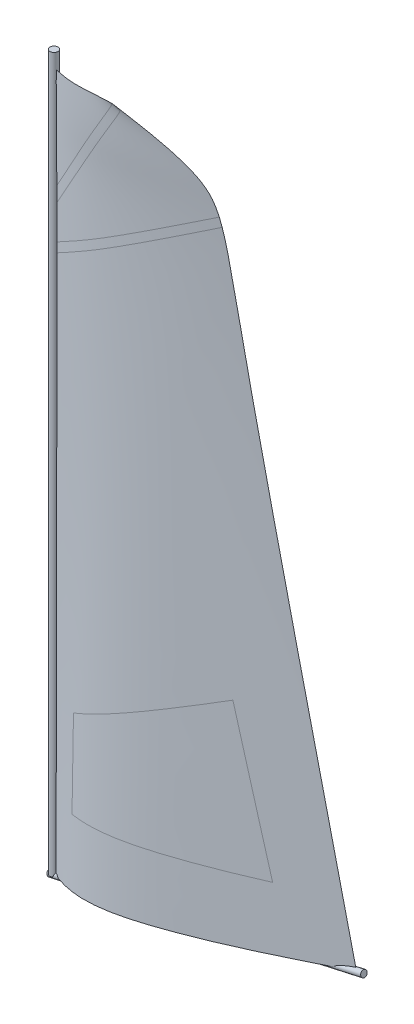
ISO-10303-21;
HEADER;
FILE_DESCRIPTION(('STEP AP214'),'2;1');
FILE_NAME('part.step','',(''),(''),'','','');
FILE_SCHEMA(('AUTOMOTIVE_DESIGN { 1 0 10303 214 1 1 1 1 }'));
ENDSEC;
DATA;
#1=APPLICATION_CONTEXT('core data for automotive mechanical design processes');
#2=APPLICATION_PROTOCOL_DEFINITION('international standard','automotive_design',2000,#1);
#3=PRODUCT_CONTEXT('',#1,'mechanical');
#4=PRODUCT('Part','Part','',(#3));
#5=PRODUCT_RELATED_PRODUCT_CATEGORY('part','',(#4));
#6=PRODUCT_DEFINITION_FORMATION('','',#4);
#7=PRODUCT_DEFINITION_CONTEXT('part definition',#1,'design');
#8=PRODUCT_DEFINITION('design','',#6,#7);
#9=PRODUCT_DEFINITION_SHAPE('','',#8);
#10=(LENGTH_UNIT() NAMED_UNIT(*) SI_UNIT(.MILLI.,.METRE.));
#11=(NAMED_UNIT(*) PLANE_ANGLE_UNIT() SI_UNIT($,.RADIAN.));
#12=(NAMED_UNIT(*) SI_UNIT($,.STERADIAN.) SOLID_ANGLE_UNIT());
#13=UNCERTAINTY_MEASURE_WITH_UNIT(LENGTH_MEASURE(1.E-05),#10,'distance_accuracy_value','');
#14=(GEOMETRIC_REPRESENTATION_CONTEXT(3) GLOBAL_UNCERTAINTY_ASSIGNED_CONTEXT((#13)) GLOBAL_UNIT_ASSIGNED_CONTEXT((#10,
#11,#12)) REPRESENTATION_CONTEXT('',''));
#15=CARTESIAN_POINT('',(0.,0.,0.));
#16=DIRECTION('',(0.,0.,1.));
#17=DIRECTION('',(1.,0.,0.));
#18=AXIS2_PLACEMENT_3D('',#15,#16,#17);
#19=CARTESIAN_POINT('',(0.,0.,0.));
#20=CARTESIAN_POINT('',(0.,1193.12373552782,0.));
#21=CARTESIAN_POINT('',(-1.34770936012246E-13,3680.8600031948,0.));
#22=CARTESIAN_POINT('',(-1.40499856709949E-13,4090.50883815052,0.));
#23=CARTESIAN_POINT('',(0.,4302.73064019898,0.));
#24=CARTESIAN_POINT('',(0.,4399.28051398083,0.));
#25=CARTESIAN_POINT('',(6.44510636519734,1.42884568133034,3.00588592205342));
#26=CARTESIAN_POINT('',(8.87782680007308,1195.09190234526,2.92197996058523));
#27=CARTESIAN_POINT('',(13.9501983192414,3683.95268770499,2.7470308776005));
#28=CARTESIAN_POINT('',(7.54226306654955,4092.18091761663,2.72850391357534));
#29=CARTESIAN_POINT('',(7.48022915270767,4304.38896707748,2.86259610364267));
#30=CARTESIAN_POINT('',(7.45200695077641,4400.93258414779,2.9236010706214));
#31=CARTESIAN_POINT('',(19.3350733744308,4.28648256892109,9.01760158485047));
#32=CARTESIAN_POINT('',(26.6354638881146,1199.02867570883,8.76683609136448));
#33=CARTESIAN_POINT('',(41.8572264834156,3690.13952689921,8.24397463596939));
#34=CARTESIAN_POINT('',(22.5998225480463,4095.5190981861,8.17396191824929));
#35=CARTESIAN_POINT('',(22.5231058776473,4307.72389255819,8.61960083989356));
#36=CARTESIAN_POINT('',(22.4882037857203,4404.26602873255,8.82234335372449));
#37=CARTESIAN_POINT('',(38.8991464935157,8.62373315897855,18.0892563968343));
#38=CARTESIAN_POINT('',(53.4496728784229,1204.97324272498,17.5366405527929));
#39=CARTESIAN_POINT('',(83.7884140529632,3699.43544738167,16.3844025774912));
#40=CARTESIAN_POINT('',(45.1254435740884,4100.51290814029,16.2487510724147));
#41=CARTESIAN_POINT('',(45.0877222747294,4312.72634757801,17.1626931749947));
#42=CARTESIAN_POINT('',(45.0705610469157,4409.27241680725,17.5784892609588));
#43=CARTESIAN_POINT('',(55.6036858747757,12.3270403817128,25.7434820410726));
#44=CARTESIAN_POINT('',(76.0969783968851,1209.99402948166,24.8492311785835));
#45=CARTESIAN_POINT('',(118.826751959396,3707.2032598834,22.9846632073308));
#46=CARTESIAN_POINT('',(63.8641617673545,4104.66718194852,22.85121412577));
#47=CARTESIAN_POINT('',(63.6863842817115,4316.84957167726,24.0484623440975));
#48=CARTESIAN_POINT('',(63.6055047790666,4413.38151490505,24.5931479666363));
#49=CARTESIAN_POINT('',(69.3658595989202,15.3780408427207,31.9604433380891));
#50=CARTESIAN_POINT('',(94.5082951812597,1214.07572014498,30.7059315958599));
#51=CARTESIAN_POINT('',(146.931817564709,3713.43400292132,28.0901975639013));
#52=CARTESIAN_POINT('',(78.8403260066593,4107.98731762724,28.0283767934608));
#53=CARTESIAN_POINT('',(78.337077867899,4320.09755224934,29.3413197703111));
#54=CARTESIAN_POINT('',(78.1081261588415,4416.59666865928,29.9386404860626));
#55=CARTESIAN_POINT('',(79.9381482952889,17.721860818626,36.6818795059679));
#56=CARTESIAN_POINT('',(108.498781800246,1217.17733635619,35.1045296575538));
#57=CARTESIAN_POINT('',(168.04945679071,3718.11567082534,31.8156583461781));
#58=CARTESIAN_POINT('',(90.0632902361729,4110.47538889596,31.849346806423));
#59=CARTESIAN_POINT('',(89.1915109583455,4322.5039221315,33.1885862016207));
#60=CARTESIAN_POINT('',(88.7948967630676,4418.96586866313,33.7978704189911));
#61=CARTESIAN_POINT('',(90.8194937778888,20.1341970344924,41.4755459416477));
#62=CARTESIAN_POINT('',(122.710601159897,1220.32802085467,39.5128826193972));
#63=CARTESIAN_POINT('',(189.20551873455,3722.80585684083,35.4206090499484));
#64=CARTESIAN_POINT('',(101.275772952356,4112.96113646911,35.5990145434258));
#65=CARTESIAN_POINT('',(99.8930227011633,4324.8763901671,36.8990088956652));
#66=CARTESIAN_POINT('',(99.2639433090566,4421.28680040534,37.490438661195));
#67=CARTESIAN_POINT('',(102.083269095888,22.6313159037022,46.3583553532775));
#68=CARTESIAN_POINT('',(137.192428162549,1223.53856460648,43.9357638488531));
#69=CARTESIAN_POINT('',(210.39718114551,3727.50393528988,38.884511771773));
#70=CARTESIAN_POINT('',(112.473770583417,4115.4436727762,39.2692206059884));
#71=CARTESIAN_POINT('',(110.430958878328,4327.21259437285,40.4651704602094));
#72=CARTESIAN_POINT('',(109.501585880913,4423.55643112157,41.0092653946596));
#73=CARTESIAN_POINT('',(113.825791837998,25.2345705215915,51.3524240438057));
#74=CARTESIAN_POINT('',(152.00626004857,1226.8227120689,48.3809680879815));
#75=CARTESIAN_POINT('',(231.614881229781,3732.20778615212,42.1852999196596));
#76=CARTESIAN_POINT('',(123.65469080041,4117.92242311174,42.8521256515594));
#77=CARTESIAN_POINT('',(120.795106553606,4329.5102705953,43.8797535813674));
#78=CARTESIAN_POINT('',(119.494144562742,4425.77172804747,44.3472708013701));
#79=CARTESIAN_POINT('',(126.169510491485,27.9711070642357,56.485793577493));
#80=CARTESIAN_POINT('',(167.229447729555,1230.19761152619,52.8598503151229));
#81=CARTESIAN_POINT('',(252.841938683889,3736.91371149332,45.2995359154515));
#82=CARTESIAN_POINT('',(134.815259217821,4120.39666156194,46.3387409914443));
#83=CARTESIAN_POINT('',(130.979851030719,4331.76817408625,47.1382631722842));
#84=CARTESIAN_POINT('',(129.23493993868,4427.93121039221,47.5020041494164));
#85=CARTESIAN_POINT('',(139.296412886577,30.8812712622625,61.800007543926));
#86=CARTESIAN_POINT('',(182.973912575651,1233.68807534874,57.3916052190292));
#87=CARTESIAN_POINT('',(274.044182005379,3741.61413567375,48.1998156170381));
#88=CARTESIAN_POINT('',(145.95586351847,4122.86647407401,49.7209084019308));
#89=CARTESIAN_POINT('',(140.980722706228,4333.98531395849,50.2364638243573));
#90=CARTESIAN_POINT('',(138.717292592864,4430.03339736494,50.4710147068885));
#91=CARTESIAN_POINT('',(153.455711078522,34.0203120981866,67.3518484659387));
#92=CARTESIAN_POINT('',(199.391441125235,1237.32775380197,62.0025542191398));
#93=CARTESIAN_POINT('',(295.170259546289,3746.29767430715,50.8489471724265));
#94=CARTESIAN_POINT('',(157.078632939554,4125.33233268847,52.9949596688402));
#95=CARTESIAN_POINT('',(150.801034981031,4336.1624247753,53.1761443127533));
#96=CARTESIAN_POINT('',(147.945054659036,4432.07914296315,53.2585738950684));
#97=CARTESIAN_POINT('',(169.084480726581,37.4851269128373,73.2407026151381));
#98=CARTESIAN_POINT('',(216.742899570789,1241.17447952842,66.7437558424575));
#99=CARTESIAN_POINT('',(316.113629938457,3750.94070774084,53.1972227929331));
#100=CARTESIAN_POINT('',(168.197251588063,4127.79727109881,56.1598469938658));
#101=CARTESIAN_POINT('',(160.447714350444,4338.30104210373,55.9599127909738));
#102=CARTESIAN_POINT('',(156.922078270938,4434.06930118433,55.8689531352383));
#103=CARTESIAN_POINT('',(180.953552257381,40.1164367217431,77.4980960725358));
#104=CARTESIAN_POINT('',(229.210921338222,1243.93857340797,70.0489801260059));
#105=CARTESIAN_POINT('',(329.830499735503,3753.98166456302,54.5171158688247));
#106=CARTESIAN_POINT('',(175.627020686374,4129.44441125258,58.198791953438));
#107=CARTESIAN_POINT('',(166.771136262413,4339.70291099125,57.7143358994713));
#108=CARTESIAN_POINT('',(162.74216979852,4435.35958441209,57.4939336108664));
#109=CARTESIAN_POINT('',(207.597021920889,46.023151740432,86.7130804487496));
#110=CARTESIAN_POINT('',(256.034629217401,1249.88524627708,77.0332868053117));
#111=CARTESIAN_POINT('',(357.030015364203,3760.01165200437,56.850322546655));
#112=CARTESIAN_POINT('',(190.74789483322,4132.79662834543,62.2659938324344));
#113=CARTESIAN_POINT('',(179.485039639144,4342.52151551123,61.16900283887));
#114=CARTESIAN_POINT('',(174.361026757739,4437.93542298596,60.6699290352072));
#115=CARTESIAN_POINT('',(249.317023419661,55.2722533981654,99.6659580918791));
#116=CARTESIAN_POINT('',(297.859945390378,1259.15769563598,86.8055153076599));
#117=CARTESIAN_POINT('',(399.074919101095,3769.33278275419,59.9907022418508));
#118=CARTESIAN_POINT('',(212.134404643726,4137.53790342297,67.643783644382));
#119=CARTESIAN_POINT('',(198.271294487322,4346.68632794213,65.9400764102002));
#120=CARTESIAN_POINT('',(191.964300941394,4441.83797491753,65.1649782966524));
#121=CARTESIAN_POINT('',(316.823507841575,70.2380806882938,115.966716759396));
#122=CARTESIAN_POINT('',(364.535084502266,1273.93921810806,98.9023379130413));
#123=CARTESIAN_POINT('',(464.016652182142,3783.73001836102,63.3220599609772));
#124=CARTESIAN_POINT('',(242.049610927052,4144.16994498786,74.2817286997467));
#125=CARTESIAN_POINT('',(225.507797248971,4352.72451523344,72.0591177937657));
#126=CARTESIAN_POINT('',(217.982133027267,4447.60598942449,71.0479455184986));
#127=CARTESIAN_POINT('',(389.333298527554,86.3131142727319,128.850143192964));
#128=CARTESIAN_POINT('',(434.711003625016,1289.49684482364,108.222684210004));
#129=CARTESIAN_POINT('',(529.32630575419,3798.20881997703,65.213165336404));
#130=CARTESIAN_POINT('',(271.309161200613,4150.65663111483,79.9216142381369));
#131=CARTESIAN_POINT('',(251.876050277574,4358.57021619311,77.3346172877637));
#132=CARTESIAN_POINT('',(243.034996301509,4453.16007549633,76.157668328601));
#133=CARTESIAN_POINT('',(466.82291114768,103.492147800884,138.119088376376));
#134=CARTESIAN_POINT('',(507.856516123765,1305.71281454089,114.666267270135));
#135=CARTESIAN_POINT('',(593.414102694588,3812.41674249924,65.7656948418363));
#136=CARTESIAN_POINT('',(301.20898889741,4157.28526332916,84.8034506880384));
#137=CARTESIAN_POINT('',(277.531732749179,4364.25794406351,81.9303993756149));
#138=CARTESIAN_POINT('',(266.759813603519,4458.41974086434,80.6233105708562));
#139=CARTESIAN_POINT('',(549.11436704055,121.73572435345,143.70398689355));
#140=CARTESIAN_POINT('',(583.351610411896,1322.4496740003,118.260953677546));
#141=CARTESIAN_POINT('',(654.738365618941,3826.01200428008,65.2106667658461));
#142=CARTESIAN_POINT('',(332.970550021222,4164.32663190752,89.0405417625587));
#143=CARTESIAN_POINT('',(302.746223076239,4369.8478619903,85.9765330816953));
#144=CARTESIAN_POINT('',(288.995727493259,4463.34932429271,84.5825686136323));
#145=CARTESIAN_POINT('',(635.802458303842,140.954011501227,145.705524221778));
#146=CARTESIAN_POINT('',(660.491017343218,1339.55106879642,119.170821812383));
#147=CARTESIAN_POINT('',(711.968179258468,3838.69954850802,63.8443375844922));
#148=CARTESIAN_POINT('',(367.832031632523,4172.05523631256,92.6817663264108));
#149=CARTESIAN_POINT('',(327.896900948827,4375.42363303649,89.5729480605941));
#150=CARTESIAN_POINT('',(309.728495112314,4467.94566821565,88.1585975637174));
#151=CARTESIAN_POINT('',(726.177623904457,160.989703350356,144.443354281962));
#152=CARTESIAN_POINT('',(738.448672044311,1356.83386475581,117.705283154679));
#153=CARTESIAN_POINT('',(764.03456107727,3850.24238746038,61.9547626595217));
#154=CARTESIAN_POINT('',(407.381203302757,4180.82307658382,95.7431155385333));
#155=CARTESIAN_POINT('',(353.528735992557,4381.10607405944,92.793907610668));
#156=CARTESIAN_POINT('',(329.02866638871,4472.22441317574,91.452171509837));
#157=CARTESIAN_POINT('',(788.180471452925,174.735403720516,141.807890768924));
#158=CARTESIAN_POINT('',(790.311003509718,1368.33146683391,115.449349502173));
#159=CARTESIAN_POINT('',(794.753293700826,3857.05256652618,60.4901720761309));
#160=CARTESIAN_POINT('',(438.348967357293,4187.68846458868,97.4038676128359));
#161=CARTESIAN_POINT('',(371.449942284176,4385.07910984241,94.7288241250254));
#162=CARTESIAN_POINT('',(341.014367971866,4474.88157924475,93.5118185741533));
#163=CARTESIAN_POINT('',(860.344799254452,190.73385002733,138.042529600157));
#164=CARTESIAN_POINT('',(849.71263379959,1381.50049122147,112.330425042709));
#165=CARTESIAN_POINT('',(827.543915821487,3864.32207243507,58.7191078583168));
#166=CARTESIAN_POINT('',(478.628639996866,4196.61825302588,99.1101924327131));
#167=CARTESIAN_POINT('',(393.250776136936,4389.91223834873,96.8604481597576));
#168=CARTESIAN_POINT('',(354.408292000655,4477.85094071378,95.8369316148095));
#169=CARTESIAN_POINT('',(943.6738050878,209.207445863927,132.668824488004));
#170=CARTESIAN_POINT('',(917.405639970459,1396.5076693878,108.012877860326));
#171=CARTESIAN_POINT('',(862.634902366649,3872.101556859,56.6037148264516));
#172=CARTESIAN_POINT('',(526.405215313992,4207.21006477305,100.565461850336));
#173=CARTESIAN_POINT('',(417.872645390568,4395.37077534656,99.0197960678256));
#174=CARTESIAN_POINT('',(368.495975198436,4480.97410488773,98.3165985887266));
#175=CARTESIAN_POINT('',(1072.7513583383,237.823250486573,121.316600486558));
#176=CARTESIAN_POINT('',(1019.95248643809,1419.24175792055,99.3276968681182));
#177=CARTESIAN_POINT('',(909.86359573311,3882.57190610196,53.4794823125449));
#178=CARTESIAN_POINT('',(603.573800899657,4224.31792832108,101.146135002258));
#179=CARTESIAN_POINT('',(455.156096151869,4403.63631738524,101.561992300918));
#180=CARTESIAN_POINT('',(387.633765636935,4485.21685088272,101.751185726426));
#181=CARTESIAN_POINT('',(1205.60043717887,267.275182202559,106.792165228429));
#182=CARTESIAN_POINT('',(1123.56589994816,1442.21229867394,88.5934809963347));
#183=CARTESIAN_POINT('',(952.518851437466,3892.02834862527,50.6481066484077));
#184=CARTESIAN_POINT('',(685.663833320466,4242.516850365,100.073199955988));
#185=CARTESIAN_POINT('',(493.109522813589,4412.05038950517,103.462997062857));
#186=CARTESIAN_POINT('',(405.507333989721,4489.17932558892,105.005178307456));
#187=CARTESIAN_POINT('',(1341.77368616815,297.464064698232,89.3431323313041));
#188=CARTESIAN_POINT('',(1228.19163673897,1465.40726609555,76.0202587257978));
#189=CARTESIAN_POINT('',(991.36608771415,3900.64057356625,48.2412489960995));
#190=CARTESIAN_POINT('',(772.075658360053,4261.67389076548,97.4045923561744));
#191=CARTESIAN_POINT('',(531.776405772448,4420.62263107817,104.773938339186));
#192=CARTESIAN_POINT('',(422.4527534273,4492.93603463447,108.126607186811));
#193=CARTESIAN_POINT('',(1480.68102289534,328.259079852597,69.3571013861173));
#194=CARTESIAN_POINT('',(1333.69087257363,1488.79588359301,61.8852206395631));
#195=CARTESIAN_POINT('',(1027.20738133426,3908.58639706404,46.3058903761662));
#196=CARTESIAN_POINT('',(862.024769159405,4281.61512853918,93.2962220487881));
#197=CARTESIAN_POINT('',(571.142423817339,4429.34986716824,105.576579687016));
#198=CARTESIAN_POINT('',(438.806097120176,4496.56148364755,111.163503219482));
#199=CARTESIAN_POINT('',(1621.59705496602,359.499412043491,47.3592306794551));
#200=CARTESIAN_POINT('',(1439.82976636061,1512.3263098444,46.5253971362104));
#201=CARTESIAN_POINT('',(1060.83380586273,3916.04119590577,44.7868029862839));
#202=CARTESIAN_POINT('',(954.601053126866,4302.1387965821,88.0167791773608));
#203=CARTESIAN_POINT('',(611.037535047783,4438.19440039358,105.971293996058));
#204=CARTESIAN_POINT('',(454.734016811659,4500.09261843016,114.139663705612));
#205=CARTESIAN_POINT('',(1763.68605661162,390.999785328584,23.9924735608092));
#206=CARTESIAN_POINT('',(1546.32332424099,1535.93536323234,30.3399455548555));
#207=CARTESIAN_POINT('',(1093.1086772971,3923.19636264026,43.574814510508));
#208=CARTESIAN_POINT('',(1048.72452966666,4323.00546896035,81.9213840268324));
#209=CARTESIAN_POINT('',(651.238581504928,4447.10675782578,106.085480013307));
#210=CARTESIAN_POINT('',(470.403164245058,4503.56638478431,117.078885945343));
#211=CARTESIAN_POINT('',(1858.59065776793,412.039628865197,7.98525827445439));
#212=CARTESIAN_POINT('',(1617.33377092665,1551.67800025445,19.289449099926));
#213=CARTESIAN_POINT('',(1114.29834438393,3927.89399873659,42.8593812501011));
#214=CARTESIAN_POINT('',(1111.72582068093,4336.97251891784,77.5953652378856));
#215=CARTESIAN_POINT('',(678.05975446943,4453.05286871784,106.071208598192));
#216=CARTESIAN_POINT('',(480.764266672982,4505.86338589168,119.02623515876));
#217=CARTESIAN_POINT('',(1905.9347460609,422.535560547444,-1.67681018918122E-13));
#218=CARTESIAN_POINT('',(1652.78629988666,1559.53763670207,13.7743003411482));
#219=CARTESIAN_POINT('',(1124.95624178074,3930.25679770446,42.4945625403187));
#220=CARTESIAN_POINT('',(1143.09188961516,4343.92620898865,75.4405569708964));
#221=CARTESIAN_POINT('',(691.428693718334,4456.01669119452,106.066699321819));
#222=CARTESIAN_POINT('',(485.94544866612,4507.01202628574,120.));
#223=B_SPLINE_SURFACE_WITH_KNOTS('',3,3,((#19,#20,#21,#22,#23,#24),(#25,#26,#27,#28,#29,#30),
(#31,#32,#33,#34,#35,#36),(#37,#38,#39,#40,#41,#42),(#43,#44,#45,#46,#47,#48),(#49,#50,#51,#52,
#53,#54),(#55,#56,#57,#58,#59,#60),(#61,#62,#63,#64,#65,#66),(#67,#68,#69,#70,#71,#72),(#73,#74,
#75,#76,#77,#78),(#79,#80,#81,#82,#83,#84),(#85,#86,#87,#88,#89,#90),(#91,#92,#93,#94,#95,#96),
(#97,#98,#99,#100,#101,#102),(#103,#104,#105,#106,#107,#108),(#109,#110,#111,#112,#113,#114),
(#115,#116,#117,#118,#119,#120),(#121,#122,#123,#124,#125,#126),(#127,#128,#129,#130,#131,#132),
(#133,#134,#135,#136,#137,#138),(#139,#140,#141,#142,#143,#144),(#145,#146,#147,#148,#149,#150),
(#151,#152,#153,#154,#155,#156),(#157,#158,#159,#160,#161,#162),(#163,#164,#165,#166,#167,#168),
(#169,#170,#171,#172,#173,#174),(#175,#176,#177,#178,#179,#180),(#181,#182,#183,#184,#185,#186),
(#187,#188,#189,#190,#191,#192),(#193,#194,#195,#196,#197,#198),(#199,#200,#201,#202,#203,#204),
(#205,#206,#207,#208,#209,#210),(#211,#212,#213,#214,#215,#216),(#217,#218,#219,#220,#221,
#222)),.UNSPECIFIED.,.F.,.F.,.F.,(4,1,1,1,1,1,1,1,1,1,1,1,1,2,1,1,1,1,1,1,1,2,1,1,1,1,1,1,1,4),
(4,1,1,4),(0.,0.0276258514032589,0.0552517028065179,0.0828775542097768,0.0966904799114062,
0.110503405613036,0.124316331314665,0.138129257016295,0.151942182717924,0.165755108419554,
0.179568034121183,0.193380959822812,0.207193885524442,0.221006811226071,0.263122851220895,
0.305238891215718,0.347354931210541,0.389470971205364,0.431587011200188,0.473703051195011,
0.515819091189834,0.557935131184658,0.613193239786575,0.668451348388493,0.723709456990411,
0.778967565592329,0.834225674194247,0.889483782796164,0.944741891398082,1.),(0.,
0.334364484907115,0.697170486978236,1.),.UNSPECIFIED.);
#224=CARTESIAN_POINT('',(1905.9347460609,422.535560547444,-1.67681018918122E-13));
#225=CARTESIAN_POINT('',(1652.78629988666,1559.53763670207,13.7743003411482));
#226=CARTESIAN_POINT('',(1124.95624178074,3930.25679770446,42.4945625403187));
#227=CARTESIAN_POINT('',(1143.09188961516,4343.92620898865,75.4405569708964));
#228=CARTESIAN_POINT('',(691.428693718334,4456.01669119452,106.066699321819));
#229=CARTESIAN_POINT('',(485.94544866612,4507.01202628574,120.));
#230=B_SPLINE_CURVE_WITH_KNOTS('',3,(#224,#225,#226,#227,#228,#229),.UNSPECIFIED.,.F.,.F.,(4,1,
1,4),(0.,0.334364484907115,0.697170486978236,1.),.UNSPECIFIED.);
#231=CARTESIAN_POINT('',(1905.9347460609,422.535560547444,-1.67681018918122E-13));
#232=VERTEX_POINT('',#231);
#233=CARTESIAN_POINT('',(1122.08047694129,4120.3424320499,62.2986356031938));
#234=VERTEX_POINT('',#233);
#235=EDGE_CURVE('E214',#232,#234,#230,.T.);
#236=CARTESIAN_POINT('',(1122.08047694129,4120.3424320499,62.2986356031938));
#237=CARTESIAN_POINT('',(1117.1356919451,4117.11649790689,62.5329226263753));
#238=CARTESIAN_POINT('',(1112.19095729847,4113.89059661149,62.7687164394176));
#239=CARTESIAN_POINT('',(1102.30156394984,4107.4388435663,63.2425523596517));
#240=CARTESIAN_POINT('',(1097.35690524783,4104.2129918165,63.4805944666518));
#241=CARTESIAN_POINT('',(1082.52250128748,4094.53515743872,64.1969696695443));
#242=CARTESIAN_POINT('',(1072.63283155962,4088.08322408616,64.6775276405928));
#243=CARTESIAN_POINT('',(1052.85311219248,4075.17910953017,65.638853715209));
#244=CARTESIAN_POINT('',(1042.96306255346,4068.72692832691,66.119621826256));
#245=CARTESIAN_POINT('',(1023.18252228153,4055.82227821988,67.0761430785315));
#246=CARTESIAN_POINT('',(1013.29203164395,4049.36980931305,67.5518960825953));
#247=CARTESIAN_POINT('',(993.510556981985,4036.46454961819,68.4934122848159));
#248=CARTESIAN_POINT('',(983.619572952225,4030.01175882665,68.9591753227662));
#249=CARTESIAN_POINT('',(963.837069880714,4017.10582820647,69.8760592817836));
#250=CARTESIAN_POINT('',(953.945550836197,4010.65268837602,70.3271801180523));
#251=CARTESIAN_POINT('',(934.132848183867,3997.72705581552,71.2115519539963));
#252=CARTESIAN_POINT('',(924.211662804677,3991.25456192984,71.6447465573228));
#253=CARTESIAN_POINT('',(904.368710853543,3978.30919499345,72.4880268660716));
#254=CARTESIAN_POINT('',(894.446944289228,3971.83632194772,72.8981128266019));
#255=CARTESIAN_POINT('',(874.602815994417,3958.89018757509,73.6913350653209));
#256=CARTESIAN_POINT('',(864.680454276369,3952.41692625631,74.0744717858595));
#257=CARTESIAN_POINT('',(844.835122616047,3939.47000681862,74.8099504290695));
#258=CARTESIAN_POINT('',(834.912152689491,3932.99634870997,75.1622929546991));
#259=CARTESIAN_POINT('',(815.065587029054,3920.04862422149,75.8323031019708));
#260=CARTESIAN_POINT('',(805.141991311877,3913.57455785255,76.1499714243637));
#261=CARTESIAN_POINT('',(790.256079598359,3903.86312027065,76.5975837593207));
#262=CARTESIAN_POINT('',(785.294066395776,3900.62594659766,76.7419717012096));
#263=CARTESIAN_POINT('',(775.369840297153,3894.15146897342,77.0206401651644));
#264=CARTESIAN_POINT('',(770.407627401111,3890.91416502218,77.1549206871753));
#265=CARTESIAN_POINT('',(760.132201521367,3884.21056775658,77.4219582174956));
#266=CARTESIAN_POINT('',(754.81897431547,3880.7442651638,77.5539364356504));
#267=CARTESIAN_POINT('',(744.192305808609,3873.81152030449,77.8050273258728));
#268=CARTESIAN_POINT('',(738.878864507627,3870.34507803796,77.9241399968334));
#269=CARTESIAN_POINT('',(728.251773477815,3863.41205752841,78.1488527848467));
#270=CARTESIAN_POINT('',(722.93812374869,3859.94547928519,78.2544528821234));
#271=CARTESIAN_POINT('',(712.310639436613,3853.01220220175,78.4514637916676));
#272=CARTESIAN_POINT('',(706.996804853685,3849.54550336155,78.5428746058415));
#273=CARTESIAN_POINT('',(699.025867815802,3844.34533430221,78.6687662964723));
#274=CARTESIAN_POINT('',(696.368826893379,3842.61190422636,78.7088598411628));
#275=CARTESIAN_POINT('',(691.05470626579,3839.14501877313,78.785212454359));
#276=CARTESIAN_POINT('',(688.397626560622,3837.41156339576,78.8214715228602));
#277=CARTESIAN_POINT('',(683.08343131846,3833.94462926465,78.8900629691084));
#278=CARTESIAN_POINT('',(680.426315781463,3832.21115051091,78.9223953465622));
#279=CARTESIAN_POINT('',(676.440618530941,3829.61091675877,78.9678798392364));
#280=CARTESIAN_POINT('',(675.112048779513,3828.74416956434,78.9825389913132));
#281=CARTESIAN_POINT('',(672.454901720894,3827.01067024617,79.0108437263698));
#282=CARTESIAN_POINT('',(671.126324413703,3826.14391812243,79.0244893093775));
#283=CARTESIAN_POINT('',(668.469097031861,3824.4103664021,79.0507475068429));
#284=CARTESIAN_POINT('',(667.140446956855,3823.54356680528,79.0633600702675));
#285=CARTESIAN_POINT('',(665.147467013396,3822.24336425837,79.0815210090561));
#286=CARTESIAN_POINT('',(664.483139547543,3821.80996287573,79.0874483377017));
#287=CARTESIAN_POINT('',(663.154483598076,3820.94315944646,79.0991390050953));
#288=CARTESIAN_POINT('',(662.490155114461,3820.50975739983,79.1049023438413));
#289=CARTESIAN_POINT('',(660.497167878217,3819.20955009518,79.1219118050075));
#290=CARTESIAN_POINT('',(659.168507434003,3818.34274373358,79.1328773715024));
#291=CARTESIAN_POINT('',(656.511182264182,3816.60912821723,79.1540392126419));
#292=CARTESIAN_POINT('',(655.182517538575,3815.74231906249,79.1642354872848));
#293=CARTESIAN_POINT('',(651.196516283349,3813.14188698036,79.1936126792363));
#294=CARTESIAN_POINT('',(648.539173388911,3811.40825990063,79.2115819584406));
#295=CARTESIAN_POINT('',(643.224472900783,3807.9409961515,79.2440255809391));
#296=CARTESIAN_POINT('',(640.567115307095,3806.20735948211,79.2584999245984));
#297=CARTESIAN_POINT('',(635.252182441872,3802.73994413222,79.2837053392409));
#298=CARTESIAN_POINT('',(632.594607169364,3801.00616545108,79.2944361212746));
#299=CARTESIAN_POINT('',(627.27944747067,3797.53860211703,79.3119217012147));
#300=CARTESIAN_POINT('',(624.621863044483,3795.80481746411,79.3186764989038));
#301=CARTESIAN_POINT('',(616.649103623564,3790.60345949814,79.3326674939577));
#302=CARTESIAN_POINT('',(611.333919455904,3787.13588020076,79.3336303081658));
#303=CARTESIAN_POINT('',(600.702938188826,3780.2003217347,79.3166587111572));
#304=CARTESIAN_POINT('',(595.387141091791,3776.73234256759,79.2987220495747));
#305=CARTESIAN_POINT('',(584.755622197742,3769.79643335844,79.2419766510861));
#306=CARTESIAN_POINT('',(579.439900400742,3766.32850331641,79.2031679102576));
#307=CARTESIAN_POINT('',(568.818610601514,3759.39926747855,79.1029455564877));
#308=CARTESIAN_POINT('',(563.513042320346,3755.93796150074,79.0415746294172));
#309=CARTESIAN_POINT('',(552.902144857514,3749.01550553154,78.8941271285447));
#310=CARTESIAN_POINT('',(547.596815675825,3745.55435554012,78.8080505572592));
#311=CARTESIAN_POINT('',(536.986415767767,3738.63222417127,78.6092683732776));
#312=CARTESIAN_POINT('',(531.681345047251,3735.17124279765,78.4965623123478));
#313=CARTESIAN_POINT('',(521.071678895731,3728.24959012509,78.2426795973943));
#314=CARTESIAN_POINT('',(515.767083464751,3724.78891882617,78.1015029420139));
#315=CARTESIAN_POINT('',(505.158921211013,3717.86824728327,77.7888115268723));
#316=CARTESIAN_POINT('',(499.855354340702,3714.40824700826,77.6172990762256));
#317=CARTESIAN_POINT('',(489.249016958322,3707.48876599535,77.2420840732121));
#318=CARTESIAN_POINT('',(483.946246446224,3704.02928525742,77.0383815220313));
#319=CARTESIAN_POINT('',(473.342412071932,3697.11143718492,76.5970185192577));
#320=CARTESIAN_POINT('',(468.041348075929,3693.65306976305,76.3593626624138));
#321=CARTESIAN_POINT('',(457.440419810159,3686.73711761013,75.8484832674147));
#322=CARTESIAN_POINT('',(452.140555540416,3683.27953287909,75.5752597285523));
#323=CARTESIAN_POINT('',(441.543105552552,3676.36584992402,74.9916312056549));
#324=CARTESIAN_POINT('',(436.245519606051,3672.90975155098,74.681232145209));
#325=CARTESIAN_POINT('',(425.652045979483,3665.99866273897,74.0214951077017));
#326=CARTESIAN_POINT('',(420.356158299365,3662.54367229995,73.6721571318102));
#327=CARTESIAN_POINT('',(409.767137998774,3655.63548879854,72.9332179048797));
#328=CARTESIAN_POINT('',(404.474005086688,3652.18229554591,72.5436226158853));
#329=CARTESIAN_POINT('',(393.890004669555,3645.27738697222,71.7226689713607));
#330=CARTESIAN_POINT('',(388.599137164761,3641.82567165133,71.2913106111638));
#331=CARTESIAN_POINT('',(379.734265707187,3636.04230765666,70.5320436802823));
#332=CARTESIAN_POINT('',(376.159551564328,3633.71019566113,70.2159140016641));
#333=CARTESIAN_POINT('',(369.011416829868,3629.0468155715,69.5634174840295));
#334=CARTESIAN_POINT('',(365.437996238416,3626.7155474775,69.227050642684));
#335=CARTESIAN_POINT('',(358.292557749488,3622.0539263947,68.5337093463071));
#336=CARTESIAN_POINT('',(354.720539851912,3619.72357340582,68.1767348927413));
#337=CARTESIAN_POINT('',(347.577787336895,3615.06370462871,67.4417462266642));
#338=CARTESIAN_POINT('',(344.007052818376,3612.73418890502,67.0637306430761));
#339=CARTESIAN_POINT('',(336.867220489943,3608.0762252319,66.2862564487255));
#340=CARTESIAN_POINT('',(333.29812268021,3605.74777728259,65.8867978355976));
#341=CARTESIAN_POINT('',(326.161692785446,3601.0920333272,65.0659741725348));
#342=CARTESIAN_POINT('',(322.594360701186,3598.76473732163,64.6446091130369));
#343=CARTESIAN_POINT('',(315.461287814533,3594.11118344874,63.779531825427));
#344=CARTESIAN_POINT('',(311.895547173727,3591.78492568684,63.3358176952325));
#345=CARTESIAN_POINT('',(306.548463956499,3588.29653573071,62.6532189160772));
#346=CARTESIAN_POINT('',(304.766356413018,3587.1339044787,62.4228479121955));
#347=CARTESIAN_POINT('',(301.202666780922,3584.80898477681,61.9563794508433));
#348=CARTESIAN_POINT('',(299.421084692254,3583.64669632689,61.7202819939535));
#349=CARTESIAN_POINT('',(295.858463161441,3581.32247344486,61.242309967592));
#350=CARTESIAN_POINT('',(294.077423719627,3580.16053901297,61.000435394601));
#351=CARTESIAN_POINT('',(290.51590642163,3577.83703652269,60.5108580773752));
#352=CARTESIAN_POINT('',(288.735428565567,3576.67546846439,60.2631553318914));
#353=CARTESIAN_POINT('',(285.174771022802,3574.35252687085,59.7618288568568));
#354=CARTESIAN_POINT('',(283.394591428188,3573.19115339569,59.5082041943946));
#355=CARTESIAN_POINT('',(280.724772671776,3571.44938717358,59.1233176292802));
#356=CARTESIAN_POINT('',(279.834908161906,3570.86884741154,58.9942805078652));
#357=CARTESIAN_POINT('',(278.055331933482,3569.70786756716,58.7347120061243));
#358=CARTESIAN_POINT('',(277.165620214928,3569.12742748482,58.6041806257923));
#359=CARTESIAN_POINT('',(275.831168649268,3568.25684304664,58.4072709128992));
#360=CARTESIAN_POINT('',(275.386371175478,3567.96666109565,58.3414489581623));
#361=CARTESIAN_POINT('',(274.496826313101,3567.38632986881,58.2093243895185));
#362=CARTESIAN_POINT('',(274.052078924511,3567.09618059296,58.1430217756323));
#363=CARTESIAN_POINT('',(272.71790947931,3566.22578020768,57.9434218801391));
#364=CARTESIAN_POINT('',(271.828559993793,3565.64557644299,57.8094325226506));
#365=CARTESIAN_POINT('',(270.050053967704,3564.48529478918,57.5396426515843));
#366=CARTESIAN_POINT('',(269.160897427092,3563.90521690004,57.4038421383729));
#367=CARTESIAN_POINT('',(267.382774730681,3562.74518532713,57.1304756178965));
#368=CARTESIAN_POINT('',(266.493808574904,3562.16523164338,56.9929096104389));
#369=CARTESIAN_POINT('',(263.8271964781,3560.42555741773,56.5776243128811));
#370=CARTESIAN_POINT('',(262.049832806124,3559.26602102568,56.2973171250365));
#371=CARTESIAN_POINT('',(258.49584289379,3556.94742933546,55.7301162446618));
#372=CARTESIAN_POINT('',(256.719216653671,3555.78837403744,55.4432225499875));
#373=CARTESIAN_POINT('',(253.166209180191,3553.47042328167,54.8630192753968));
#374=CARTESIAN_POINT('',(251.389828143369,3552.31152795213,54.5697079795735));
#375=CARTESIAN_POINT('',(247.837783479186,3549.99420532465,53.9769648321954));
#376=CARTESIAN_POINT('',(246.062119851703,3548.83577802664,53.6775329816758));
#377=CARTESIAN_POINT('',(240.736172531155,3545.36117694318,52.7703832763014));
#378=CARTESIAN_POINT('',(237.186944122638,3543.04569161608,52.1538131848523));
#379=CARTESIAN_POINT('',(230.091222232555,3538.4165052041,50.8986293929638));
#380=CARTESIAN_POINT('',(226.544728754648,3536.10280412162,50.2600156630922));
#381=CARTESIAN_POINT('',(219.45343935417,3531.47650942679,48.9620158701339));
#382=CARTESIAN_POINT('',(215.908644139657,3529.16391627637,48.3026242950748));
#383=CARTESIAN_POINT('',(208.821611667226,3524.54039876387,46.9646121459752));
#384=CARTESIAN_POINT('',(205.279374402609,3522.22947439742,46.28599162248));
#385=CARTESIAN_POINT('',(198.197354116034,3517.60922679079,44.9107610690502));
#386=CARTESIAN_POINT('',(194.657571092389,3515.29990354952,44.2141510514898));
#387=CARTESIAN_POINT('',(187.563135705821,3510.67155644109,42.8006023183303));
#388=CARTESIAN_POINT('',(184.008494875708,3508.35254009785,42.0835811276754));
#389=CARTESIAN_POINT('',(176.901495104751,3503.7159960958,40.6335900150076));
#390=CARTESIAN_POINT('',(173.349136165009,3501.39846843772,39.9006200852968));
#391=CARTESIAN_POINT('',(166.246591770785,3496.76483108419,38.4198222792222));
#392=CARTESIAN_POINT('',(162.696406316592,3494.44872138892,37.6719944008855));
#393=CARTESIAN_POINT('',(155.597943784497,3489.81774700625,36.1625247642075));
#394=CARTESIAN_POINT('',(152.049666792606,3487.50288237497,35.4008824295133));
#395=CARTESIAN_POINT('',(144.955045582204,3482.87441403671,33.864886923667));
#396=CARTESIAN_POINT('',(141.4087013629,3480.56081032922,33.090533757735));
#397=CARTESIAN_POINT('',(134.317810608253,3475.93477570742,31.530188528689));
#398=CARTESIAN_POINT('',(130.773264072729,3473.62234479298,30.7441964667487));
#399=CARTESIAN_POINT('',(123.686229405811,3468.99882584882,29.1616217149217));
#400=CARTESIAN_POINT('',(120.143741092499,3466.68773770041,28.3650401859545));
#401=CARTESIAN_POINT('',(113.060307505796,3462.06656806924,26.7621624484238));
#402=CARTESIAN_POINT('',(109.519362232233,3459.75648658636,25.955866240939));
#403=CARTESIAN_POINT('',(102.438878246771,3455.13724124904,24.3345205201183));
#404=CARTESIAN_POINT('',(98.8993395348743,3452.82807739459,23.5194710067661));
#405=CARTESIAN_POINT('',(91.8226213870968,3448.21128885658,21.8818217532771));
#406=CARTESIAN_POINT('',(88.2854415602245,3445.90366391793,21.0592244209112));
#407=CARTESIAN_POINT('',(81.2122056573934,3441.28914716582,19.4071768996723));
#408=CARTESIAN_POINT('',(77.6761495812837,3438.98225535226,18.577726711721));
#409=CARTESIAN_POINT('',(70.6050116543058,3434.36910730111,16.912929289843));
#410=CARTESIAN_POINT('',(67.0699298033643,3432.06285106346,16.07758205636));
#411=CARTESIAN_POINT('',(52.9370119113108,3422.84266001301,12.727597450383));
#412=CARTESIAN_POINT('',(42.3424893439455,3415.93088688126,10.1930667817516));
#413=CARTESIAN_POINT('',(21.1653854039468,3402.11513094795,5.10517481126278));
#414=CARTESIAN_POINT('',(10.5828012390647,3395.21114632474,2.55183010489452));
#415=CARTESIAN_POINT('',(-1.21545318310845E-13,3388.30702008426,0.));
#416=B_SPLINE_CURVE_WITH_KNOTS('',3,(#236,#237,#238,#239,#240,#241,#242,#243,#244,#245,#246,
#247,#248,#249,#250,#251,#252,#253,#254,#255,#256,#257,#258,#259,#260,#261,#262,#263,#264,#265,
#266,#267,#268,#269,#270,#271,#272,#273,#274,#275,#276,#277,#278,#279,#280,#281,#282,#283,#284,
#285,#286,#287,#288,#289,#290,#291,#292,#293,#294,#295,#296,#297,#298,#299,#300,#301,#302,#303,
#304,#305,#306,#307,#308,#309,#310,#311,#312,#313,#314,#315,#316,#317,#318,#319,#320,#321,#322,
#323,#324,#325,#326,#327,#328,#329,#330,#331,#332,#333,#334,#335,#336,#337,#338,#339,#340,#341,
#342,#343,#344,#345,#346,#347,#348,#349,#350,#351,#352,#353,#354,#355,#356,#357,#358,#359,#360,
#361,#362,#363,#364,#365,#366,#367,#368,#369,#370,#371,#372,#373,#374,#375,#376,#377,#378,#379,
#380,#381,#382,#383,#384,#385,#386,#387,#388,#389,#390,#391,#392,#393,#394,#395,#396,#397,#398,
#399,#400,#401,#402,#403,#404,#405,#406,#407,#408,#409,#410,#411,#412,#413,#414,#415),
.UNSPECIFIED.,.F.,.F.,(4,2,2,2,2,2,2,2,2,2,2,2,2,2,2,2,2,2,2,2,2,2,2,2,2,2,2,2,2,2,2,2,2,2,2,2,
2,2,2,2,2,2,2,2,2,2,2,2,2,2,2,2,2,2,2,2,2,2,2,2,2,2,2,2,2,2,2,2,2,2,2,2,2,2,2,2,2,2,2,2,2,2,2,2,
2,2,2,2,2,4),(0.,17.7260243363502,35.4520471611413,70.9058973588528,106.361133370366,
141.817336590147,177.27410798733,212.731084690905,248.292235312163,283.852993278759,
319.413167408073,354.972645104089,390.531404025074,408.310470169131,426.089536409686,
445.125476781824,464.161418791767,483.197388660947,502.233355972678,511.751562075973,
521.269768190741,530.787975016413,535.547078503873,540.306181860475,545.065520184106,
547.445189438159,549.824858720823,554.584197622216,559.343536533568,568.862216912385,
578.380896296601,587.900310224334,597.419724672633,616.458542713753,635.499627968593,
654.540716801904,673.545965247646,692.551211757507,711.556778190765,730.562345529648,
749.566466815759,768.570587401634,787.572138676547,806.573690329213,825.572218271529,
844.570745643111,863.566463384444,882.562183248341,895.401742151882,908.241302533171,
921.080862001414,933.921259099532,946.76165761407,959.60206173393,972.443560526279,
978.864317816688,985.285074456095,991.705835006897,998.126596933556,1004.54837727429,
1007.75926766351,1010.97015806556,1012.57560052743,1014.18104292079,1017.39192716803,
1020.60281076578,1023.81369471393,1030.23544780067,1036.65720297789,1043.08069667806,
1049.504189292,1062.35121690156,1075.19826166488,1088.04874368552,1100.89919193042,
1113.7496313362,1126.66264832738,1139.57567155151,1152.48869649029,1165.40226141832,
1178.31582104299,1191.22937936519,1204.14153346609,1217.05368613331,1229.96583882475,
1242.87400658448,1255.78217260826,1268.69033766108,1307.39383179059,1346.06651728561),.UNSPECIFIED.);
#417=CARTESIAN_POINT('',(-1.16660739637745E-13,3388.30702008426,0.));
#418=VERTEX_POINT('',#417);
#419=EDGE_CURVE('E281',#234,#418,#416,.T.);
#420=DIRECTION('',(0.,-1.,0.));
#421=VECTOR('',#420,1.);
#422=CARTESIAN_POINT('',(-1.30831325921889E-13,3775.33367299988,0.));
#423=LINE('',#422,#421);
#424=CARTESIAN_POINT('',(0.,0.,0.));
#425=VERTEX_POINT('',#424);
#426=EDGE_CURVE('E227',#418,#425,#423,.T.);
#427=CARTESIAN_POINT('',(0.,0.,0.));
#428=CARTESIAN_POINT('',(6.44510636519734,1.42884568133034,3.00588592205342));
#429=CARTESIAN_POINT('',(19.3350733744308,4.28648256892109,9.01760158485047));
#430=CARTESIAN_POINT('',(38.8991464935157,8.62373315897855,18.0892563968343));
#431=CARTESIAN_POINT('',(55.6036858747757,12.3270403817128,25.7434820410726));
#432=CARTESIAN_POINT('',(69.3658595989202,15.3780408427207,31.9604433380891));
#433=CARTESIAN_POINT('',(79.9381482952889,17.721860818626,36.6818795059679));
#434=CARTESIAN_POINT('',(90.8194937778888,20.1341970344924,41.4755459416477));
#435=CARTESIAN_POINT('',(102.083269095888,22.6313159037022,46.3583553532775));
#436=CARTESIAN_POINT('',(113.825791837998,25.2345705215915,51.3524240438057));
#437=CARTESIAN_POINT('',(126.169510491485,27.9711070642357,56.485793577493));
#438=CARTESIAN_POINT('',(139.296412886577,30.8812712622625,61.800007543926));
#439=CARTESIAN_POINT('',(153.455711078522,34.0203120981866,67.3518484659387));
#440=CARTESIAN_POINT('',(169.084480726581,37.4851269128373,73.2407026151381));
#441=CARTESIAN_POINT('',(180.953552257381,40.1164367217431,77.4980960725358));
#442=CARTESIAN_POINT('',(207.597021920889,46.023151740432,86.7130804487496));
#443=CARTESIAN_POINT('',(249.317023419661,55.2722533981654,99.6659580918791));
#444=CARTESIAN_POINT('',(316.823507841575,70.2380806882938,115.966716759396));
#445=CARTESIAN_POINT('',(389.333298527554,86.3131142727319,128.850143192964));
#446=CARTESIAN_POINT('',(466.82291114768,103.492147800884,138.119088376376));
#447=CARTESIAN_POINT('',(549.11436704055,121.73572435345,143.70398689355));
#448=CARTESIAN_POINT('',(635.802458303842,140.954011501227,145.705524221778));
#449=CARTESIAN_POINT('',(726.177623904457,160.989703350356,144.443354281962));
#450=CARTESIAN_POINT('',(788.180471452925,174.735403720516,141.807890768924));
#451=CARTESIAN_POINT('',(860.344799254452,190.73385002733,138.042529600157));
#452=CARTESIAN_POINT('',(943.6738050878,209.207445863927,132.668824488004));
#453=CARTESIAN_POINT('',(1072.7513583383,237.823250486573,121.316600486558));
#454=CARTESIAN_POINT('',(1205.60043717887,267.275182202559,106.792165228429));
#455=CARTESIAN_POINT('',(1341.77368616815,297.464064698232,89.3431323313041));
#456=CARTESIAN_POINT('',(1480.68102289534,328.259079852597,69.3571013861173));
#457=CARTESIAN_POINT('',(1621.59705496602,359.499412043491,47.3592306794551));
#458=CARTESIAN_POINT('',(1763.68605661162,390.999785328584,23.9924735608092));
#459=CARTESIAN_POINT('',(1858.59065776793,412.039628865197,7.98525827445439));
#460=CARTESIAN_POINT('',(1905.9347460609,422.535560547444,-1.67681018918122E-13));
#461=B_SPLINE_CURVE_WITH_KNOTS('',3,(#427,#428,#429,#430,#431,#432,#433,#434,#435,#436,#437,
#438,#439,#440,#441,#442,#443,#444,#445,#446,#447,#448,#449,#450,#451,#452,#453,#454,#455,#456,
#457,#458,#459,#460),.UNSPECIFIED.,.F.,.F.,(4,1,1,1,1,1,1,1,1,1,1,1,1,2,1,1,1,1,1,1,1,2,1,1,1,1,
1,1,1,4),(0.,0.0276258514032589,0.0552517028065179,0.0828775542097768,0.0966904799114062,
0.110503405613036,0.124316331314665,0.138129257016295,0.151942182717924,0.165755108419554,
0.179568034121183,0.193380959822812,0.207193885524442,0.221006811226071,0.263122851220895,
0.305238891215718,0.347354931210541,0.389470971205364,0.431587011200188,0.473703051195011,
0.515819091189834,0.557935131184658,0.613193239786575,0.668451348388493,0.723709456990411,
0.778967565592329,0.834225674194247,0.889483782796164,0.944741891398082,1.),.UNSPECIFIED.);
#462=EDGE_CURVE('E220',#425,#232,#461,.T.);
#463=CARTESIAN_POINT('',(1442.7945922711,708.418144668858,65.2026438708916));
#464=CARTESIAN_POINT('',(1431.40318500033,706.111908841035,66.8839096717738));
#465=CARTESIAN_POINT('',(1420.00934584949,703.805180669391,68.5480914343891));
#466=CARTESIAN_POINT('',(1397.21542394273,699.19046028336,71.8396164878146));
#467=CARTESIAN_POINT('',(1385.81534068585,696.88246796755,73.4669561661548));
#468=CARTESIAN_POINT('',(1363.00895980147,692.265225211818,76.6819121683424));
#469=CARTESIAN_POINT('',(1351.602661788,689.955974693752,78.2695256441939));
#470=CARTESIAN_POINT('',(1328.78386776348,685.336218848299,81.4019960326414));
#471=CARTESIAN_POINT('',(1317.37137148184,683.025713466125,82.9468508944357));
#472=CARTESIAN_POINT('',(1294.54017723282,678.403447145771,85.9906245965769));
#473=CARTESIAN_POINT('',(1283.12147910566,676.091686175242,87.4895421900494));
#474=CARTESIAN_POINT('',(1260.27793938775,671.466920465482,90.4387303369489));
#475=CARTESIAN_POINT('',(1248.85309774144,669.153915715,91.8890004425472));
#476=CARTESIAN_POINT('',(1225.81265678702,664.489286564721,94.7611065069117));
#477=CARTESIAN_POINT('',(1214.19695708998,662.137641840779,96.182104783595));
#478=CARTESIAN_POINT('',(1190.95933277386,657.433092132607,98.9677988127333));
#479=CARTESIAN_POINT('',(1179.33740829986,655.080187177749,100.332495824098));
#480=CARTESIAN_POINT('',(1156.08741945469,650.373134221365,103.002512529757));
#481=CARTESIAN_POINT('',(1144.4593553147,648.018986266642,104.307834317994));
#482=CARTESIAN_POINT('',(1121.19722145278,643.309474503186,106.856468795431));
#483=CARTESIAN_POINT('',(1109.56315202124,640.954110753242,108.099784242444));
#484=CARTESIAN_POINT('',(1086.28910820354,636.242187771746,110.521556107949));
#485=CARTESIAN_POINT('',(1074.64913414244,633.885628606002,111.700015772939));
#486=CARTESIAN_POINT('',(1051.3633931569,629.17133748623,113.988997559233));
#487=CARTESIAN_POINT('',(1039.717626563,626.813605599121,115.09952318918));
#488=CARTESIAN_POINT('',(1008.40471331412,620.47418144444,117.989990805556));
#489=CARTESIAN_POINT('',(988.731715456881,616.491304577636,119.704787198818));
#490=CARTESIAN_POINT('',(962.490226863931,611.178610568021,121.848825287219));
#491=CARTESIAN_POINT('',(955.929081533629,609.850280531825,122.372961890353));
#492=CARTESIAN_POINT('',(942.804968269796,607.193251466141,123.396991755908));
#493=CARTESIAN_POINT('',(936.242000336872,605.864552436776,123.896885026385));
#494=CARTESIAN_POINT('',(923.114303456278,603.206797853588,124.871939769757));
#495=CARTESIAN_POINT('',(916.549574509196,601.877742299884,125.347101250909));
#496=CARTESIAN_POINT('',(903.417643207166,599.219130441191,126.272341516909));
#497=CARTESIAN_POINT('',(896.850440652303,597.889574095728,126.722417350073));
#498=CARTESIAN_POINT('',(883.714398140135,595.230129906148,127.596996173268));
#499=CARTESIAN_POINT('',(877.145558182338,593.900242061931,128.021499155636));
#500=CARTESIAN_POINT('',(864.006306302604,591.24014812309,128.844495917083));
#501=CARTESIAN_POINT('',(857.43589437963,589.909942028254,129.242989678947));
#502=CARTESIAN_POINT('',(847.578212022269,587.91421492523,129.820940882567));
#503=CARTESIAN_POINT('',(844.291497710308,587.248806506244,130.010319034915));
#504=CARTESIAN_POINT('',(837.717705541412,585.917916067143,130.38240040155));
#505=CARTESIAN_POINT('',(834.430627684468,585.252434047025,130.565103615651));
#506=CARTESIAN_POINT('',(827.856119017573,583.921398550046,130.923772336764));
#507=CARTESIAN_POINT('',(824.568688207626,583.255845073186,131.099737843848));
#508=CARTESIAN_POINT('',(817.993484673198,581.924668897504,131.444890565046));
#509=CARTESIAN_POINT('',(814.705711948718,581.259046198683,131.614077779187));
#510=CARTESIAN_POINT('',(808.129815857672,579.927729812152,131.945276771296));
#511=CARTESIAN_POINT('',(804.841692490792,579.262036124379,132.107288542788));
#512=CARTESIAN_POINT('',(798.265099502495,577.930578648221,132.423808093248));
#513=CARTESIAN_POINT('',(794.976629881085,577.264814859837,132.578315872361));
#514=CARTESIAN_POINT('',(785.107312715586,575.266732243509,133.030220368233));
#515=CARTESIAN_POINT('',(778.525941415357,573.934307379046,133.315827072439));
#516=CARTESIAN_POINT('',(765.361857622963,571.269186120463,133.852745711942));
#517=CARTESIAN_POINT('',(758.77914513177,569.93648972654,134.104057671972));
#518=CARTESIAN_POINT('',(745.61244498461,567.270838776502,134.569375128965));
#519=CARTESIAN_POINT('',(739.028457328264,565.937884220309,134.783380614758));
#520=CARTESIAN_POINT('',(725.853462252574,563.270553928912,135.171008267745));
#521=CARTESIAN_POINT('',(719.262453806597,561.936177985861,135.344594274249));
#522=CARTESIAN_POINT('',(706.079465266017,559.267229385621,135.648474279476));
#523=CARTESIAN_POINT('',(699.487485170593,557.932656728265,135.778768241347));
#524=CARTESIAN_POINT('',(686.302801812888,555.26336500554,135.993289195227));
#525=CARTESIAN_POINT('',(679.710098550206,553.928645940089,136.077516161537));
#526=CARTESIAN_POINT('',(663.338332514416,550.61411661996,136.225770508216));
#527=CARTESIAN_POINT('',(653.558993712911,548.634250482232,136.260368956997));
#528=CARTESIAN_POINT('',(634.00054651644,544.674564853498,136.211016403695));
#529=CARTESIAN_POINT('',(624.221438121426,542.694745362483,136.127065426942));
#530=CARTESIAN_POINT('',(609.553432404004,539.725149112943,135.905600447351));
#531=CARTESIAN_POINT('',(604.663810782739,538.735225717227,135.815844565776));
#532=CARTESIAN_POINT('',(594.885248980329,536.755516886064,135.603258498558));
#533=CARTESIAN_POINT('',(589.996308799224,535.765731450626,135.480428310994));
#534=CARTESIAN_POINT('',(580.219368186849,533.786350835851,135.20042814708));
#535=CARTESIAN_POINT('',(575.331367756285,532.796755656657,135.043258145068));
#536=CARTESIAN_POINT('',(565.556593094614,530.817813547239,134.693187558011));
#537=CARTESIAN_POINT('',(560.669818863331,529.828466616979,134.500286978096));
#538=CARTESIAN_POINT('',(550.900760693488,527.850681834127,134.077575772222));
#539=CARTESIAN_POINT('',(546.018475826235,526.862243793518,133.84778752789));
#540=CARTESIAN_POINT('',(536.255766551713,524.885744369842,133.35014104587));
#541=CARTESIAN_POINT('',(531.37534214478,523.897682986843,133.082282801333));
#542=CARTESIAN_POINT('',(521.61670331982,521.922007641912,132.507299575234));
#543=CARTESIAN_POINT('',(516.738488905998,520.934393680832,132.200174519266));
#544=CARTESIAN_POINT('',(506.984670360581,518.959694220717,131.545401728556));
#545=CARTESIAN_POINT('',(502.109066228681,517.97260872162,131.197753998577));
#546=CARTESIAN_POINT('',(492.365798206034,516.000045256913,130.460974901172));
#547=CARTESIAN_POINT('',(487.498131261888,515.014566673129,130.071885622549));
#548=CARTESIAN_POINT('',(477.766296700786,513.044317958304,129.250502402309));
#549=CARTESIAN_POINT('',(472.902129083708,512.059547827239,128.818208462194));
#550=CARTESIAN_POINT('',(463.177784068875,510.090815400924,127.909277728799));
#551=CARTESIAN_POINT('',(458.317606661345,509.106853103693,127.4326410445));
#552=CARTESIAN_POINT('',(448.601741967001,507.139837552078,126.433853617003));
#553=CARTESIAN_POINT('',(443.746054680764,506.156784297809,125.911702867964));
#554=CARTESIAN_POINT('',(434.044602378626,504.192686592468,124.821186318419));
#555=CARTESIAN_POINT('',(429.198832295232,503.211641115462,124.252867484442));
#556=CARTESIAN_POINT('',(419.512923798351,501.25069031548,123.068258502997));
#557=CARTESIAN_POINT('',(414.672785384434,500.270784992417,122.451968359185));
#558=CARTESIAN_POINT('',(404.998722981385,498.31223248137,121.169978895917));
#559=CARTESIAN_POINT('',(400.164799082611,497.33358531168,120.504278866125));
#560=CARTESIAN_POINT('',(390.50390310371,495.377698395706,119.122276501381));
#561=CARTESIAN_POINT('',(385.676931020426,494.400458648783,118.405974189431));
#562=CARTESIAN_POINT('',(376.033039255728,492.448014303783,116.922002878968));
#563=CARTESIAN_POINT('',(371.216115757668,491.47280893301,116.154359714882));
#564=CARTESIAN_POINT('',(361.590638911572,489.524092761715,114.56616151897));
#565=CARTESIAN_POINT('',(356.782085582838,488.5505819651,113.745606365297));
#566=CARTESIAN_POINT('',(347.17436347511,486.605460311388,112.050355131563));
#567=CARTESIAN_POINT('',(342.3751943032,485.633849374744,111.175661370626));
#568=CARTESIAN_POINT('',(332.786933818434,483.692667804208,109.370729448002));
#569=CARTESIAN_POINT('',(327.99784241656,482.723097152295,108.440491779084));
#570=CARTESIAN_POINT('',(319.308026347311,480.963809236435,106.699150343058));
#571=CARTESIAN_POINT('',(315.405481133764,480.173723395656,105.897492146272));
#572=CARTESIAN_POINT('',(307.607830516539,478.595057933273,104.255710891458));
#573=CARTESIAN_POINT('',(303.712725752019,477.806478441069,103.415584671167));
#574=CARTESIAN_POINT('',(295.930587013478,476.230953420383,101.696254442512));
#575=CARTESIAN_POINT('',(292.043553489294,475.444007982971,100.817048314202));
#576=CARTESIAN_POINT('',(284.278187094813,473.871878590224,99.0189287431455));
#577=CARTESIAN_POINT('',(280.399854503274,473.086694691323,98.1000140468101));
#578=CARTESIAN_POINT('',(272.652528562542,471.518217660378,96.2218154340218));
#579=CARTESIAN_POINT('',(268.783535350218,470.734924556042,95.2625309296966));
#580=CARTESIAN_POINT('',(261.0555266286,469.170358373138,93.3029309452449));
#581=CARTESIAN_POINT('',(257.196511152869,468.389085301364,92.3026153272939));
#582=CARTESIAN_POINT('',(249.470337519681,466.82489063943,90.2554771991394));
#583=CARTESIAN_POINT('',(245.603230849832,466.041979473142,89.2084524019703));
#584=CARTESIAN_POINT('',(237.880354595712,464.478452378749,87.0719059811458));
#585=CARTESIAN_POINT('',(234.024584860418,463.69783642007,85.982384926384));
#586=CARTESIAN_POINT('',(228.249922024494,462.528732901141,84.315809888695));
#587=CARTESIAN_POINT('',(226.326539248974,462.139336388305,83.7549045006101));
#588=CARTESIAN_POINT('',(222.482840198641,461.361164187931,82.6222533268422));
#589=CARTESIAN_POINT('',(220.562523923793,460.972388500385,82.0505075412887));
#590=CARTESIAN_POINT('',(216.725045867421,460.195475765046,80.8961027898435));
#591=CARTESIAN_POINT('',(214.807884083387,459.807338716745,80.3134438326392));
#592=CARTESIAN_POINT('',(211.934574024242,459.225625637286,79.4312181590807));
#593=CARTESIAN_POINT('',(210.977209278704,459.03180332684,79.1357700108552));
#594=CARTESIAN_POINT('',(209.063301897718,458.644325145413,78.5421144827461));
#595=CARTESIAN_POINT('',(208.106759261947,458.450669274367,78.2439071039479));
#596=CARTESIAN_POINT('',(206.672567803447,458.160311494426,77.7945317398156));
#597=CARTESIAN_POINT('',(206.194608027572,458.063546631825,77.6443959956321));
#598=CARTESIAN_POINT('',(205.238903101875,457.870060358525,77.3434149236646));
#599=CARTESIAN_POINT('',(204.761157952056,457.773338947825,77.1925695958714));
#600=CARTESIAN_POINT('',(203.805858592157,457.579934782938,76.8902503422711));
#601=CARTESIAN_POINT('',(203.328304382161,457.483252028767,76.7387764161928));
#602=CARTESIAN_POINT('',(202.3733492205,457.289917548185,76.4353265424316));
#603=CARTESIAN_POINT('',(201.895948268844,457.193265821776,76.2833505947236));
#604=CARTESIAN_POINT('',(200.463989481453,456.903360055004,75.8266186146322));
#605=CARTESIAN_POINT('',(199.50967766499,456.710155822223,75.52105906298));
#606=CARTESIAN_POINT('',(197.601709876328,456.323880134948,74.9078183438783));
#607=CARTESIAN_POINT('',(196.648053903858,456.130808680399,74.6001371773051));
#608=CARTESIAN_POINT('',(193.788166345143,455.551813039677,73.67394232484));
#609=CARTESIAN_POINT('',(191.882922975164,455.166088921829,73.0522478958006));
#610=CARTESIAN_POINT('',(189.026984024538,454.587892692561,72.1136372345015));
#611=CARTESIAN_POINT('',(188.075328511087,454.395226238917,71.799756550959));
#612=CARTESIAN_POINT('',(186.172631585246,454.010017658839,71.1700652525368));
#613=CARTESIAN_POINT('',(185.221590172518,453.817475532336,70.8542546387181));
#614=CARTESIAN_POINT('',(184.270842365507,453.624992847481,70.5375257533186));
#615=B_SPLINE_CURVE_WITH_KNOTS('',3,(#463,#464,#465,#466,#467,#468,#469,#470,#471,#472,#473,
#474,#475,#476,#477,#478,#479,#480,#481,#482,#483,#484,#485,#486,#487,#488,#489,#490,#491,#492,
#493,#494,#495,#496,#497,#498,#499,#500,#501,#502,#503,#504,#505,#506,#507,#508,#509,#510,#511,
#512,#513,#514,#515,#516,#517,#518,#519,#520,#521,#522,#523,#524,#525,#526,#527,#528,#529,#530,
#531,#532,#533,#534,#535,#536,#537,#538,#539,#540,#541,#542,#543,#544,#545,#546,#547,#548,#549,
#550,#551,#552,#553,#554,#555,#556,#557,#558,#559,#560,#561,#562,#563,#564,#565,#566,#567,#568,
#569,#570,#571,#572,#573,#574,#575,#576,#577,#578,#579,#580,#581,#582,#583,#584,#585,#586,#587,
#588,#589,#590,#591,#592,#593,#594,#595,#596,#597,#598,#599,#600,#601,#602,#603,#604,#605,#606,
#607,#608,#609,#610,#611,#612,#613,#614),.UNSPECIFIED.,.F.,.F.,(4,2,2,2,2,2,2,2,2,2,2,2,2,2,2,2,
2,2,2,2,2,2,2,2,2,2,2,2,2,2,2,2,2,2,2,2,2,2,2,2,2,2,2,2,2,2,2,2,2,2,2,2,2,2,2,2,2,2,2,2,2,2,2,2,
2,2,2,2,2,2,2,2,2,2,2,4),(0.,35.2304693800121,70.4643783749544,105.700806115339,
140.938920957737,176.177991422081,211.417386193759,247.225994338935,283.033801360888,
318.840344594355,354.645293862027,390.448449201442,426.249753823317,486.684165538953,
506.828376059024,526.972579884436,547.116776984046,567.263339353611,587.409907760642,
607.556489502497,617.632699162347,627.708909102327,637.78511893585,647.861328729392,
657.937547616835,668.01376630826,688.176575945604,708.339371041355,728.502172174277,
748.682942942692,768.86373088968,789.044530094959,818.97728556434,848.91003463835,
863.878833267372,878.847632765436,893.816443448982,908.785251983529,923.745012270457,
938.704775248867,953.664566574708,968.624356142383,983.569094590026,998.513832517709,
1013.45853371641,1028.40323683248,1043.33292272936,1058.26260748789,1073.19250692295,
1088.12239957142,1103.04483529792,1117.96730538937,1132.8891366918,1147.81083563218,
1159.99551452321,1172.18119686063,1184.36754103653,1196.55427021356,1208.74117691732,
1220.92812456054,1233.17426450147,1245.42024056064,1251.54318896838,1257.66613730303,
1263.78908076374,1266.85055353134,1269.91202509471,1271.44275898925,1272.97349290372,
1274.50422747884,1276.03496213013,1279.09643768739,1282.15791198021,1288.28056507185,
1291.3418715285,1294.40317630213),.UNSPECIFIED.);
#616=CARTESIAN_POINT('',(1442.7945922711,708.418144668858,65.2026438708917));
#617=VERTEX_POINT('',#616);
#618=CARTESIAN_POINT('',(184.270842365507,453.624992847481,70.5375257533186));
#619=VERTEX_POINT('',#618);
#620=EDGE_CURVE('E168',#617,#619,#615,.T.);
#621=CARTESIAN_POINT('',(184.270842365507,453.624992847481,70.5375257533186));
#622=CARTESIAN_POINT('',(184.270842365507,489.125517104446,69.880766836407));
#623=CARTESIAN_POINT('',(184.270842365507,524.626252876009,69.2354154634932));
#624=CARTESIAN_POINT('',(184.270842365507,595.628144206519,67.9681226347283));
#625=CARTESIAN_POINT('',(184.270842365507,631.129299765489,67.346181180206));
#626=CARTESIAN_POINT('',(184.270842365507,702.131981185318,66.1263038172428));
#627=CARTESIAN_POINT('',(184.270842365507,737.633507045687,65.5283678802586));
#628=CARTESIAN_POINT('',(184.270842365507,808.636958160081,64.3567843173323));
#629=CARTESIAN_POINT('',(184.270842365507,844.138883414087,63.7831366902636));
#630=CARTESIAN_POINT('',(184.270842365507,900.003426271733,62.8996056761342));
#631=CARTESIAN_POINT('',(184.270842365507,920.365915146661,62.5815621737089));
#632=CARTESIAN_POINT('',(184.270842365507,961.091022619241,61.9534358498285));
#633=CARTESIAN_POINT('',(184.270842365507,981.453641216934,61.6433530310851));
#634=CARTESIAN_POINT('',(184.270842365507,1001.81631949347,61.3372306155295));
#635=B_SPLINE_CURVE_WITH_KNOTS('',3,(#621,#622,#623,#624,#625,#626,#627,#628,#629,#630,#631,
#632,#633,#634),.UNSPECIFIED.,.F.,.F.,(4,2,2,2,2,2,4),(0.,106.519795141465,213.039596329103,
319.559270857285,426.078940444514,487.173856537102,548.268793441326),.UNSPECIFIED.);
#636=CARTESIAN_POINT('',(184.270842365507,1001.81631949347,61.3372306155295));
#637=VERTEX_POINT('',#636);
#638=EDGE_CURVE('E15',#619,#637,#635,.T.);
#639=CARTESIAN_POINT('',(184.270842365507,1001.81631949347,61.3372306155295));
#640=CARTESIAN_POINT('',(185.95008724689,1002.78315745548,61.831273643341));
#641=CARTESIAN_POINT('',(187.629807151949,1003.75026891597,62.323167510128));
#642=CARTESIAN_POINT('',(190.990197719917,1005.68503924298,63.3025871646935));
#643=CARTESIAN_POINT('',(192.670868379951,1006.65269810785,63.7901129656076));
#644=CARTESIAN_POINT('',(196.033168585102,1008.58856792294,64.7607289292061));
#645=CARTESIAN_POINT('',(197.714798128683,1009.55677887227,65.2438190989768));
#646=CARTESIAN_POINT('',(201.079126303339,1011.49381630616,66.2055398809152));
#647=CARTESIAN_POINT('',(202.761824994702,1012.46264282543,66.684170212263));
#648=CARTESIAN_POINT('',(206.128172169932,1014.4008427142,67.6369712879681));
#649=CARTESIAN_POINT('',(207.811820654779,1015.37021608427,68.1111420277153));
#650=CARTESIAN_POINT('',(211.180072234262,1017.30951244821,69.054966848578));
#651=CARTESIAN_POINT('',(212.864675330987,1018.27943544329,69.5246209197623));
#652=CARTESIAN_POINT('',(215.812630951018,1019.97674322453,70.3421637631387));
#653=CARTESIAN_POINT('',(217.075770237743,1020.70400523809,70.6910765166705));
#654=CARTESIAN_POINT('',(218.97088693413,1021.79513303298,71.212473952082));
#655=CARTESIAN_POINT('',(219.602660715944,1022.15888157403,71.3859445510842));
#656=CARTESIAN_POINT('',(220.86634364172,1022.8864565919,71.7322281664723));
#657=CARTESIAN_POINT('',(221.498252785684,1023.25028306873,71.9050411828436));
#658=CARTESIAN_POINT('',(222.762203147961,1023.97801206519,72.2500154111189));
#659=CARTESIAN_POINT('',(223.394244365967,1024.34191458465,72.4221766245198));
#660=CARTESIAN_POINT('',(224.658461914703,1025.06979741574,72.7658374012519));
#661=CARTESIAN_POINT('',(225.290638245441,1025.43377772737,72.9373369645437));
#662=CARTESIAN_POINT('',(226.23899469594,1025.97980113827,73.1941330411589));
#663=CARTESIAN_POINT('',(226.555128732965,1026.16181770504,73.2796561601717));
#664=CARTESIAN_POINT('',(227.187454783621,1026.52588421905,73.4504164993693));
#665=CARTESIAN_POINT('',(227.503646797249,1026.70793416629,73.5356537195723));
#666=CARTESIAN_POINT('',(228.452307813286,1027.2541329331,73.7909444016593));
#667=CARTESIAN_POINT('',(229.084861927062,1027.61833075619,73.9605769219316));
#668=CARTESIAN_POINT('',(230.350181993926,1028.34684837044,74.2987156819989));
#669=CARTESIAN_POINT('',(230.98294794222,1028.71116815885,74.467221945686));
#670=CARTESIAN_POINT('',(232.248702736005,1029.43993607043,74.8031164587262));
#671=CARTESIAN_POINT('',(232.881691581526,1029.80438419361,74.9705047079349));
#672=CARTESIAN_POINT('',(234.780989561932,1030.89791939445,75.470997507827));
#673=CARTESIAN_POINT('',(236.047629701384,1031.62719705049,75.8024299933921));
#674=CARTESIAN_POINT('',(239.848848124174,1033.81577735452,76.7900819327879));
#675=CARTESIAN_POINT('',(242.384725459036,1035.27582794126,77.4396561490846));
#676=CARTESIAN_POINT('',(247.457786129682,1038.19668105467,78.7207917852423));
#677=CARTESIAN_POINT('',(249.994966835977,1039.65748206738,79.3523670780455));
#678=CARTESIAN_POINT('',(255.072510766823,1042.58091645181,80.5982504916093));
#679=CARTESIAN_POINT('',(257.612873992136,1044.04354982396,81.2125586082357));
#680=CARTESIAN_POINT('',(262.696690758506,1046.97059584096,82.4241173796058));
#681=CARTESIAN_POINT('',(265.240144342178,1048.43500851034,83.0213677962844));
#682=CARTESIAN_POINT('',(270.329979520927,1051.36551967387,84.1989952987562));
#683=CARTESIAN_POINT('',(272.876361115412,1052.83161816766,84.7793723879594));
#684=CARTESIAN_POINT('',(280.517251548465,1057.23091872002,86.4949188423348));
#685=CARTESIAN_POINT('',(285.615991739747,1060.16655701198,87.6050953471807));
#686=CARTESIAN_POINT('',(295.823772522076,1066.04376412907,89.7601951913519));
#687=CARTESIAN_POINT('',(300.9328130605,1068.98533292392,90.8051188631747));
#688=CARTESIAN_POINT('',(311.159258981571,1074.87328663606,92.8312942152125));
#689=CARTESIAN_POINT('',(316.276662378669,1077.81967041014,93.8125592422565));
#690=CARTESIAN_POINT('',(326.520085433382,1083.71739883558,95.7132828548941));
#691=CARTESIAN_POINT('',(331.646105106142,1086.66874349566,96.632741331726));
#692=CARTESIAN_POINT('',(341.905898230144,1092.57589711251,98.4113588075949));
#693=CARTESIAN_POINT('',(347.039671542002,1095.53170598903,99.2705188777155));
#694=CARTESIAN_POINT('',(357.314356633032,1101.44743376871,100.929906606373));
#695=CARTESIAN_POINT('',(362.455268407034,1104.4073526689,101.730134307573));
#696=CARTESIAN_POINT('',(372.71031379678,1110.31177274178,103.268272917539));
#697=CARTESIAN_POINT('',(377.824405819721,1113.25624996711,104.006553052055));
#698=CARTESIAN_POINT('',(388.058304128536,1119.14849444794,105.42811904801));
#699=CARTESIAN_POINT('',(393.178110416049,1122.09626170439,106.111404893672));
#700=CARTESIAN_POINT('',(408.546897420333,1130.94495725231,108.081191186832));
#701=CARTESIAN_POINT('',(418.803714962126,1136.85039765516,109.287391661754));
#702=CARTESIAN_POINT('',(434.201960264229,1145.71605404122,110.943962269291));
#703=CARTESIAN_POINT('',(439.33735057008,1148.67279391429,111.470738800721));
#704=CARTESIAN_POINT('',(449.611754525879,1154.58835982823,112.474895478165));
#705=CARTESIAN_POINT('',(454.75076816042,1157.54718586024,112.952275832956));
#706=CARTESIAN_POINT('',(465.03266423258,1163.46706541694,113.859154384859));
#707=CARTESIAN_POINT('',(470.175547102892,1166.42811919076,114.288646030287));
#708=CARTESIAN_POINT('',(480.464075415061,1172.35181730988,115.101021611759));
#709=CARTESIAN_POINT('',(485.609720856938,1175.31446165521,115.483905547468));
#710=CARTESIAN_POINT('',(495.903660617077,1181.2412754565,116.204309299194));
#711=CARTESIAN_POINT('',(501.051955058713,1184.2054449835,116.541826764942));
#712=CARTESIAN_POINT('',(511.350569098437,1190.13495003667,117.172703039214));
#713=CARTESIAN_POINT('',(516.500888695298,1193.10028556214,117.466061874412));
#714=CARTESIAN_POINT('',(526.802833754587,1199.03170847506,118.010102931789));
#715=CARTESIAN_POINT('',(531.954459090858,1201.99779578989,118.26078833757));
#716=CARTESIAN_POINT('',(542.259099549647,1207.93077059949,118.720855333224));
#717=CARTESIAN_POINT('',(547.412114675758,1210.89765809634,118.930236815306));
#718=CARTESIAN_POINT('',(561.569051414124,1219.04862167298,119.450431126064));
#719=CARTESIAN_POINT('',(570.57412705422,1224.23336219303,119.720173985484));
#720=CARTESIAN_POINT('',(588.586349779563,1234.60403588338,120.143620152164));
#721=CARTESIAN_POINT('',(597.593496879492,1239.78996906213,120.297322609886));
#722=CARTESIAN_POINT('',(615.607690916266,1250.16177774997,120.496146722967));
#723=CARTESIAN_POINT('',(624.614737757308,1255.3476532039,120.541280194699));
#724=CARTESIAN_POINT('',(642.628757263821,1265.71936140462,120.529588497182));
#725=CARTESIAN_POINT('',(651.635729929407,1270.90519415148,120.472763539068));
#726=CARTESIAN_POINT('',(665.146192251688,1278.68394518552,120.315584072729));
#727=CARTESIAN_POINT('',(669.650020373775,1281.27705834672,120.251192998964));
#728=CARTESIAN_POINT('',(678.657385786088,1286.46311722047,120.099390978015));
#729=CARTESIAN_POINT('',(683.160923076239,1289.05606293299,120.011980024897));
#730=CARTESIAN_POINT('',(696.670989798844,1296.83458619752,119.716549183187));
#731=CARTESIAN_POINT('',(705.676991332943,1302.01985980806,119.475331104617));
#732=CARTESIAN_POINT('',(719.185677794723,1309.79758837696,119.052060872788));
#733=CARTESIAN_POINT('',(723.689110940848,1312.39047412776,118.900706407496));
#734=CARTESIAN_POINT('',(732.695448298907,1317.57594109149,118.578260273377));
#735=CARTESIAN_POINT('',(737.198352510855,1320.16852230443,118.407168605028));
#736=CARTESIAN_POINT('',(750.706198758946,1327.94576711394,117.865565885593));
#737=CARTESIAN_POINT('',(759.710294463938,1333.12994342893,117.466726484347));
#738=CARTESIAN_POINT('',(777.718248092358,1343.49815915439,116.600757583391));
#739=CARTESIAN_POINT('',(786.722105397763,1348.68219820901,116.133611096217));
#740=CARTESIAN_POINT('',(800.225968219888,1356.45714953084,115.386873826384));
#741=CARTESIAN_POINT('',(804.726939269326,1359.04861771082,115.130291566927));
#742=CARTESIAN_POINT('',(811.477913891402,1362.93554249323,114.734472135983));
#743=CARTESIAN_POINT('',(813.728158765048,1364.23113802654,114.600707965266));
#744=CARTESIAN_POINT('',(818.228494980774,1366.8222406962,114.329779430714));
#745=CARTESIAN_POINT('',(820.478586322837,1368.11774783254,114.192615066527));
#746=CARTESIAN_POINT('',(824.978936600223,1370.70885859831,113.91489288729));
#747=CARTESIAN_POINT('',(827.229195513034,1372.00446221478,113.774334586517));
#748=CARTESIAN_POINT('',(831.729553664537,1374.59557751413,113.489859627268));
#749=CARTESIAN_POINT('',(833.979652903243,1375.89108919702,113.34594296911));
#750=CARTESIAN_POINT('',(840.729706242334,1379.77748354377,112.909183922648));
#751=CARTESIAN_POINT('',(845.229417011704,1382.36822610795,112.611332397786));
#752=CARTESIAN_POINT('',(858.727534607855,1390.1398695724,111.697962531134));
#753=CARTESIAN_POINT('',(867.724941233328,1395.32019459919,111.062628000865));
#754=CARTESIAN_POINT('',(882.791136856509,1403.99467086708,109.955342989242));
#755=CARTESIAN_POINT('',(888.860706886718,1407.48927179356,109.497457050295));
#756=CARTESIAN_POINT('',(900.998505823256,1414.4777014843,108.558544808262));
#757=CARTESIAN_POINT('',(907.06673472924,1417.97153024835,108.077518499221));
#758=CARTESIAN_POINT('',(919.201804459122,1424.95838857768,107.092701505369));
#759=CARTESIAN_POINT('',(925.268645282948,1428.45141814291,106.588910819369));
#760=CARTESIAN_POINT('',(937.400259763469,1435.43628708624,105.559048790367));
#761=CARTESIAN_POINT('',(943.465033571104,1438.92812655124,105.032979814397));
#762=CARTESIAN_POINT('',(955.593123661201,1445.91096630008,103.958943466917));
#763=CARTESIAN_POINT('',(961.656439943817,1449.40196658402,103.410976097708));
#764=CARTESIAN_POINT('',(973.781585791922,1456.38311116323,102.293572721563));
#765=CARTESIAN_POINT('',(979.84341535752,1459.87325545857,101.724136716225));
#766=CARTESIAN_POINT('',(991.963503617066,1466.85148809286,100.564424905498));
#767=CARTESIAN_POINT('',(998.021762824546,1470.33957672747,99.9741562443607));
#768=CARTESIAN_POINT('',(1010.13674704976,1477.31487067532,98.7730202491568));
#769=CARTESIAN_POINT('',(1016.19347206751,1480.80207598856,98.1621529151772));
#770=CARTESIAN_POINT('',(1028.30537083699,1487.7755934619,96.9202769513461));
#771=CARTESIAN_POINT('',(1034.3605445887,1491.26190562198,96.2892683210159));
#772=CARTESIAN_POINT('',(1046.46576669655,1498.2315789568,95.0079955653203));
#773=CARTESIAN_POINT('',(1052.51581597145,1501.71494066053,94.3577429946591));
#774=CARTESIAN_POINT('',(1064.61434774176,1508.68076198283,93.0381216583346));
#775=CARTESIAN_POINT('',(1070.66283023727,1512.16322160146,92.3687528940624));
#776=CARTESIAN_POINT('',(1082.75822401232,1519.12723619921,91.0113913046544));
#777=CARTESIAN_POINT('',(1088.80513529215,1522.60879117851,90.3233984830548));
#778=CARTESIAN_POINT('',(1100.89222394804,1529.56802404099,88.9298744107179));
#779=CARTESIAN_POINT('',(1106.93240266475,1533.04570269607,88.2243586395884));
#780=CARTESIAN_POINT('',(1119.0111948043,1540.00015877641,86.7957032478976));
#781=CARTESIAN_POINT('',(1125.04980822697,1543.47693620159,86.0725636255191));
#782=CARTESIAN_POINT('',(1137.12548636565,1550.42959937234,84.6092399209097));
#783=CARTESIAN_POINT('',(1143.16255108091,1553.90548511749,83.8690558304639));
#784=CARTESIAN_POINT('',(1155.22829337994,1560.8524276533,82.3730796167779));
#785=CARTESIAN_POINT('',(1161.25697270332,1564.32348544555,81.6173061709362));
#786=CARTESIAN_POINT('',(1173.31282012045,1571.26473092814,80.0899161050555));
#787=CARTESIAN_POINT('',(1179.339988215,1574.73491861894,79.3182994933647));
#788=CARTESIAN_POINT('',(1191.3928303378,1581.67443378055,77.7597972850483));
#789=CARTESIAN_POINT('',(1197.41850436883,1585.14376125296,76.9729117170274));
#790=CARTESIAN_POINT('',(1203.44344965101,1588.6126691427,76.17867751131));
#791=B_SPLINE_CURVE_WITH_KNOTS('',3,(#639,#640,#641,#642,#643,#644,#645,#646,#647,#648,#649,
#650,#651,#652,#653,#654,#655,#656,#657,#658,#659,#660,#661,#662,#663,#664,#665,#666,#667,#668,
#669,#670,#671,#672,#673,#674,#675,#676,#677,#678,#679,#680,#681,#682,#683,#684,#685,#686,#687,
#688,#689,#690,#691,#692,#693,#694,#695,#696,#697,#698,#699,#700,#701,#702,#703,#704,#705,#706,
#707,#708,#709,#710,#711,#712,#713,#714,#715,#716,#717,#718,#719,#720,#721,#722,#723,#724,#725,
#726,#727,#728,#729,#730,#731,#732,#733,#734,#735,#736,#737,#738,#739,#740,#741,#742,#743,#744,
#745,#746,#747,#748,#749,#750,#751,#752,#753,#754,#755,#756,#757,#758,#759,#760,#761,#762,#763,
#764,#765,#766,#767,#768,#769,#770,#771,#772,#773,#774,#775,#776,#777,#778,#779,#780,#781,#782,
#783,#784,#785,#786,#787,#788,#789,#790),.UNSPECIFIED.,.F.,.F.,(4,2,2,2,2,2,2,2,2,2,2,2,2,2,2,2,
2,2,2,2,2,2,2,2,2,2,2,2,2,2,2,2,2,2,2,2,2,2,2,2,2,2,2,2,2,2,2,2,2,2,2,2,2,2,2,2,2,2,2,2,2,2,2,2,
2,2,2,2,2,2,2,2,2,2,2,4),(0.,5.99903708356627,11.9980561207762,17.9970655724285,
23.9964502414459,29.9958411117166,35.9952451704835,40.4914120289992,42.7394972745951,
44.9875825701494,47.2356626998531,49.4837429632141,50.6077823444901,51.7318216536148,
53.9798997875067,56.2279300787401,58.4759606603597,62.9720233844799,71.9641451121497,
80.9491375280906,89.9341320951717,98.9192519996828,107.904370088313,125.865820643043,
143.827179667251,161.784760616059,179.742373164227,197.69966664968,215.656947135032,
233.498204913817,251.339467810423,287.027338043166,304.874550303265,322.721687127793,
340.571262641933,358.420838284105,376.271338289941,394.12182751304,411.970984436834,
429.820187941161,461.002951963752,492.185944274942,523.365542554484,554.545076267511,
570.137198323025,585.729324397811,616.913516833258,632.509702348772,648.10588748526,
679.298188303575,710.498259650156,726.098322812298,733.898356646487,741.698391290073,
749.499548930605,757.30070583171,772.903016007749,804.107586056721,825.163529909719,
846.219479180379,867.275429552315,888.329148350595,909.382864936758,930.436579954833,
951.483143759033,972.529707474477,993.576271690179,1014.61044547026,1035.64461771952,
1056.6787859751,1077.69499102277,1098.7111982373,1119.72741558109,1140.71976887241,
1161.71211110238,1182.70441400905),.UNSPECIFIED.);
#792=CARTESIAN_POINT('',(1203.44344965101,1588.6126691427,76.17867751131));
#793=VERTEX_POINT('',#792);
#794=EDGE_CURVE('E288',#637,#793,#791,.T.);
#795=CARTESIAN_POINT('',(1203.44344965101,1588.6126691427,76.17867751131));
#796=CARTESIAN_POINT('',(1209.65447382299,1565.77212863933,75.9504154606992));
#797=CARTESIAN_POINT('',(1215.86548446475,1542.93163789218,75.7168298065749));
#798=CARTESIAN_POINT('',(1228.28747838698,1497.25075701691,75.2394820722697));
#799=CARTESIAN_POINT('',(1234.49846166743,1474.41036688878,74.9957199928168));
#800=CARTESIAN_POINT('',(1246.92040133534,1428.72968552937,74.4984901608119));
#801=CARTESIAN_POINT('',(1253.1313577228,1405.88939429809,74.2450224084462));
#802=CARTESIAN_POINT('',(1265.55323722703,1360.20893418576,73.728833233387));
#803=CARTESIAN_POINT('',(1271.76416034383,1337.36876530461,73.4661118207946));
#804=CARTESIAN_POINT('',(1284.18598054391,1291.68852327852,72.9318460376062));
#805=CARTESIAN_POINT('',(1290.39687762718,1268.84845013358,72.6603016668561));
#806=CARTESIAN_POINT('',(1302.81864608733,1223.16839837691,72.1087991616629));
#807=CARTESIAN_POINT('',(1309.0295174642,1200.32841976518,71.8288410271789));
#808=CARTESIAN_POINT('',(1322.3268114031,1151.42869366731,71.2208655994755));
#809=CARTESIAN_POINT('',(1329.41323015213,1125.3689602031,70.8916370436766));
#810=CARTESIAN_POINT('',(1343.58603546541,1073.2496116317,70.2232709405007));
#811=CARTESIAN_POINT('',(1350.67242202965,1047.1899965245,69.884133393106));
#812=CARTESIAN_POINT('',(1364.84516381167,995.070881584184,69.1964509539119));
#813=CARTESIAN_POINT('',(1371.93151902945,969.011381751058,68.8479060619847));
#814=CARTESIAN_POINT('',(1386.10420773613,916.892461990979,68.1418727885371));
#815=CARTESIAN_POINT('',(1393.190541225,890.833042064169,67.7843843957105));
#816=CARTESIAN_POINT('',(1407.36317814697,838.714312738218,67.060894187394));
#817=CARTESIAN_POINT('',(1414.44948158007,812.655003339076,66.6948923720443));
#818=CARTESIAN_POINT('',(1428.62205884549,760.536493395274,65.9547642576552));
#819=CARTESIAN_POINT('',(1435.70833267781,734.477292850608,65.5806379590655));
#820=CARTESIAN_POINT('',(1442.7945922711,708.418144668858,65.2026438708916));
#821=B_SPLINE_CURVE_WITH_KNOTS('',3,(#795,#796,#797,#798,#799,#800,#801,#802,#803,#804,#805,
#806,#807,#808,#809,#810,#811,#812,#813,#814,#815,#816,#817,#818,#819,#820),.UNSPECIFIED.,.F.,
.F.,(4,2,2,2,2,2,2,2,2,2,2,2,4),(0.,71.0131875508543,142.02637002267,213.039551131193,
284.052654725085,355.065759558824,426.078864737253,507.103049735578,588.127234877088,
669.151421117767,750.175709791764,831.199997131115,912.224279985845),.UNSPECIFIED.);
#822=EDGE_CURVE('E299',#793,#617,#821,.T.);
#823=ORIENTED_EDGE('',*,*,#235,.T.);
#824=ORIENTED_EDGE('',*,*,#419,.T.);
#825=ORIENTED_EDGE('',*,*,#426,.T.);
#826=ORIENTED_EDGE('',*,*,#462,.T.);
#827=EDGE_LOOP('',(#823,#824,#825,#826));
#828=FACE_BOUND('',#827,.T.);
#829=ORIENTED_EDGE('',*,*,#620,.T.);
#830=ORIENTED_EDGE('',*,*,#638,.T.);
#831=ORIENTED_EDGE('',*,*,#794,.T.);
#832=ORIENTED_EDGE('',*,*,#822,.T.);
#833=EDGE_LOOP('',(#829,#830,#831,#832));
#834=FACE_BOUND('',#833,.T.);
#835=ADVANCED_FACE('F156',(#828,#834),#223,.T.);
#836=ORIENTED_EDGE('',*,*,#638,.F.);
#837=ORIENTED_EDGE('',*,*,#620,.F.);
#838=ORIENTED_EDGE('',*,*,#822,.F.);
#839=ORIENTED_EDGE('',*,*,#794,.F.);
#840=EDGE_LOOP('',(#836,#837,#838,#839));
#841=FACE_BOUND('',#840,.T.);
#842=ADVANCED_FACE('F314',(#841),#223,.T.);
#843=CARTESIAN_POINT('',(-1.25845376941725E-13,3639.15757508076,0.));
#844=VERTEX_POINT('',#843);
#845=CARTESIAN_POINT('',(-1.18846577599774E-13,3448.00656485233,0.));
#846=VERTEX_POINT('',#845);
#847=EDGE_CURVE('E341',#844,#846,#423,.T.);
#848=CARTESIAN_POINT('',(-1.18846577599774E-13,3448.00656485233,0.));
#849=CARTESIAN_POINT('',(9.73825233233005,3454.3597148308,2.35703032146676));
#850=CARTESIAN_POINT('',(19.4761756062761,3460.71265013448,4.71613974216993));
#851=CARTESIAN_POINT('',(38.9621335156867,3473.42511730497,9.4214204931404));
#852=CARTESIAN_POINT('',(48.7101701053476,3479.78465044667,11.767580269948));
#853=CARTESIAN_POINT('',(61.7131275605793,3488.2676652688,14.873703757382));
#854=CARTESIAN_POINT('',(64.9655296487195,3490.38950372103,15.6486778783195));
#855=CARTESIAN_POINT('',(71.4710789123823,3494.63366671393,17.1941589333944));
#856=CARTESIAN_POINT('',(74.7242260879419,3496.75599125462,17.9646658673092));
#857=CARTESIAN_POINT('',(81.231383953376,3501.00120368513,19.500456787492));
#858=CARTESIAN_POINT('',(84.4853946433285,3503.124091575,20.2657407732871));
#859=CARTESIAN_POINT('',(97.5067058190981,3511.61908020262,23.3157041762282));
#860=CARTESIAN_POINT('',(107.277962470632,3517.99376190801,25.5764783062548));
#861=CARTESIAN_POINT('',(120.314693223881,3526.49881013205,28.5413375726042));
#862=CARTESIAN_POINT('',(123.574899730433,3528.62574011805,29.2784994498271));
#863=CARTESIAN_POINT('',(130.096740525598,3532.88053156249,30.7437721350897));
#864=CARTESIAN_POINT('',(133.358374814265,3535.00839302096,31.47188294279));
#865=CARTESIAN_POINT('',(139.883172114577,3539.2651132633,32.9182786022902));
#866=CARTESIAN_POINT('',(143.146335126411,3541.39397204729,33.6365634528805));
#867=CARTESIAN_POINT('',(149.674277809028,3545.65274430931,35.062441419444));
#868=CARTESIAN_POINT('',(152.939057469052,3547.78265778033,35.7700346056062));
#869=CARTESIAN_POINT('',(159.47035927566,3552.04362150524,37.1736697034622));
#870=CARTESIAN_POINT('',(162.736881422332,3554.17467175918,37.8697116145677));
#871=CARTESIAN_POINT('',(169.271765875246,3558.43797277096,39.2493751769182));
#872=CARTESIAN_POINT('',(172.540128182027,3560.57022352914,39.9329968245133));
#873=CARTESIAN_POINT('',(180.691531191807,3565.88812699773,41.6208847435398));
#874=CARTESIAN_POINT('',(185.575762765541,3569.07455662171,42.6169712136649));
#875=CARTESIAN_POINT('',(195.348820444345,3575.45041330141,44.5764750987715));
#876=CARTESIAN_POINT('',(200.237646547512,3578.63984035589,45.5398925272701));
#877=CARTESIAN_POINT('',(210.019066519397,3585.02115252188,47.430731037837));
#878=CARTESIAN_POINT('',(214.911659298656,3588.21303692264,48.3581601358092));
#879=CARTESIAN_POINT('',(222.254402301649,3593.00337773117,49.7196772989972));
#880=CARTESIAN_POINT('',(224.70262990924,3594.60057984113,50.1685793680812));
#881=CARTESIAN_POINT('',(229.600404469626,3597.79584479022,51.0560097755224));
#882=CARTESIAN_POINT('',(232.049951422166,3599.39390762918,51.4945381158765));
#883=CARTESIAN_POINT('',(236.949764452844,3602.59050245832,52.3605896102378));
#884=CARTESIAN_POINT('',(239.400030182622,3604.18903422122,52.7881155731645));
#885=CARTESIAN_POINT('',(244.301944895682,3607.38700016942,53.6317244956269));
#886=CARTESIAN_POINT('',(246.753593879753,3608.98643435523,54.0478074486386));
#887=CARTESIAN_POINT('',(251.658296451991,3612.18621907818,54.8679149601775));
#888=CARTESIAN_POINT('',(254.111350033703,3613.78656961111,55.2719395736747));
#889=CARTESIAN_POINT('',(257.792011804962,3616.18780090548,55.8684379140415));
#890=CARTESIAN_POINT('',(259.019078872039,3616.98832864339,56.0656808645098));
#891=CARTESIAN_POINT('',(261.473581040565,3618.58962422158,56.4568773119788));
#892=CARTESIAN_POINT('',(262.701016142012,3619.39039206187,56.6508308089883));
#893=CARTESIAN_POINT('',(265.156033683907,3620.99202386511,57.0353005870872));
#894=CARTESIAN_POINT('',(266.383616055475,3621.79288778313,57.2258174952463));
#895=CARTESIAN_POINT('',(268.839161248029,3623.394863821,57.6033243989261));
#896=CARTESIAN_POINT('',(270.06712406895,3624.19597594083,57.790314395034));
#897=CARTESIAN_POINT('',(271.602318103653,3625.19752299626,58.0217769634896));
#898=CARTESIAN_POINT('',(271.909369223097,3625.39784043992,58.0679557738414));
#899=CARTESIAN_POINT('',(272.523496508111,3625.7984916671,58.1600753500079));
#900=CARTESIAN_POINT('',(272.830572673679,3625.99882545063,58.2060161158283));
#901=CARTESIAN_POINT('',(273.751829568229,3626.59984532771,58.3435675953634));
#902=CARTESIAN_POINT('',(274.366038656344,3627.00054992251,58.4349074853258));
#903=CARTESIAN_POINT('',(276.208778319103,3628.20273703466,58.7078480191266));
#904=CARTESIAN_POINT('',(277.43742113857,3629.00429277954,58.8883695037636));
#905=CARTESIAN_POINT('',(279.895005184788,3630.60759894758,59.2465532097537));
#906=CARTESIAN_POINT('',(281.123946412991,3631.40934937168,59.4242154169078));
#907=CARTESIAN_POINT('',(283.582114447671,3633.01303652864,59.7766976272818));
#908=CARTESIAN_POINT('',(284.81134125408,3633.81497326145,59.9515176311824));
#909=CARTESIAN_POINT('',(287.270073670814,3635.41902861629,60.2983331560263));
#910=CARTESIAN_POINT('',(288.499579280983,3636.22114723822,60.4703286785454));
#911=CARTESIAN_POINT('',(290.958863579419,3637.82556263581,60.8115130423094));
#912=CARTESIAN_POINT('',(292.188642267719,3638.62785941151,60.9807018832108));
#913=CARTESIAN_POINT('',(295.878140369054,3641.03485544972,61.4840523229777));
#914=CARTESIAN_POINT('',(298.338261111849,3642.63981653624,61.814031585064));
#915=CARTESIAN_POINT('',(303.259519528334,3645.85040214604,62.4629764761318));
#916=CARTESIAN_POINT('',(305.720657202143,3647.45602666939,62.781942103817));
#917=CARTESIAN_POINT('',(313.105508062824,3652.2738382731,63.7225260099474));
#918=CARTESIAN_POINT('',(318.030685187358,3655.48698041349,64.327834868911));
#919=CARTESIAN_POINT('',(327.884270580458,3661.91537266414,65.4960551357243));
#920=CARTESIAN_POINT('',(332.812678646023,3665.13062264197,66.0589689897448));
#921=CARTESIAN_POINT('',(342.67267658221,3671.5631983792,67.1436683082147));
#922=CARTESIAN_POINT('',(347.604266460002,3674.78052414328,67.6654536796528));
#923=CARTESIAN_POINT('',(358.782752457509,3682.07326986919,68.8025637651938));
#924=CARTESIAN_POINT('',(365.030509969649,3686.14925179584,69.4058405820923));
#925=CARTESIAN_POINT('',(377.530001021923,3694.30380957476,70.5504850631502));
#926=CARTESIAN_POINT('',(383.781734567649,3698.38238543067,71.0918526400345));
#927=CARTESIAN_POINT('',(396.289951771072,3706.54263607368,72.1154970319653));
#928=CARTESIAN_POINT('',(402.54643616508,3710.62431134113,72.5977610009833));
#929=CARTESIAN_POINT('',(415.062279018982,3718.78953689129,73.5056522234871));
#930=CARTESIAN_POINT('',(421.321637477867,3722.87308717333,73.9312794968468));
#931=CARTESIAN_POINT('',(433.84408097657,3731.04261892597,74.7285333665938));
#932=CARTESIAN_POINT('',(440.107166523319,3735.12860072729,75.1001485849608));
#933=CARTESIAN_POINT('',(452.635311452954,3743.30185204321,75.7923150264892));
#934=CARTESIAN_POINT('',(458.900370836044,3747.38912155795,76.1128662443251));
#935=CARTESIAN_POINT('',(471.432956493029,3755.56526996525,76.705796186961));
#936=CARTESIAN_POINT('',(477.700482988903,3759.65414900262,76.9781682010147));
#937=CARTESIAN_POINT('',(490.236792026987,3767.83272651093,77.4777737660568));
#938=CARTESIAN_POINT('',(496.50557456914,3771.92242498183,77.7050073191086));
#939=CARTESIAN_POINT('',(509.04412812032,3780.10246679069,78.1176397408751));
#940=CARTESIAN_POINT('',(515.313899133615,3784.19281013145,78.3030384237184));
#941=CARTESIAN_POINT('',(527.85415206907,3792.37396060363,78.635351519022));
#942=CARTESIAN_POINT('',(534.124633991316,3796.46476773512,78.7822659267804));
#943=CARTESIAN_POINT('',(546.677995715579,3804.65447026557,79.0411165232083));
#944=CARTESIAN_POINT('',(552.960876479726,3808.75336629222,79.1529858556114));
#945=CARTESIAN_POINT('',(562.385444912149,3814.90187165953,79.2970010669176));
#946=CARTESIAN_POINT('',(565.527009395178,3816.95140063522,79.3410413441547));
#947=CARTESIAN_POINT('',(571.810206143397,3821.05050280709,79.4216321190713));
#948=CARTESIAN_POINT('',(574.951838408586,3823.10007600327,79.4581826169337));
#949=CARTESIAN_POINT('',(581.234692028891,3827.19895432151,79.5241701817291));
#950=CARTESIAN_POINT('',(584.37591337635,3829.24825943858,79.5536082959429));
#951=CARTESIAN_POINT('',(590.658394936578,3833.34689502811,79.605804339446));
#952=CARTESIAN_POINT('',(593.799655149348,3835.39622550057,79.6285622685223));
#953=CARTESIAN_POINT('',(600.08220372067,3839.49490480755,79.6678413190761));
#954=CARTESIAN_POINT('',(603.22349207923,3841.54425364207,79.684362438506));
#955=CARTESIAN_POINT('',(609.506085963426,3845.64296251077,79.7116542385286));
#956=CARTESIAN_POINT('',(612.64739148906,3847.69232254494,79.7224249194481));
#957=CARTESIAN_POINT('',(618.929742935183,3851.79087324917,79.7385841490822));
#958=CARTESIAN_POINT('',(622.070788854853,3853.8400639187,79.7439731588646));
#959=CARTESIAN_POINT('',(628.352884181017,3857.93844753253,79.7497514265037));
#960=CARTESIAN_POINT('',(631.49393358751,3859.98764047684,79.7501406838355));
#961=CARTESIAN_POINT('',(636.205505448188,3863.06142842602,79.7472934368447));
#962=CARTESIAN_POINT('',(637.776028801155,3864.08602401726,79.7457724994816));
#963=CARTESIAN_POINT('',(640.917074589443,3866.13521460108,79.741648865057));
#964=CARTESIAN_POINT('',(642.487597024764,3867.15980959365,79.7390461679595));
#965=CARTESIAN_POINT('',(645.628640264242,3869.20899851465,79.7327965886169));
#966=CARTESIAN_POINT('',(647.199161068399,3870.23359244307,79.7291497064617));
#967=CARTESIAN_POINT('',(650.340201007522,3872.28277921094,79.7209500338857));
#968=CARTESIAN_POINT('',(651.910720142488,3873.30737205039,79.7163972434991));
#969=CARTESIAN_POINT('',(655.051682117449,3875.35650795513,79.7058197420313));
#970=CARTESIAN_POINT('',(656.622124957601,3876.38105102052,79.6997950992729));
#971=CARTESIAN_POINT('',(659.763006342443,3878.43013434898,79.6863295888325));
#972=CARTESIAN_POINT('',(661.333444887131,3879.45467461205,79.6788887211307));
#973=CARTESIAN_POINT('',(666.044752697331,3882.52829029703,79.6544532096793));
#974=CARTESIAN_POINT('',(669.185614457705,3884.57736082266,79.6353456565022));
#975=CARTESIAN_POINT('',(675.467310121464,3888.67548370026,79.5916426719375));
#976=CARTESIAN_POINT('',(678.608144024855,3890.72453605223,79.5670472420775));
#977=CARTESIAN_POINT('',(684.889779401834,3894.82261959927,79.5125074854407));
#978=CARTESIAN_POINT('',(688.030580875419,3896.87165079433,79.4825631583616));
#979=CARTESIAN_POINT('',(694.312115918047,3900.96966888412,79.4174679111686));
#980=CARTESIAN_POINT('',(697.452849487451,3903.01865577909,79.3823170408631));
#981=CARTESIAN_POINT('',(703.734273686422,3907.11660155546,79.3069517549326));
#982=CARTESIAN_POINT('',(706.87496431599,3909.16556043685,79.2667373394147));
#983=CARTESIAN_POINT('',(716.296966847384,3915.31239183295,79.1387026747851));
#984=CARTESIAN_POINT('',(722.578209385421,3919.41021909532,79.0434910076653));
#985=CARTESIAN_POINT('',(734.120619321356,3926.94038559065,78.8513159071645));
#986=CARTESIAN_POINT('',(739.381819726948,3930.37274635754,78.757146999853));
#987=CARTESIAN_POINT('',(749.904051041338,3937.2373573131,78.5562461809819));
#988=CARTESIAN_POINT('',(755.165081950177,3940.6696075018,78.4495142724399));
#989=CARTESIAN_POINT('',(765.687060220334,3947.53405337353,78.2240561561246));
#990=CARTESIAN_POINT('',(770.948007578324,3950.96624905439,78.1053297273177));
#991=CARTESIAN_POINT('',(781.469711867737,3957.83051618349,77.8564212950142));
#992=CARTESIAN_POINT('',(786.730468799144,3961.26258763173,77.7262392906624));
#993=CARTESIAN_POINT('',(802.512676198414,3971.55876061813,77.3192970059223));
#994=CARTESIAN_POINT('',(813.033832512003,3978.42267025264,77.02614544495));
#995=CARTESIAN_POINT('',(834.075554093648,3992.15010392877,76.4003320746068));
#996=CARTESIAN_POINT('',(844.596119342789,3999.01362795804,76.0676693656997));
#997=CARTESIAN_POINT('',(865.636637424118,4012.74027648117,75.3672588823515));
#998=CARTESIAN_POINT('',(876.156590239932,4019.60340096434,74.9995104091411));
#999=CARTESIAN_POINT('',(897.19585822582,4033.32923393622,74.2333425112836));
#1000=CARTESIAN_POINT('',(907.715173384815,4040.1919424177,73.8349226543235));
#1001=CARTESIAN_POINT('',(923.476470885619,4050.47447397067,73.2185160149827));
#1002=CARTESIAN_POINT('',(928.718722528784,4053.89447273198,73.0102738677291));
#1003=CARTESIAN_POINT('',(939.203060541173,4060.73436243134,72.5879376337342));
#1004=CARTESIAN_POINT('',(944.445146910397,4064.15425336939,72.3738435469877));
#1005=CARTESIAN_POINT('',(960.171119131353,4074.41373902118,71.7238853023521));
#1006=CARTESIAN_POINT('',(970.654782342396,4081.25318848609,71.280342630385));
#1007=CARTESIAN_POINT('',(991.621468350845,4094.9316696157,70.3785193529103));
#1008=CARTESIAN_POINT('',(1002.10449115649,4101.77070128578,69.9202390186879));
#1009=CARTESIAN_POINT('',(1023.06993481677,4115.4483719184,68.9952687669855));
#1010=CARTESIAN_POINT('',(1033.55235567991,4122.28701088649,68.5285791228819));
#1011=CARTESIAN_POINT('',(1049.27569992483,4132.54478206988,67.8273547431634));
#1012=CARTESIAN_POINT('',(1054.51664222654,4135.96392662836,67.5934205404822));
#1013=CARTESIAN_POINT('',(1064.99854318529,4142.80222641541,67.1260786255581));
#1014=CARTESIAN_POINT('',(1070.23950184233,4146.22138164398,66.8926709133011));
#1015=CARTESIAN_POINT('',(1080.72113600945,4153.05950737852,66.4273655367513));
#1016=CARTESIAN_POINT('',(1085.96181151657,4156.47847788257,66.1954677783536));
#1017=CARTESIAN_POINT('',(1096.44324087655,4163.31647000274,65.7341948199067));
#1018=CARTESIAN_POINT('',(1101.6839947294,4166.73549161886,65.5048196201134));
#1019=CARTESIAN_POINT('',(1106.92480306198,4170.15454877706,65.2772193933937));
#1020=B_SPLINE_CURVE_WITH_KNOTS('',3,(#848,#849,#850,#851,#852,#853,#854,#855,#856,#857,#858,
#859,#860,#861,#862,#863,#864,#865,#866,#867,#868,#869,#870,#871,#872,#873,#874,#875,#876,#877,
#878,#879,#880,#881,#882,#883,#884,#885,#886,#887,#888,#889,#890,#891,#892,#893,#894,#895,#896,
#897,#898,#899,#900,#901,#902,#903,#904,#905,#906,#907,#908,#909,#910,#911,#912,#913,#914,#915,
#916,#917,#918,#919,#920,#921,#922,#923,#924,#925,#926,#927,#928,#929,#930,#931,#932,#933,#934,
#935,#936,#937,#938,#939,#940,#941,#942,#943,#944,#945,#946,#947,#948,#949,#950,#951,#952,#953,
#954,#955,#956,#957,#958,#959,#960,#961,#962,#963,#964,#965,#966,#967,#968,#969,#970,#971,#972,
#973,#974,#975,#976,#977,#978,#979,#980,#981,#982,#983,#984,#985,#986,#987,#988,#989,#990,#991,
#992,#993,#994,#995,#996,#997,#998,#999,#1000,#1001,#1002,#1003,#1004,#1005,#1006,#1007,#1008,
#1009,#1010,#1011,#1012,#1013,#1014,#1015,#1016,#1017,#1018,#1019),.UNSPECIFIED.,.F.,.F.,(4,2,2,
2,2,2,2,2,2,2,2,2,2,2,2,2,2,2,2,2,2,2,2,2,2,2,2,2,2,2,2,2,2,2,2,2,2,2,2,2,2,2,2,2,2,2,2,2,2,2,2,
2,2,2,2,2,2,2,2,2,2,2,2,2,2,2,2,2,2,2,2,2,2,2,2,2,2,2,2,2,2,2,2,2,2,4),(0.,35.5916927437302,
71.2112036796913,83.0909370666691,94.9706710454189,106.850406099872,142.501627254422,
154.387142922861,166.272659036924,178.158176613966,190.043616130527,201.929056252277,
213.814499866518,231.562964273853,249.311421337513,267.055902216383,275.928173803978,
284.800443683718,293.670425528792,302.540412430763,311.410358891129,315.845329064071,
320.280299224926,324.714451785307,329.148603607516,330.257142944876,331.36568225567,
333.582761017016,338.016919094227,342.451099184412,346.885278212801,351.319454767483,
355.75363186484,364.621122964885,373.488615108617,391.223505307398,408.957371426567,
426.69127764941,449.143358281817,471.595470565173,494.0524541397,516.509429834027,
538.971129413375,561.432831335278,583.897659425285,606.362486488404,628.827413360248,
651.292342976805,673.799872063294,685.053639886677,696.307407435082,707.559516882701,
718.81162668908,730.063740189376,741.315853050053,752.567001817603,763.818151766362,
769.443725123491,775.069298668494,780.694871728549,786.320444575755,791.945756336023,
797.571068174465,808.821690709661,820.072310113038,831.322930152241,842.573442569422,
853.823954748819,876.324979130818,895.172560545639,914.02013743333,932.868061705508,
951.715987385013,989.412665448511,1027.11020190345,1064.8084893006,1102.50730815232,
1121.29529752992,1140.08328692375,1177.65903545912,1215.23409271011,1252.80793063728,
1271.59395631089,1290.37998148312,1309.16482442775,1327.94966927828),.UNSPECIFIED.);
#1021=CARTESIAN_POINT('',(1106.92480306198,4170.15454877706,65.2772193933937));
#1022=VERTEX_POINT('',#1021);
#1023=EDGE_CURVE('E289',#846,#1022,#1020,.T.);
#1024=CARTESIAN_POINT('',(485.94544866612,4507.01202628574,120.));
#1025=VERTEX_POINT('',#1024);
#1026=EDGE_CURVE('E223',#1022,#1025,#230,.T.);
#1027=CARTESIAN_POINT('',(485.94544866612,4507.01202628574,120.));
#1028=CARTESIAN_POINT('',(486.526141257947,4506.64736868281,119.840584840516));
#1029=CARTESIAN_POINT('',(487.107479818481,4506.28230543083,119.684480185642));
#1030=CARTESIAN_POINT('',(488.271326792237,4505.55144429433,119.378512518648));
#1031=CARTESIAN_POINT('',(488.853835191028,4505.18564641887,119.228649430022));
#1032=CARTESIAN_POINT('',(490.602059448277,4504.08781380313,118.788073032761));
#1033=CARTESIAN_POINT('',(491.76936507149,4503.35478073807,118.506129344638));
#1034=CARTESIAN_POINT('',(494.106863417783,4501.88690159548,117.96306832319));
#1035=CARTESIAN_POINT('',(495.277054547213,4501.1520565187,117.701941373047));
#1036=CARTESIAN_POINT('',(497.619956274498,4499.68078421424,117.19807381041));
#1037=CARTESIAN_POINT('',(498.792666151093,4498.94435743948,116.955328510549));
#1038=CARTESIAN_POINT('',(501.140277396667,4497.4701276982,116.486120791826));
#1039=CARTESIAN_POINT('',(502.31517850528,4496.73232489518,116.259656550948));
#1040=CARTESIAN_POINT('',(504.666891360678,4495.25551946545,115.821194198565));
#1041=CARTESIAN_POINT('',(505.843703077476,4494.51651685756,115.609195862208));
#1042=CARTESIAN_POINT('',(508.198564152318,4493.03773444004,115.19816709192));
#1043=CARTESIAN_POINT('',(509.376612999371,4492.2979549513,114.999132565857));
#1044=CARTESIAN_POINT('',(511.734263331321,4490.81742096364,114.612566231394));
#1045=CARTESIAN_POINT('',(512.913865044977,4490.07666632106,114.425036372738));
#1046=CARTESIAN_POINT('',(515.274495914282,4488.59426064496,114.060283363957));
#1047=CARTESIAN_POINT('',(516.455525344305,4487.85260943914,113.883062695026));
#1048=CARTESIAN_POINT('',(518.818902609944,4486.36847910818,113.537885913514));
#1049=CARTESIAN_POINT('',(520.001250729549,4485.62599980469,113.369932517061));
#1050=CARTESIAN_POINT('',(522.367168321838,4484.14027422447,113.042370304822));
#1051=CARTESIAN_POINT('',(523.550738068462,4483.3970277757,112.882764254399));
#1052=CARTESIAN_POINT('',(525.9190185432,4481.90981837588,112.571111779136));
#1053=CARTESIAN_POINT('',(527.10372952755,4481.16585526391,112.419068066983));
#1054=CARTESIAN_POINT('',(528.288743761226,4480.42170172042,112.270439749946));
#1055=B_SPLINE_CURVE_WITH_KNOTS('',3,(#1027,#1028,#1029,#1030,#1031,#1032,#1033,#1034,#1035,
#1036,#1037,#1038,#1039,#1040,#1041,#1042,#1043,#1044,#1045,#1046,#1047,#1048,#1049,#1050,#1051,
#1052,#1053,#1054),.UNSPECIFIED.,.F.,.F.,(4,2,2,2,2,2,2,2,2,2,2,2,2,4),(0.,2.11192999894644,
4.22383410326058,8.44440418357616,12.6630130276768,16.8805424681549,21.097599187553,
25.3145903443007,29.530243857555,33.746609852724,37.9639864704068,42.182592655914,
46.4025876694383,50.6240856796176),.UNSPECIFIED.);
#1056=CARTESIAN_POINT('',(528.288743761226,4480.42170172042,112.270439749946));
#1057=VERTEX_POINT('',#1056);
#1058=EDGE_CURVE('E235',#1025,#1057,#1055,.T.);
#1059=CARTESIAN_POINT('',(528.288743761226,4480.42170172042,112.270439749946));
#1060=CARTESIAN_POINT('',(527.881762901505,4479.77361220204,112.106999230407));
#1061=CARTESIAN_POINT('',(527.474335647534,4479.12481183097,111.947530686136));
#1062=CARTESIAN_POINT('',(526.658680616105,4477.82593630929,111.636060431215));
#1063=CARTESIAN_POINT('',(526.25045285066,4477.17586117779,111.484058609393));
#1064=CARTESIAN_POINT('',(525.024897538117,4475.22424715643,111.038606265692));
#1065=CARTESIAN_POINT('',(524.206490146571,4473.92098868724,110.755625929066));
#1066=CARTESIAN_POINT('',(522.567452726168,4471.31093234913,110.214157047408));
#1067=CARTESIAN_POINT('',(521.746822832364,4470.00413469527,109.955667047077));
#1068=CARTESIAN_POINT('',(520.105839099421,4467.39097898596,109.460788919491));
#1069=CARTESIAN_POINT('',(519.285489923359,4466.08462835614,109.224345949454));
#1070=CARTESIAN_POINT('',(517.643284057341,4463.46952648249,108.770171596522));
#1071=CARTESIAN_POINT('',(516.821427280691,4462.16077510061,108.552441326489));
#1072=CARTESIAN_POINT('',(515.176520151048,4459.54137164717,108.133376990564));
#1073=CARTESIAN_POINT('',(514.353469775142,4458.23071953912,107.93204324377));
#1074=CARTESIAN_POINT('',(512.707142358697,4455.60905437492,107.54392113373));
#1075=CARTESIAN_POINT('',(511.883866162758,4454.29804266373,107.357120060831));
#1076=CARTESIAN_POINT('',(510.236554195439,4451.67480966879,106.99615088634));
#1077=CARTESIAN_POINT('',(509.412518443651,4450.36258841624,106.821982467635));
#1078=CARTESIAN_POINT('',(507.76381086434,4447.73713300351,106.484748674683));
#1079=CARTESIAN_POINT('',(506.939139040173,4446.42389884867,106.321683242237));
#1080=CARTESIAN_POINT('',(505.289443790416,4443.79687063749,106.005343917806));
#1081=CARTESIAN_POINT('',(504.464420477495,4442.48307676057,105.85206794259));
#1082=CARTESIAN_POINT('',(502.813934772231,4439.85478980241,105.554073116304));
#1083=CARTESIAN_POINT('',(501.98847237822,4438.54029671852,105.409354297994));
#1084=CARTESIAN_POINT('',(500.337184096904,4435.91073171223,105.127437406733));
#1085=CARTESIAN_POINT('',(499.511358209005,4434.59565978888,104.990239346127));
#1086=CARTESIAN_POINT('',(497.446435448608,4431.30740982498,104.655507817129));
#1087=CARTESIAN_POINT('',(496.207149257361,4429.33393030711,104.462104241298));
#1088=CARTESIAN_POINT('',(493.72805506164,4425.38614031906,104.087505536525));
#1089=CARTESIAN_POINT('',(492.488247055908,4423.41182984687,103.906310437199));
#1090=CARTESIAN_POINT('',(490.421540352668,4420.12073907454,103.612642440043));
#1091=CARTESIAN_POINT('',(489.594752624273,4418.8041354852,103.497393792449));
#1092=CARTESIAN_POINT('',(487.941027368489,4416.17068976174,103.270762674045));
#1093=CARTESIAN_POINT('',(487.114089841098,4414.85384762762,103.159380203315));
#1094=CARTESIAN_POINT('',(485.460088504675,4412.2199622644,102.939985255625));
#1095=CARTESIAN_POINT('',(484.633024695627,4410.90291903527,102.831972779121));
#1096=CARTESIAN_POINT('',(482.565369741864,4407.61031823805,102.565624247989));
#1097=CARTESIAN_POINT('',(481.324711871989,4405.63465441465,102.40911989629));
#1098=CARTESIAN_POINT('',(478.843210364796,4401.68303094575,102.101398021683));
#1099=CARTESIAN_POINT('',(477.602366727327,4399.70707130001,101.950180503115));
#1100=CARTESIAN_POINT('',(475.120319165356,4395.75457827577,101.651878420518));
#1101=CARTESIAN_POINT('',(473.879115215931,4393.77804485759,101.504794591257));
#1102=CARTESIAN_POINT('',(471.396601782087,4389.82480996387,101.213806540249));
#1103=CARTESIAN_POINT('',(470.155292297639,4387.84810848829,101.069902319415));
#1104=CARTESIAN_POINT('',(466.430886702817,4381.917244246,100.641593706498));
#1105=CARTESIAN_POINT('',(463.947678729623,4377.9629033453,100.360636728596));
#1106=CARTESIAN_POINT('',(458.980877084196,4370.05360734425,99.8023869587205));
#1107=CARTESIAN_POINT('',(456.49728339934,4366.09865222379,99.5250945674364));
#1108=CARTESIAN_POINT('',(451.529946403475,4358.18850371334,98.9699659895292));
#1109=CARTESIAN_POINT('',(449.046203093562,4354.23331032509,98.6921297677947));
#1110=CARTESIAN_POINT('',(444.078777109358,4346.32302010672,98.1325361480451));
#1111=CARTESIAN_POINT('',(441.595094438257,4342.36792328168,97.8507786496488));
#1112=CARTESIAN_POINT('',(436.645610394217,4334.48620439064,97.2827766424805));
#1113=CARTESIAN_POINT('',(434.179807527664,4330.55957994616,96.9965783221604));
#1114=CARTESIAN_POINT('',(430.481313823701,4324.66997863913,96.560944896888));
#1115=CARTESIAN_POINT('',(429.248517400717,4322.70683363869,96.4146777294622));
#1116=CARTESIAN_POINT('',(426.783002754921,4318.78066816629,96.1198262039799));
#1117=CARTESIAN_POINT('',(425.550284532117,4316.81764769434,95.9712418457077));
#1118=CARTESIAN_POINT('',(423.084963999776,4312.8917913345,95.6715292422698));
#1119=CARTESIAN_POINT('',(421.852361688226,4310.9289554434,95.5204010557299));
#1120=CARTESIAN_POINT('',(420.00352677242,4307.98481077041,95.2917506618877));
#1121=CARTESIAN_POINT('',(419.387259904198,4307.00344742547,95.215207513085));
#1122=CARTESIAN_POINT('',(418.154757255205,4305.04077024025,95.0612415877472));
#1123=CARTESIAN_POINT('',(417.538521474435,4304.05945639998,94.9838188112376));
#1124=CARTESIAN_POINT('',(415.689864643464,4301.11559531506,94.7501568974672));
#1125=CARTESIAN_POINT('',(414.457493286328,4299.15312720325,94.5925240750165));
#1126=CARTESIAN_POINT('',(411.992893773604,4295.22841901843,94.2733530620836));
#1127=CARTESIAN_POINT('',(410.760665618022,4293.26617894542,94.111814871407));
#1128=CARTESIAN_POINT('',(407.064351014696,4287.38004770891,93.6210930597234));
#1129=CARTESIAN_POINT('',(404.600493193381,4283.45652061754,93.2857843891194));
#1130=CARTESIAN_POINT('',(400.905211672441,4277.57203449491,92.7700418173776));
#1131=CARTESIAN_POINT('',(399.673534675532,4275.61067210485,92.5959975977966));
#1132=CARTESIAN_POINT('',(397.21035146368,4271.68821928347,92.243685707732));
#1133=CARTESIAN_POINT('',(395.978845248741,4269.72712885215,92.0654180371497));
#1134=CARTESIAN_POINT('',(392.284722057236,4263.84448729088,91.5241241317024));
#1135=CARTESIAN_POINT('',(389.822373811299,4259.92336409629,91.1545893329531));
#1136=CARTESIAN_POINT('',(384.898469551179,4252.08237928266,90.3973150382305));
#1137=CARTESIAN_POINT('',(382.436913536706,4248.16251766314,90.0095755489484));
#1138=CARTESIAN_POINT('',(378.745250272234,4242.28379336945,89.4141717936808));
#1139=CARTESIAN_POINT('',(377.514827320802,4240.32442796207,89.213408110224));
#1140=CARTESIAN_POINT('',(375.054194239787,4236.40603605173,88.8073209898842));
#1141=CARTESIAN_POINT('',(373.823984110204,4234.44700954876,88.6019975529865));
#1142=CARTESIAN_POINT('',(370.133682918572,4228.57045426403,87.9791314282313));
#1143=CARTESIAN_POINT('',(367.673920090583,4224.65344817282,87.5546927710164));
#1144=CARTESIAN_POINT('',(362.755341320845,4216.82094384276,86.6875333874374));
#1145=CARTESIAN_POINT('',(360.29652536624,4212.90544558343,86.2448129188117));
#1146=CARTESIAN_POINT('',(356.608990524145,4207.03329552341,85.5674959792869));
#1147=CARTESIAN_POINT('',(355.379926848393,4205.0760946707,85.3395175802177));
#1148=CARTESIAN_POINT('',(352.92202753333,4201.1620560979,84.8792450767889));
#1149=CARTESIAN_POINT('',(351.693191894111,4199.20521837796,84.6469509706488));
#1150=CARTESIAN_POINT('',(348.007571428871,4193.33611683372,83.9437320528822));
#1151=CARTESIAN_POINT('',(345.551133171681,4189.42440489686,83.4663714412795));
#1152=CARTESIAN_POINT('',(340.639183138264,4181.60245638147,82.495084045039));
#1153=CARTESIAN_POINT('',(338.18367136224,4177.69221980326,82.0011572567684));
#1154=CARTESIAN_POINT('',(334.501054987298,4171.82790206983,81.2484265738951));
#1155=CARTESIAN_POINT('',(333.27360750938,4169.87327490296,80.9955392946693));
#1156=CARTESIAN_POINT('',(330.818928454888,4165.96436437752,80.486096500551));
#1157=CARTESIAN_POINT('',(329.591696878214,4164.01008101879,80.2295409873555));
#1158=CARTESIAN_POINT('',(325.910288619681,4158.1476871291,79.4550379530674));
#1159=CARTESIAN_POINT('',(323.456399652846,4154.24003476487,78.9322541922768));
#1160=CARTESIAN_POINT('',(318.549106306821,4146.42550170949,77.876934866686));
#1161=CARTESIAN_POINT('',(316.095701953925,4142.51862106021,77.3443988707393));
#1162=CARTESIAN_POINT('',(311.189316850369,4134.70553431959,76.2724872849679));
#1163=CARTESIAN_POINT('',(308.736336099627,4130.79932822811,75.7331116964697));
#1164=CARTESIAN_POINT('',(303.830606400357,4122.98728517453,74.6493295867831));
#1165=CARTESIAN_POINT('',(301.377857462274,4119.08144822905,74.1049228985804));
#1166=CARTESIAN_POINT('',(296.472589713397,4111.27014080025,73.0124585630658));
#1167=CARTESIAN_POINT('',(294.020070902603,4107.36467031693,72.4644009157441));
#1168=CARTESIAN_POINT('',(289.115168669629,4099.55394494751,71.3656905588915));
#1169=CARTESIAN_POINT('',(286.662785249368,4095.64869006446,70.8150378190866));
#1170=CARTESIAN_POINT('',(281.758161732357,4087.83840853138,69.7114810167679));
#1171=CARTESIAN_POINT('',(279.305921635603,4083.93338188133,69.1585769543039));
#1172=CARTESIAN_POINT('',(274.401610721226,4076.12359814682,68.0505041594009));
#1173=CARTESIAN_POINT('',(271.949539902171,4072.21884106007,67.4953354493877));
#1174=CARTESIAN_POINT('',(267.045549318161,4064.40956743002,66.382644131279));
#1175=CARTESIAN_POINT('',(264.593629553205,4060.50505088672,65.8251215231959));
#1176=CARTESIAN_POINT('',(259.954317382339,4053.11725974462,64.7677857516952));
#1177=CARTESIAN_POINT('',(257.766908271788,4049.6339585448,64.268231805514));
#1178=CARTESIAN_POINT('',(253.392259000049,4042.66762518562,63.2665155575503));
#1179=CARTESIAN_POINT('',(251.205018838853,4039.18459302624,62.764353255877));
#1180=CARTESIAN_POINT('',(246.830804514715,4032.21895229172,61.7569253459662));
#1181=CARTESIAN_POINT('',(244.643830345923,4028.73634370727,61.2516598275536));
#1182=CARTESIAN_POINT('',(241.363543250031,4023.51270816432,60.4911045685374));
#1183=CARTESIAN_POINT('',(240.270143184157,4021.77154244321,60.2371433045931));
#1184=CARTESIAN_POINT('',(238.083404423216,4018.28930872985,59.728287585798));
#1185=CARTESIAN_POINT('',(236.990065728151,4016.54824073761,59.4733931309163));
#1186=CARTESIAN_POINT('',(234.803475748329,4013.06624394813,58.9626323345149));
#1187=CARTESIAN_POINT('',(233.710224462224,4011.32531514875,58.7067660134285));
#1188=CARTESIAN_POINT('',(232.070398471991,4008.71400306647,58.3221989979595));
#1189=CARTESIAN_POINT('',(231.523798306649,4007.84357923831,58.1938820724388));
#1190=CARTESIAN_POINT('',(230.430614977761,4006.10275865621,57.936992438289));
#1191=CARTESIAN_POINT('',(229.884031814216,4005.23236190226,57.8084197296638));
#1192=CARTESIAN_POINT('',(228.244326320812,4002.62124170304,57.422044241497));
#1193=CARTESIAN_POINT('',(227.15124778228,4000.8805879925,57.1635840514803));
#1194=CARTESIAN_POINT('',(224.965193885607,3997.39944487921,56.6451256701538));
#1195=CARTESIAN_POINT('',(223.872218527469,3995.65895547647,56.3851274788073));
#1196=CARTESIAN_POINT('',(221.686375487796,3992.17814813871,55.8636980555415));
#1197=CARTESIAN_POINT('',(220.593507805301,3990.43783020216,55.6022668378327));
#1198=CARTESIAN_POINT('',(218.407861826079,3986.95733666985,55.0780868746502));
#1199=CARTESIAN_POINT('',(217.315083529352,3985.21716107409,54.815338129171));
#1200=CARTESIAN_POINT('',(214.036873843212,3979.99683366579,54.0252483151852));
#1201=CARTESIAN_POINT('',(211.851568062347,3976.51688187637,53.4960637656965));
#1202=CARTESIAN_POINT('',(207.481250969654,3969.55744721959,52.4334038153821));
#1203=CARTESIAN_POINT('',(205.29623965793,3966.07796435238,51.8999284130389));
#1204=CARTESIAN_POINT('',(200.926478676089,3959.11941526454,50.8292061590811));
#1205=CARTESIAN_POINT('',(198.741729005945,3955.64034904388,50.291959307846));
#1206=CARTESIAN_POINT('',(194.372146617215,3948.6820843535,49.2140664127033));
#1207=CARTESIAN_POINT('',(192.187313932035,3945.202885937,48.6734198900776));
#1208=CARTESIAN_POINT('',(187.817854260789,3938.24481666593,47.589195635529));
#1209=CARTESIAN_POINT('',(185.63322727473,3934.76594581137,47.0456179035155));
#1210=CARTESIAN_POINT('',(179.079567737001,3924.32968584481,45.4110206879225));
#1211=CARTESIAN_POINT('',(174.710806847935,3917.37272933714,44.316149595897));
#1212=CARTESIAN_POINT('',(165.973804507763,3903.45964349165,42.1185843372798));
#1213=CARTESIAN_POINT('',(161.605563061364,3896.50351416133,41.0158901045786));
#1214=CARTESIAN_POINT('',(152.869477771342,3882.59188865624,38.8046682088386));
#1215=CARTESIAN_POINT('',(148.501633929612,3875.63639248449,37.6961405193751));
#1216=CARTESIAN_POINT('',(139.766246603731,3861.72587844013,35.4749020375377));
#1217=CARTESIAN_POINT('',(135.398703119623,3854.7708605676,34.3621912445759));
#1218=CARTESIAN_POINT('',(127.391478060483,3842.01989572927,32.3196895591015));
#1219=CARTESIAN_POINT('',(123.751766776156,3836.22390145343,31.3903103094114));
#1220=CARTESIAN_POINT('',(116.472435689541,3824.63205858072,29.5304644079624));
#1221=CARTESIAN_POINT('',(112.83281588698,3818.83620998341,28.5999977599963));
#1222=CARTESIAN_POINT('',(105.553614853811,3807.24457421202,26.7386762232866));
#1223=CARTESIAN_POINT('',(101.914033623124,3801.44878703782,25.8078213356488));
#1224=CARTESIAN_POINT('',(94.6348584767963,3789.85719248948,23.9463995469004));
#1225=CARTESIAN_POINT('',(90.9952645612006,3784.06138511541,23.0158326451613));
#1226=CARTESIAN_POINT('',(83.7160175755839,3772.46967616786,21.1555968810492));
#1227=CARTESIAN_POINT('',(80.0763645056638,3766.67377459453,20.2259280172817));
#1228=CARTESIAN_POINT('',(72.7969537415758,3755.08180484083,18.36808452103));
#1229=CARTESIAN_POINT('',(69.1571960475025,3749.2857366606,17.4399098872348));
#1230=CARTESIAN_POINT('',(61.8782113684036,3737.69444541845,15.5858299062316));
#1231=CARTESIAN_POINT('',(58.2389844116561,3731.89922240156,14.6599241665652));
#1232=CARTESIAN_POINT('',(50.9603382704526,3720.30847025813,12.8107560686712));
#1233=CARTESIAN_POINT('',(47.3209190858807,3714.51294113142,11.8874937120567));
#1234=CARTESIAN_POINT('',(40.0418467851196,3702.92151035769,10.0441584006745));
#1235=CARTESIAN_POINT('',(36.4021936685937,3697.12560871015,9.12408545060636));
#1236=CARTESIAN_POINT('',(29.1226115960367,3685.53336615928,7.28767800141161));
#1237=CARTESIAN_POINT('',(25.4826826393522,3679.73702525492,6.37134351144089));
#1238=CARTESIAN_POINT('',(18.2025066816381,3668.14383698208,4.54296553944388));
#1239=CARTESIAN_POINT('',(14.562259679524,3662.34698961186,3.63092207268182));
#1240=CARTESIAN_POINT('',(7.28140523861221,3650.75272090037,1.81168376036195));
#1241=CARTESIAN_POINT('',(3.6407977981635,3644.95529955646,0.904488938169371));
#1242=CARTESIAN_POINT('',(-1.28564229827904E-13,3639.15757508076,0.));
#1243=B_SPLINE_CURVE_WITH_KNOTS('',3,(#1059,#1060,#1061,#1062,#1063,#1064,#1065,#1066,#1067,
#1068,#1069,#1070,#1071,#1072,#1073,#1074,#1075,#1076,#1077,#1078,#1079,#1080,#1081,#1082,#1083,
#1084,#1085,#1086,#1087,#1088,#1089,#1090,#1091,#1092,#1093,#1094,#1095,#1096,#1097,#1098,#1099,
#1100,#1101,#1102,#1103,#1104,#1105,#1106,#1107,#1108,#1109,#1110,#1111,#1112,#1113,#1114,#1115,
#1116,#1117,#1118,#1119,#1120,#1121,#1122,#1123,#1124,#1125,#1126,#1127,#1128,#1129,#1130,#1131,
#1132,#1133,#1134,#1135,#1136,#1137,#1138,#1139,#1140,#1141,#1142,#1143,#1144,#1145,#1146,#1147,
#1148,#1149,#1150,#1151,#1152,#1153,#1154,#1155,#1156,#1157,#1158,#1159,#1160,#1161,#1162,#1163,
#1164,#1165,#1166,#1167,#1168,#1169,#1170,#1171,#1172,#1173,#1174,#1175,#1176,#1177,#1178,#1179,
#1180,#1181,#1182,#1183,#1184,#1185,#1186,#1187,#1188,#1189,#1190,#1191,#1192,#1193,#1194,#1195,
#1196,#1197,#1198,#1199,#1200,#1201,#1202,#1203,#1204,#1205,#1206,#1207,#1208,#1209,#1210,#1211,
#1212,#1213,#1214,#1215,#1216,#1217,#1218,#1219,#1220,#1221,#1222,#1223,#1224,#1225,#1226,#1227,
#1228,#1229,#1230,#1231,#1232,#1233,#1234,#1235,#1236,#1237,#1238,#1239,#1240,#1241,#1242),
.UNSPECIFIED.,.F.,.F.,(4,2,2,2,2,2,2,2,2,2,2,2,2,2,2,2,2,2,2,2,2,2,2,2,2,2,2,2,2,2,2,2,2,2,2,2,
2,2,2,2,2,2,2,2,2,2,2,2,2,2,2,2,2,2,2,2,2,2,2,2,2,2,2,2,2,2,2,2,2,2,2,2,2,2,2,2,2,2,2,2,2,2,2,2,
2,2,2,2,2,2,2,4),(0.,2.34759001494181,4.69514506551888,9.38905685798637,14.0826895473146,
18.7643164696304,23.4462216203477,28.1282178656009,32.8060723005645,37.4838092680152,
42.1615217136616,46.8382353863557,51.5149669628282,56.1917062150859,63.2066983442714,
70.221707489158,74.8985335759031,79.5753597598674,84.2521865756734,91.266646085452,
98.2811113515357,105.296815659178,112.312521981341,126.345999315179,140.380998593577,
154.416936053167,168.453233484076,182.389662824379,189.357880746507,196.326099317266,
203.294157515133,206.778186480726,210.262215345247,217.230268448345,224.198321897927,
238.133630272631,245.101292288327,252.068954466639,266.003562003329,279.938164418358,
286.905242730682,293.872321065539,307.806472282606,321.740427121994,328.707407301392,
335.674390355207,349.605296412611,363.536205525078,370.501855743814,377.467502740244,
391.398803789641,405.330722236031,419.262637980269,433.195017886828,447.127397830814,
461.059940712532,474.992483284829,488.924888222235,502.857293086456,515.2874694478,
527.717645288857,540.147463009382,546.362372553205,552.577282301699,558.792062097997,
561.899451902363,565.006841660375,571.22162000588,577.436398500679,583.651115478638,
589.86583248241,602.295268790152,614.724709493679,627.154148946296,639.585379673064,
652.016610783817,676.87935886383,701.742317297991,726.6053884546,751.468463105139,
772.189060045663,792.909584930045,813.630051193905,834.350471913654,855.070860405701,
875.791230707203,896.507720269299,917.224222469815,937.940755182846,958.657338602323,
979.373995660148,1000.09075245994),.UNSPECIFIED.);
#1244=EDGE_CURVE('E357',#1057,#844,#1243,.T.);
#1245=ORIENTED_EDGE('',*,*,#847,.T.);
#1246=ORIENTED_EDGE('',*,*,#1023,.T.);
#1247=ORIENTED_EDGE('',*,*,#1026,.T.);
#1248=ORIENTED_EDGE('',*,*,#1058,.T.);
#1249=ORIENTED_EDGE('',*,*,#1244,.T.);
#1250=EDGE_LOOP('',(#1245,#1246,#1247,#1248,#1249));
#1251=FACE_BOUND('',#1250,.T.);
#1252=ADVANCED_FACE('F316',(#1251),#223,.T.);
#1253=EDGE_CURVE('E221',#234,#1022,#230,.T.);
#1254=EDGE_CURVE('E338',#846,#418,#423,.T.);
#1255=ORIENTED_EDGE('',*,*,#419,.F.);
#1256=ORIENTED_EDGE('',*,*,#1253,.T.);
#1257=ORIENTED_EDGE('',*,*,#1023,.F.);
#1258=ORIENTED_EDGE('',*,*,#1254,.T.);
#1259=EDGE_LOOP('',(#1255,#1256,#1257,#1258));
#1260=FACE_BOUND('',#1259,.T.);
#1261=ADVANCED_FACE('F321',(#1260),#223,.T.);
#1262=CARTESIAN_POINT('',(0.,4399.28051398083,0.));
#1263=VERTEX_POINT('',#1262);
#1264=CARTESIAN_POINT('',(-1.29287792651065E-13,3733.176735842,0.));
#1265=VERTEX_POINT('',#1264);
#1266=EDGE_CURVE('E253',#1263,#1265,#423,.T.);
#1267=CARTESIAN_POINT('',(1.59631587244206E-13,3733.176735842,0.));
#1268=CARTESIAN_POINT('',(6.23284117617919,3743.1021142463,1.58605760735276));
#1269=CARTESIAN_POINT('',(12.4648111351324,3753.02610529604,3.18419539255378));
#1270=CARTESIAN_POINT('',(24.926892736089,3772.87112815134,6.40301381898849));
#1271=CARTESIAN_POINT('',(31.1570044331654,3782.79216004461,8.02369370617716));
#1272=CARTESIAN_POINT('',(43.6155143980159,3802.63149531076,11.2860442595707));
#1273=CARTESIAN_POINT('',(49.8439127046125,3812.54979874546,12.9277144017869));
#1274=CARTESIAN_POINT('',(62.299121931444,3832.38387780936,16.2307633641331));
#1275=CARTESIAN_POINT('',(68.5259328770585,3842.29965347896,17.8921418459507));
#1276=CARTESIAN_POINT('',(80.9780926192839,3862.12887644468,21.2333305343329));
#1277=CARTESIAN_POINT('',(87.2034414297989,3872.04232376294,22.9131405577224));
#1278=CARTESIAN_POINT('',(99.6527957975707,3891.8670793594,26.2899975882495));
#1279=CARTESIAN_POINT('',(105.876801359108,3901.77838764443,27.9870445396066));
#1280=CARTESIAN_POINT('',(118.333972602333,3921.61559108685,31.3996037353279));
#1281=CARTESIAN_POINT('',(124.567136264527,3931.54148302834,33.1151420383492));
#1282=CARTESIAN_POINT('',(133.916106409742,3946.42908625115,35.6985269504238));
#1283=CARTESIAN_POINT('',(137.032306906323,3951.39142497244,36.5613365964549));
#1284=CARTESIAN_POINT('',(143.264472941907,3961.31572826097,38.2899511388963));
#1285=CARTESIAN_POINT('',(146.380438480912,3966.2776928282,39.1557560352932));
#1286=CARTESIAN_POINT('',(152.612189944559,3976.20133593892,40.889895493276));
#1287=CARTESIAN_POINT('',(155.727975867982,3981.16301448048,41.7582300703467));
#1288=CARTESIAN_POINT('',(161.959401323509,3991.0861384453,43.4967537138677));
#1289=CARTESIAN_POINT('',(165.075040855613,3996.04758386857,44.3669427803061));
#1290=CARTESIAN_POINT('',(171.306270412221,4005.97039587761,46.1082342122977));
#1291=CARTESIAN_POINT('',(174.421860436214,4010.93176246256,46.9793365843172));
#1292=CARTESIAN_POINT('',(180.653062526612,4020.85453073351,48.7212647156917));
#1293=CARTESIAN_POINT('',(183.768674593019,4025.81593241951,49.5920904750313));
#1294=CARTESIAN_POINT('',(190.000062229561,4035.73899616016,51.3319758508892));
#1295=CARTESIAN_POINT('',(193.115837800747,4040.70065821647,52.2010354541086));
#1296=CARTESIAN_POINT('',(197.789729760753,4048.14351533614,53.5017200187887));
#1297=CARTESIAN_POINT('',(199.347731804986,4050.62452831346,53.9347973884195));
#1298=CARTESIAN_POINT('',(202.463838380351,4055.58671747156,54.799646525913));
#1299=CARTESIAN_POINT('',(204.021942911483,4058.06789365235,55.231418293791));
#1300=CARTESIAN_POINT('',(207.1383018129,4063.03048462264,56.0932679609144));
#1301=CARTESIAN_POINT('',(208.69655618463,4065.51189941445,56.52334584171));
#1302=CARTESIAN_POINT('',(211.034062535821,4069.23422032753,57.1668599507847));
#1303=CARTESIAN_POINT('',(211.81325212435,4070.47502709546,57.3810975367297));
#1304=CARTESIAN_POINT('',(213.371681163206,4072.95672003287,57.8089305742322));
#1305=CARTESIAN_POINT('',(214.150920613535,4074.19760620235,58.0225260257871));
#1306=CARTESIAN_POINT('',(215.709440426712,4076.67944369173,58.4491876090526));
#1307=CARTESIAN_POINT('',(216.488720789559,4077.92039501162,58.662253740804));
#1308=CARTESIAN_POINT('',(218.047317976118,4080.40235571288,59.0879139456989));
#1309=CARTESIAN_POINT('',(218.826634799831,4081.64336509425,59.3005080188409));
#1310=CARTESIAN_POINT('',(221.16464411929,4085.36648695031,59.9375265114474));
#1311=CARTESIAN_POINT('',(222.723395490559,4087.8486931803,60.361187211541));
#1312=CARTESIAN_POINT('',(225.840611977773,4092.81264979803,61.2061888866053));
#1313=CARTESIAN_POINT('',(227.399077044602,4095.29440010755,61.6275305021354));
#1314=CARTESIAN_POINT('',(230.516190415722,4100.25819251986,62.4678089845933));
#1315=CARTESIAN_POINT('',(232.074838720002,4102.74023462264,62.8867458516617));
#1316=CARTESIAN_POINT('',(236.751074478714,4110.18682408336,64.1396156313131));
#1317=CARTESIAN_POINT('',(239.868960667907,4115.15184715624,64.9696098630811));
#1318=CARTESIAN_POINT('',(246.105645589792,4125.08334646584,66.617002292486));
#1319=CARTESIAN_POINT('',(249.224444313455,4130.04982268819,67.4344006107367));
#1320=CARTESIAN_POINT('',(253.903587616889,4137.50104221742,68.6473178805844));
#1321=CARTESIAN_POINT('',(255.46344920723,4139.98501639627,69.0494243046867));
#1322=CARTESIAN_POINT('',(258.583540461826,4144.95355088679,69.8485580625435));
#1323=CARTESIAN_POINT('',(260.143770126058,4147.43811119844,70.2455853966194));
#1324=CARTESIAN_POINT('',(263.264629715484,4152.40786921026,71.0338182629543));
#1325=CARTESIAN_POINT('',(264.825259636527,4154.89306690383,71.4250238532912));
#1326=CARTESIAN_POINT('',(267.946971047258,4159.86418138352,72.2010138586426));
#1327=CARTESIAN_POINT('',(269.508052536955,4162.35009816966,72.5857982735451));
#1328=CARTESIAN_POINT('',(272.630670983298,4167.32265704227,73.3487968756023));
#1329=CARTESIAN_POINT('',(274.192207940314,4169.80929912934,73.7270110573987));
#1330=CARTESIAN_POINT('',(277.315741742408,4174.78331564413,74.476661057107));
#1331=CARTESIAN_POINT('',(278.87773858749,4177.27069007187,74.8480968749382));
#1332=CARTESIAN_POINT('',(283.562756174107,4184.73126400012,75.9516120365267));
#1333=CARTESIAN_POINT('',(286.68647049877,4189.70556798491,76.6733066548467));
#1334=CARTESIAN_POINT('',(292.935763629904,4199.65714501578,78.0883493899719));
#1335=CARTESIAN_POINT('',(296.06134246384,4204.63441810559,78.7816970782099));
#1336=CARTESIAN_POINT('',(300.751103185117,4212.10254515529,79.7993226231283));
#1337=CARTESIAN_POINT('',(302.314599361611,4214.59230716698,80.134800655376));
#1338=CARTESIAN_POINT('',(305.442046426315,4219.57255528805,80.7981838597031));
#1339=CARTESIAN_POINT('',(307.005997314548,4222.06304139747,81.1260890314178));
#1340=CARTESIAN_POINT('',(310.134365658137,4227.04475659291,81.7742922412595));
#1341=CARTESIAN_POINT('',(311.698783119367,4229.53598568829,82.094590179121));
#1342=CARTESIAN_POINT('',(314.828056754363,4234.51914249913,82.7275164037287));
#1343=CARTESIAN_POINT('',(316.392912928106,4237.01107021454,83.0401446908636));
#1344=CARTESIAN_POINT('',(319.523083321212,4241.99565505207,83.6576245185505));
#1345=CARTESIAN_POINT('',(321.0883975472,4244.48831218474,83.962475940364));
#1346=CARTESIAN_POINT('',(324.219450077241,4249.47430176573,84.5643805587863));
#1347=CARTESIAN_POINT('',(325.785188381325,4251.9676342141,84.8614337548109));
#1348=CARTESIAN_POINT('',(328.917102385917,4256.9549956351,85.4477973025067));
#1349=CARTESIAN_POINT('',(330.483278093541,4259.44902461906,85.7371075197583));
#1350=CARTESIAN_POINT('',(333.616021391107,4264.43770663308,86.3081160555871));
#1351=CARTESIAN_POINT('',(335.182588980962,4266.93235966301,86.5898143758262));
#1352=CARTESIAN_POINT('',(338.827031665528,4272.73588837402,87.2362251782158));
#1353=CARTESIAN_POINT('',(340.905051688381,4276.04499484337,87.59805209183));
#1354=CARTESIAN_POINT('',(345.06171864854,4282.66420610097,88.3085652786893));
#1355=CARTESIAN_POINT('',(347.14036558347,4285.97431088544,88.6572516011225));
#1356=CARTESIAN_POINT('',(351.298188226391,4292.59536248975,89.3420702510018));
#1357=CARTESIAN_POINT('',(353.377363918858,4295.90630928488,89.678202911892));
#1358=CARTESIAN_POINT('',(357.536143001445,4302.52888395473,90.3385670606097));
#1359=CARTESIAN_POINT('',(359.61574636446,4305.84051178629,90.6627991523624));
#1360=CARTESIAN_POINT('',(363.775280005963,4312.46428804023,91.3000022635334));
#1361=CARTESIAN_POINT('',(365.855210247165,4315.77643640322,91.6129741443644));
#1362=CARTESIAN_POINT('',(370.015277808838,4322.40106288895,92.2287260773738));
#1363=CARTESIAN_POINT('',(372.095415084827,4325.71354094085,92.5315071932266));
#1364=CARTESIAN_POINT('',(375.215359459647,4330.68184153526,92.9789714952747));
#1365=CARTESIAN_POINT('',(376.255032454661,4332.3374505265,93.1269715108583));
#1366=CARTESIAN_POINT('',(378.334464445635,4335.64880545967,93.4208209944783));
#1367=CARTESIAN_POINT('',(379.374223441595,4337.3045514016,93.5666704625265));
#1368=CARTESIAN_POINT('',(381.453791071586,4340.61612233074,93.8563279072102));
#1369=CARTESIAN_POINT('',(382.493599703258,4342.2719473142,94.0001359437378));
#1370=CARTESIAN_POINT('',(384.573290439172,4345.5837142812,94.2858600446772));
#1371=CARTESIAN_POINT('',(385.613172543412,4347.23965626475,94.4277761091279));
#1372=CARTESIAN_POINT('',(387.69308795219,4350.55178100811,94.709900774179));
#1373=CARTESIAN_POINT('',(388.733121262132,4352.20796377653,94.8501092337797));
#1374=CARTESIAN_POINT('',(390.813244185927,4355.52041897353,95.1290418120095));
#1375=CARTESIAN_POINT('',(391.853333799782,4357.17669140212,95.2677659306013));
#1376=CARTESIAN_POINT('',(393.413604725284,4359.66131741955,95.4748714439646));
#1377=CARTESIAN_POINT('',(393.933767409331,4360.48964134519,95.5437496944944));
#1378=CARTESIAN_POINT('',(394.97409457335,4362.14629205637,95.681458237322));
#1379=CARTESIAN_POINT('',(395.494259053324,4362.9746188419,95.7502885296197));
#1380=CARTESIAN_POINT('',(396.534589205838,4364.63127431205,95.8879171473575));
#1381=CARTESIAN_POINT('',(397.054754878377,4365.45960299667,95.956715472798));
#1382=CARTESIAN_POINT('',(398.095086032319,4367.11626006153,96.0943171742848));
#1383=CARTESIAN_POINT('',(398.615251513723,4367.94458844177,96.1631205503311));
#1384=CARTESIAN_POINT('',(400.176054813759,4370.43006222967,96.36962840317));
#1385=CARTESIAN_POINT('',(401.216690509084,4372.0872042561,96.507389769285));
#1386=CARTESIAN_POINT('',(403.297944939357,4375.40146130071,96.7833645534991));
#1387=CARTESIAN_POINT('',(404.338563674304,4377.05857631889,96.9215779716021));
#1388=CARTESIAN_POINT('',(407.461216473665,4382.03118989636,97.3374910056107));
#1389=CARTESIAN_POINT('',(409.543206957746,4385.34661905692,97.6163527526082));
#1390=CARTESIAN_POINT('',(413.71388197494,4391.9881371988,98.1812379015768));
#1391=CARTESIAN_POINT('',(415.802565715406,4395.31422491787,98.4672820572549));
#1392=CARTESIAN_POINT('',(419.979722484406,4401.96606481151,99.049718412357));
#1393=CARTESIAN_POINT('',(422.068195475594,4405.2918169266,99.3461115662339));
#1394=CARTESIAN_POINT('',(425.200139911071,4410.27922680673,99.8023871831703));
#1395=CARTESIAN_POINT('',(426.243852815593,4411.94126908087,99.9564050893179));
#1396=CARTESIAN_POINT('',(428.331077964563,4415.26503409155,100.269169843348));
#1397=CARTESIAN_POINT('',(429.374590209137,4416.92675682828,100.427916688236));
#1398=CARTESIAN_POINT('',(431.460723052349,4420.24878241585,100.750959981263));
#1399=CARTESIAN_POINT('',(432.503343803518,4421.90908550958,100.91525293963));
#1400=CARTESIAN_POINT('',(434.588280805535,4425.22920680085,101.250552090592));
#1401=CARTESIAN_POINT('',(435.630597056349,4426.88902499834,101.421558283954));
#1402=CARTESIAN_POINT('',(437.713883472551,4430.20651784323,101.77137231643));
#1403=CARTESIAN_POINT('',(438.754853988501,4431.86419304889,101.950172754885));
#1404=CARTESIAN_POINT('',(440.836327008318,4435.17879818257,102.317186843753));
#1405=CARTESIAN_POINT('',(441.876829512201,4436.83572811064,102.505400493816));
#1406=CARTESIAN_POINT('',(443.956037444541,4440.14672624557,102.892726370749));
#1407=CARTESIAN_POINT('',(444.994743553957,4441.80079553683,103.091825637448));
#1408=CARTESIAN_POINT('',(447.071426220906,4445.10777235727,103.503131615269));
#1409=CARTESIAN_POINT('',(448.109402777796,4446.76067988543,103.715338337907));
#1410=CARTESIAN_POINT('',(449.842085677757,4449.51986032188,104.08267441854));
#1411=CARTESIAN_POINT('',(450.537048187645,4450.62654115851,104.233533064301));
#1412=CARTESIAN_POINT('',(451.926481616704,4452.83912000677,104.543065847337));
#1413=CARTESIAN_POINT('',(452.620952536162,4453.94501801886,104.701739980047));
#1414=CARTESIAN_POINT('',(454.009312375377,4456.15588724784,105.027877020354));
#1415=CARTESIAN_POINT('',(454.703201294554,4457.26085846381,105.195339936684));
#1416=CARTESIAN_POINT('',(456.090123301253,4459.46943804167,105.540113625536));
#1417=CARTESIAN_POINT('',(456.783156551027,4460.57304666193,105.717422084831));
#1418=CARTESIAN_POINT('',(458.168394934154,4462.77894518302,106.083169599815));
#1419=CARTESIAN_POINT('',(458.860600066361,4463.88123508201,106.271608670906));
#1420=CARTESIAN_POINT('',(460.244022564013,4466.08424192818,106.661034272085));
#1421=CARTESIAN_POINT('',(460.935239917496,4467.18495885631,106.862020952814));
#1422=CARTESIAN_POINT('',(462.316475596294,4469.38448334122,107.278157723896));
#1423=CARTESIAN_POINT('',(463.006493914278,4470.48329088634,107.493307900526));
#1424=CARTESIAN_POINT('',(464.385063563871,4472.67856989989,107.939624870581));
#1425=CARTESIAN_POINT('',(465.073614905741,4473.77504138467,108.170791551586));
#1426=CARTESIAN_POINT('',(466.448925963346,4475.96513131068,108.651244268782));
#1427=CARTESIAN_POINT('',(467.13568569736,4477.05874978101,108.90053011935));
#1428=CARTESIAN_POINT('',(468.507842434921,4479.2438166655,109.419919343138));
#1429=CARTESIAN_POINT('',(469.193236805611,4480.335260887,109.690047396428));
#1430=CARTESIAN_POINT('',(470.561339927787,4482.51387266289,110.253577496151));
#1431=CARTESIAN_POINT('',(471.244048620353,4483.60104012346,110.546980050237));
#1432=CARTESIAN_POINT('',(472.606201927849,4485.77017722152,111.160181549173));
#1433=CARTESIAN_POINT('',(473.285646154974,4486.85214624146,111.479983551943));
#1434=CARTESIAN_POINT('',(474.6439855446,4489.01520993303,112.151150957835));
#1435=CARTESIAN_POINT('',(475.322858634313,4490.09626945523,112.502674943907));
#1436=CARTESIAN_POINT('',(476.675343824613,4492.25001072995,113.239575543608));
#1437=CARTESIAN_POINT('',(477.34895640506,4493.32269324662,113.624949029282));
#1438=CARTESIAN_POINT('',(478.689541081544,4495.45748375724,114.433498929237));
#1439=CARTESIAN_POINT('',(479.356515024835,4496.51959469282,114.856664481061));
#1440=CARTESIAN_POINT('',(480.692641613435,4498.64728599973,115.75179144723));
#1441=CARTESIAN_POINT('',(481.361673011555,4499.7126732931,116.224397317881));
#1442=CARTESIAN_POINT('',(482.357801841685,4501.29894114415,116.968914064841));
#1443=CARTESIAN_POINT('',(482.688671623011,4501.82582891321,117.223073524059));
#1444=CARTESIAN_POINT('',(483.34766108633,4502.87522510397,117.743707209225));
#1445=CARTESIAN_POINT('',(483.675780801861,4503.39773357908,118.010181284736));
#1446=CARTESIAN_POINT('',(484.329416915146,4504.43860492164,118.556197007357));
#1447=CARTESIAN_POINT('',(484.654929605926,4504.956961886,118.835754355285));
#1448=CARTESIAN_POINT('',(485.302699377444,4505.98849147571,119.407971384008));
#1449=CARTESIAN_POINT('',(485.624956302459,4506.50166385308,119.700631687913));
#1450=CARTESIAN_POINT('',(485.94544866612,4507.01202628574,120.));
#1451=B_SPLINE_CURVE_WITH_KNOTS('',3,(#1267,#1268,#1269,#1270,#1271,#1272,#1273,#1274,#1275,
#1276,#1277,#1278,#1279,#1280,#1281,#1282,#1283,#1284,#1285,#1286,#1287,#1288,#1289,#1290,#1291,
#1292,#1293,#1294,#1295,#1296,#1297,#1298,#1299,#1300,#1301,#1302,#1303,#1304,#1305,#1306,#1307,
#1308,#1309,#1310,#1311,#1312,#1313,#1314,#1315,#1316,#1317,#1318,#1319,#1320,#1321,#1322,#1323,
#1324,#1325,#1326,#1327,#1328,#1329,#1330,#1331,#1332,#1333,#1334,#1335,#1336,#1337,#1338,#1339,
#1340,#1341,#1342,#1343,#1344,#1345,#1346,#1347,#1348,#1349,#1350,#1351,#1352,#1353,#1354,#1355,
#1356,#1357,#1358,#1359,#1360,#1361,#1362,#1363,#1364,#1365,#1366,#1367,#1368,#1369,#1370,#1371,
#1372,#1373,#1374,#1375,#1376,#1377,#1378,#1379,#1380,#1381,#1382,#1383,#1384,#1385,#1386,#1387,
#1388,#1389,#1390,#1391,#1392,#1393,#1394,#1395,#1396,#1397,#1398,#1399,#1400,#1401,#1402,#1403,
#1404,#1405,#1406,#1407,#1408,#1409,#1410,#1411,#1412,#1413,#1414,#1415,#1416,#1417,#1418,#1419,
#1420,#1421,#1422,#1423,#1424,#1425,#1426,#1427,#1428,#1429,#1430,#1431,#1432,#1433,#1434,#1435,
#1436,#1437,#1438,#1439,#1440,#1441,#1442,#1443,#1444,#1445,#1446,#1447,#1448,#1449,#1450),
.UNSPECIFIED.,.F.,.F.,(4,2,2,2,2,2,2,2,2,2,2,2,2,2,2,2,2,2,2,2,2,2,2,2,2,2,2,2,2,2,2,2,2,2,2,2,
2,2,2,2,2,2,2,2,2,2,2,2,2,2,2,2,2,2,2,2,2,2,2,2,2,2,2,2,2,2,2,2,2,2,2,2,2,2,2,2,2,2,2,2,2,2,2,2,
2,2,2,2,2,2,2,4),(0.,35.4808739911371,70.9605639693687,106.439369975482,141.917567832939,
177.39541342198,212.873144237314,248.409996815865,266.178495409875,283.946993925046,
301.715601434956,319.484208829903,337.252942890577,355.021677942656,372.790546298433,
381.674979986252,390.559413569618,399.443943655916,403.886208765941,408.328473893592,
412.77073867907,417.213003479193,426.097532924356,434.979470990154,443.861408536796,
461.625238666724,479.388898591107,488.270610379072,497.15232160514,506.033944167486,
514.915566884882,523.797196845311,532.678826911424,550.432606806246,568.186655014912,
577.06379857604,585.940942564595,594.818203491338,603.695463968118,612.572859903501,
621.450256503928,630.327807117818,639.205355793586,650.977903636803,662.750407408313,
674.522598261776,686.294190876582,698.064881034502,709.834338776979,715.716071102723,
721.597803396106,727.479362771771,733.360922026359,739.242963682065,745.125005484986,
748.066587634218,751.008169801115,753.949751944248,756.89133408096,762.776245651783,
768.66115727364,780.435731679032,792.249510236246,804.064381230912,809.970219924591,
815.876054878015,821.778240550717,827.680426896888,833.577126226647,839.473825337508,
845.36365069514,851.253481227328,855.199885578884,859.146287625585,863.092693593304,
867.038176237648,870.983664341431,874.929199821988,878.874759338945,882.820291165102,
886.765782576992,890.7160198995,894.666343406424,898.617125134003,902.588885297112,
906.560278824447,910.530534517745,914.56119637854,916.577306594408,918.593392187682,
920.611962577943,922.630629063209),.UNSPECIFIED.);
#1452=EDGE_CURVE('E229',#1265,#1025,#1451,.T.);
#1453=CARTESIAN_POINT('',(0.,4399.28051398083,0.));
#1454=CARTESIAN_POINT('',(7.45200695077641,4400.93258414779,2.9236010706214));
#1455=CARTESIAN_POINT('',(22.4882037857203,4404.26602873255,8.82234335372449));
#1456=CARTESIAN_POINT('',(45.0705610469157,4409.27241680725,17.5784892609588));
#1457=CARTESIAN_POINT('',(63.6055047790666,4413.38151490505,24.5931479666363));
#1458=CARTESIAN_POINT('',(78.1081261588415,4416.59666865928,29.9386404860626));
#1459=CARTESIAN_POINT('',(88.7948967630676,4418.96586866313,33.7978704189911));
#1460=CARTESIAN_POINT('',(99.2639433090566,4421.28680040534,37.490438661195));
#1461=CARTESIAN_POINT('',(109.501585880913,4423.55643112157,41.0092653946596));
#1462=CARTESIAN_POINT('',(119.494144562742,4425.77172804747,44.3472708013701));
#1463=CARTESIAN_POINT('',(129.23493993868,4427.93121039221,47.5020041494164));
#1464=CARTESIAN_POINT('',(138.717292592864,4430.03339736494,50.4710147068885));
#1465=CARTESIAN_POINT('',(147.945054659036,4432.07914296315,53.2585738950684));
#1466=CARTESIAN_POINT('',(156.922078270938,4434.06930118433,55.8689531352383));
#1467=CARTESIAN_POINT('',(162.74216979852,4435.35958441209,57.4939336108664));
#1468=CARTESIAN_POINT('',(174.361026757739,4437.93542298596,60.6699290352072));
#1469=CARTESIAN_POINT('',(191.964300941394,4441.83797491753,65.1649782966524));
#1470=CARTESIAN_POINT('',(217.982133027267,4447.60598942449,71.0479455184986));
#1471=CARTESIAN_POINT('',(243.034996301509,4453.16007549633,76.157668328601));
#1472=CARTESIAN_POINT('',(266.759813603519,4458.41974086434,80.6233105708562));
#1473=CARTESIAN_POINT('',(288.995727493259,4463.34932429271,84.5825686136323));
#1474=CARTESIAN_POINT('',(309.728495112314,4467.94566821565,88.1585975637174));
#1475=CARTESIAN_POINT('',(329.02866638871,4472.22441317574,91.452171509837));
#1476=CARTESIAN_POINT('',(341.014367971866,4474.88157924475,93.5118185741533));
#1477=CARTESIAN_POINT('',(354.408292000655,4477.85094071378,95.8369316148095));
#1478=CARTESIAN_POINT('',(368.495975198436,4480.97410488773,98.3165985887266));
#1479=CARTESIAN_POINT('',(387.633765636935,4485.21685088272,101.751185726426));
#1480=CARTESIAN_POINT('',(405.507333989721,4489.17932558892,105.005178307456));
#1481=CARTESIAN_POINT('',(422.4527534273,4492.93603463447,108.126607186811));
#1482=CARTESIAN_POINT('',(438.806097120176,4496.56148364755,111.163503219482));
#1483=CARTESIAN_POINT('',(454.734016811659,4500.09261843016,114.139663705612));
#1484=CARTESIAN_POINT('',(470.403164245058,4503.56638478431,117.078885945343));
#1485=CARTESIAN_POINT('',(480.764266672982,4505.86338589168,119.02623515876));
#1486=CARTESIAN_POINT('',(485.94544866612,4507.01202628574,120.));
#1487=B_SPLINE_CURVE_WITH_KNOTS('',3,(#1453,#1454,#1455,#1456,#1457,#1458,#1459,#1460,#1461,
#1462,#1463,#1464,#1465,#1466,#1467,#1468,#1469,#1470,#1471,#1472,#1473,#1474,#1475,#1476,#1477,
#1478,#1479,#1480,#1481,#1482,#1483,#1484,#1485,#1486),.UNSPECIFIED.,.F.,.F.,(4,1,1,1,1,1,1,1,1,
1,1,1,1,2,1,1,1,1,1,1,1,2,1,1,1,1,1,1,1,4),(0.,0.0276258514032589,0.0552517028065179,
0.0828775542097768,0.0966904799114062,0.110503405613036,0.124316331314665,0.138129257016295,
0.151942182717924,0.165755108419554,0.179568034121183,0.193380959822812,0.207193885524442,
0.221006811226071,0.263122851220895,0.305238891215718,0.347354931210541,0.389470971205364,
0.431587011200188,0.473703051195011,0.515819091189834,0.557935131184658,0.613193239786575,
0.668451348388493,0.723709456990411,0.778967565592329,0.834225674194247,0.889483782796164,
0.944741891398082,1.),.UNSPECIFIED.);
#1488=EDGE_CURVE('E245',#1025,#1263,#1487,.F.);
#1489=ORIENTED_EDGE('',*,*,#1266,.T.);
#1490=ORIENTED_EDGE('',*,*,#1452,.T.);
#1491=ORIENTED_EDGE('',*,*,#1488,.T.);
#1492=EDGE_LOOP('',(#1489,#1490,#1491));
#1493=FACE_BOUND('',#1492,.T.);
#1494=ADVANCED_FACE('F326',(#1493),#223,.T.);
#1495=EDGE_CURVE('E258',#1265,#844,#423,.T.);
#1496=ORIENTED_EDGE('',*,*,#1244,.F.);
#1497=ORIENTED_EDGE('',*,*,#1058,.F.);
#1498=ORIENTED_EDGE('',*,*,#1452,.F.);
#1499=ORIENTED_EDGE('',*,*,#1495,.T.);
#1500=EDGE_LOOP('',(#1496,#1497,#1498,#1499));
#1501=FACE_BOUND('',#1500,.T.);
#1502=ADVANCED_FACE('F269',(#1501),#223,.T.);
#1503=OPEN_SHELL('',(#835,#842,#1252,#1261,#1494,#1502));
#1504=SHELL_BASED_SURFACE_MODEL('B2',(#1503));
#1505=CARTESIAN_POINT('',(0.,4500.,0.));
#1506=DIRECTION('',(0.,-1.,0.));
#1507=DIRECTION('',(0.,0.,-1.));
#1508=AXIS2_PLACEMENT_3D('',#1505,#1506,#1507);
#1509=CYLINDRICAL_SURFACE('',#1508,25.);
#1510=CARTESIAN_POINT('',(0.,4500.,0.));
#1511=DIRECTION('',(0.,1.,0.));
#1512=DIRECTION('',(0.,0.,1.));
#1513=AXIS2_PLACEMENT_3D('',#1510,#1511,#1512);
#1514=CIRCLE('',#1513,25.);
#1515=CARTESIAN_POINT('',(0.,4500.,25.));
#1516=VERTEX_POINT('',#1515);
#1517=EDGE_CURVE('E574',#1516,#1516,#1514,.T.);
#1518=ORIENTED_EDGE('',*,*,#1517,.F.);
#1519=EDGE_LOOP('',(#1518));
#1520=FACE_BOUND('',#1519,.T.);
#1521=CARTESIAN_POINT('',(-15.3641927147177,0.,19.7216019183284));
#1522=CARTESIAN_POINT('',(-15.4170693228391,0.238634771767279,19.6804008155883));
#1523=CARTESIAN_POINT('',(-15.475382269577,0.475234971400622,19.6346376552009));
#1524=CARTESIAN_POINT('',(-15.6019379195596,0.943746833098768,19.5342296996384));
#1525=CARTESIAN_POINT('',(-15.6701764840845,1.17566040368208,19.4795886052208));
#1526=CARTESIAN_POINT('',(-15.8154678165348,1.63369127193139,19.3618094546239));
#1527=CARTESIAN_POINT('',(-15.8924935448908,1.85982386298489,19.2986973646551));
#1528=CARTESIAN_POINT('',(-16.0545214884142,2.3066782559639,19.1641188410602));
#1529=CARTESIAN_POINT('',(-16.1395245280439,2.52739949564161,19.0926515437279));
#1530=CARTESIAN_POINT('',(-16.403172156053,3.17662072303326,18.8676665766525));
#1531=CARTESIAN_POINT('',(-16.5920150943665,3.59696831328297,18.7023238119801));
#1532=CARTESIAN_POINT('',(-16.9896057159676,4.41512573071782,18.3419030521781));
#1533=CARTESIAN_POINT('',(-17.1983714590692,4.81291457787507,18.1467979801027));
#1534=CARTESIAN_POINT('',(-17.6755173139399,5.6693201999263,17.6835801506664));
#1535=CARTESIAN_POINT('',(-17.9470494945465,6.12257309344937,17.4087948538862));
#1536=CARTESIAN_POINT('',(-18.4996151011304,6.996749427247,16.820441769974));
#1537=CARTESIAN_POINT('',(-18.7806485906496,7.41767265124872,16.5068737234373));
#1538=CARTESIAN_POINT('',(-19.3454340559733,8.22991012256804,15.8412610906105));
#1539=CARTESIAN_POINT('',(-19.6291925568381,8.62108531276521,15.4890526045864));
#1540=CARTESIAN_POINT('',(-20.1913287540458,9.3720618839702,14.7487727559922));
#1541=CARTESIAN_POINT('',(-20.4697066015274,9.73186414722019,14.3607024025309));
#1542=CARTESIAN_POINT('',(-21.0180210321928,10.4234473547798,13.5457212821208));
#1543=CARTESIAN_POINT('',(-21.287836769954,10.754890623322,13.1184422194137));
#1544=CARTESIAN_POINT('',(-21.8103145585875,11.3844523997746,12.2301149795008));
#1545=CARTESIAN_POINT('',(-22.0629765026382,11.6825707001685,11.7690665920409));
#1546=CARTESIAN_POINT('',(-22.5455757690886,12.2434956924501,10.8158191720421));
#1547=CARTESIAN_POINT('',(-22.7755482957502,12.5063573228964,10.3236704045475));
#1548=CARTESIAN_POINT('',(-23.2083477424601,12.9953435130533,9.31000742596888));
#1549=CARTESIAN_POINT('',(-23.4111759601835,13.2214698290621,8.78849462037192));
#1550=CARTESIAN_POINT('',(-23.7814064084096,13.6306181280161,7.7299889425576));
#1551=CARTESIAN_POINT('',(-23.9494375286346,13.8144136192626,7.19351627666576));
#1552=CARTESIAN_POINT('',(-24.2512281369,14.1424457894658,6.09918207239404));
#1553=CARTESIAN_POINT('',(-24.3849875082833,14.2866823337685,5.54132046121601));
#1554=CARTESIAN_POINT('',(-24.614875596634,14.5335283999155,4.40922805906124));
#1555=CARTESIAN_POINT('',(-24.7110285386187,14.6361647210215,3.83500806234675));
#1556=CARTESIAN_POINT('',(-24.8633176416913,14.79833981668,2.67530689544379));
#1557=CARTESIAN_POINT('',(-24.9194602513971,14.8578855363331,2.0898275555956));
#1558=CARTESIAN_POINT('',(-24.9853285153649,14.9277009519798,0.995412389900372));
#1559=CARTESIAN_POINT('',(-25.0004214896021,14.9436696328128,0.487149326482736));
#1560=CARTESIAN_POINT('',(-24.9995607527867,14.9427590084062,-0.529289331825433));
#1561=CARTESIAN_POINT('',(-24.9836104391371,14.9258832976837,-1.03746493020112));
#1562=CARTESIAN_POINT('',(-24.9209940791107,14.8595075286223,-2.04967741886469));
#1563=CARTESIAN_POINT('',(-24.8743328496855,14.810012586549,-2.55371494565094));
#1564=CARTESIAN_POINT('',(-24.7512326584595,14.679016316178,-3.55392355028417));
#1565=CARTESIAN_POINT('',(-24.6747934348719,14.5975147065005,-4.05009455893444));
#1566=CARTESIAN_POINT('',(-24.4975464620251,14.4076617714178,-5.00978678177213));
#1567=CARTESIAN_POINT('',(-24.397936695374,14.3006253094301,-5.47379162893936));
#1568=CARTESIAN_POINT('',(-24.1745165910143,14.0591779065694,-6.38861882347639));
#1569=CARTESIAN_POINT('',(-24.0507073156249,13.9247681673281,-6.83944174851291));
#1570=CARTESIAN_POINT('',(-23.7809081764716,13.6297672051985,-7.72546674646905));
#1571=CARTESIAN_POINT('',(-23.6349231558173,13.4691816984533,-8.16067220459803));
#1572=CARTESIAN_POINT('',(-23.3229719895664,13.1230021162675,-9.01361332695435));
#1573=CARTESIAN_POINT('',(-23.157004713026,12.9374066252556,-9.4313480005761));
#1574=CARTESIAN_POINT('',(-22.7928154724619,12.5257842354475,-10.2819827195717));
#1575=CARTESIAN_POINT('',(-22.5930556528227,12.2976716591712,-10.7132150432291));
#1576=CARTESIAN_POINT('',(-22.1761057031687,11.8147445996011,-11.5516045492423));
#1577=CARTESIAN_POINT('',(-21.9589147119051,11.5599287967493,-11.9587605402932));
#1578=CARTESIAN_POINT('',(-21.5100420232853,11.0241158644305,-12.7485218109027));
#1579=CARTESIAN_POINT('',(-21.2783308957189,10.7430649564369,-13.1310738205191));
#1580=CARTESIAN_POINT('',(-20.804459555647,10.1559959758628,-13.8696437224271));
#1581=CARTESIAN_POINT('',(-20.5622984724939,9.84997582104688,-14.2256593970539));
#1582=CARTESIAN_POINT('',(-20.0363339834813,9.16783734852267,-14.9591763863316));
#1583=CARTESIAN_POINT('',(-19.7515282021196,8.78795313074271,-15.3324684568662));
#1584=CARTESIAN_POINT('',(-19.1799047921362,7.99601543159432,-16.0417809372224));
#1585=CARTESIAN_POINT('',(-18.8930867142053,7.58395454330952,-16.3777927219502));
#1586=CARTESIAN_POINT('',(-18.326502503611,6.72900241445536,-17.0093632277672));
#1587=CARTESIAN_POINT('',(-18.0467105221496,6.28625766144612,-17.3050965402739));
#1588=CARTESIAN_POINT('',(-17.5021671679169,5.36730856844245,-17.8556385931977));
#1589=CARTESIAN_POINT('',(-17.2374099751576,4.89111733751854,-18.1104632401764));
#1590=CARTESIAN_POINT('',(-16.8153321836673,4.06327440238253,-18.5013205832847));
#1591=CARTESIAN_POINT('',(-16.6508490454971,3.72083936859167,-18.6491967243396));
#1592=CARTESIAN_POINT('',(-16.3383154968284,3.02049238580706,-18.9235995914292));
#1593=CARTESIAN_POINT('',(-16.1902541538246,2.66259095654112,-19.0501405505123));
#1594=CARTESIAN_POINT('',(-15.9138057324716,1.92877960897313,-19.2816914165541));
#1595=CARTESIAN_POINT('',(-15.7855857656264,1.55274839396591,-19.38652071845));
#1596=CARTESIAN_POINT('',(-15.6124466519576,0.978213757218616,-19.5258038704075));
#1597=CARTESIAN_POINT('',(-15.5578830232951,0.784737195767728,-19.5692757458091));
#1598=CARTESIAN_POINT('',(-15.4557009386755,0.39464397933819,-19.650076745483));
#1599=CARTESIAN_POINT('',(-15.4080841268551,0.198026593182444,-19.6874044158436));
#1600=CARTESIAN_POINT('',(-15.3641927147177,0.,-19.7216019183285));
#1601=B_SPLINE_CURVE_WITH_KNOTS('',3,(#1521,#1522,#1523,#1524,#1525,#1526,#1527,#1528,#1529,
#1530,#1531,#1532,#1533,#1534,#1535,#1536,#1537,#1538,#1539,#1540,#1541,#1542,#1543,#1544,#1545,
#1546,#1547,#1548,#1549,#1550,#1551,#1552,#1553,#1554,#1555,#1556,#1557,#1558,#1559,#1560,#1561,
#1562,#1563,#1564,#1565,#1566,#1567,#1568,#1569,#1570,#1571,#1572,#1573,#1574,#1575,#1576,#1577,
#1578,#1579,#1580,#1581,#1582,#1583,#1584,#1585,#1586,#1587,#1588,#1589,#1590,#1591,#1592,#1593,
#1594,#1595,#1596,#1597,#1598,#1599,#1600),.UNSPECIFIED.,.F.,.F.,(4,2,2,2,2,2,2,2,2,2,2,2,2,2,2,
2,2,2,2,2,2,2,2,2,2,2,2,2,2,2,2,2,2,2,2,2,2,2,2,4),(0.,0.743443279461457,1.48657744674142,
2.22748359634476,2.96846640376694,4.43493578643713,5.90274736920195,7.68685756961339,
9.4709797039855,11.2629856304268,13.0549411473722,14.8659025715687,16.6768752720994,
18.4849924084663,20.2930230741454,22.0647937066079,23.8365703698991,25.6072038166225,
27.3775518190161,28.9018160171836,30.4259134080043,31.9497718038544,33.4736435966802,
34.9315558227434,36.3894040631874,37.8469343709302,39.3045472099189,40.8844424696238,
42.4644158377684,44.0477022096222,45.6311207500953,47.4409982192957,49.2512935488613,
51.0534736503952,52.8549513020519,54.0768977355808,55.2980257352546,56.5289361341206,
57.1457400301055,57.7626896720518),.UNSPECIFIED.);
#1602=CARTESIAN_POINT('',(-15.3641927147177,0.,19.7216019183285));
#1603=VERTEX_POINT('',#1602);
#1604=CARTESIAN_POINT('',(-15.3641927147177,0.,-19.7216019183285));
#1605=VERTEX_POINT('',#1604);
#1606=EDGE_CURVE('E534',#1603,#1605,#1601,.T.);
#1607=ORIENTED_EDGE('',*,*,#1606,.F.);
#1608=CARTESIAN_POINT('',(0.,0.,0.));
#1609=DIRECTION('',(0.,1.,0.));
#1610=DIRECTION('',(0.,0.,1.));
#1611=AXIS2_PLACEMENT_3D('',#1608,#1609,#1610);
#1612=CIRCLE('',#1611,25.);
#1613=CARTESIAN_POINT('',(15.3641927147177,0.,19.7216019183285));
#1614=VERTEX_POINT('',#1613);
#1615=EDGE_CURVE('E563',#1603,#1614,#1612,.T.);
#1616=ORIENTED_EDGE('',*,*,#1615,.T.);
#1617=CARTESIAN_POINT('',(15.3641927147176,0.,-19.7216019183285));
#1618=CARTESIAN_POINT('',(15.3262066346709,0.171316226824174,-19.7511926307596));
#1619=CARTESIAN_POINT('',(15.2910174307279,0.34363962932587,-19.7784335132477));
#1620=CARTESIAN_POINT('',(15.2264401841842,0.690049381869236,-19.8281919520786));
#1621=CARTESIAN_POINT('',(15.1970522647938,0.864135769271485,-19.8507094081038));
#1622=CARTESIAN_POINT('',(15.1179516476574,1.38833427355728,-19.9111028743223));
#1623=CARTESIAN_POINT('',(15.0772324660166,1.74069730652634,-19.94187371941));
#1624=CARTESIAN_POINT('',(15.0209449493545,2.44387791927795,-19.9843046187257));
#1625=CARTESIAN_POINT('',(15.0050562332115,2.79465594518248,-19.9962081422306));
#1626=CARTESIAN_POINT('',(14.9970023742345,3.49665203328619,-20.0022478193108));
#1627=CARTESIAN_POINT('',(15.0048407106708,3.84787015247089,-19.9963813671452));
#1628=CARTESIAN_POINT('',(15.0474733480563,4.63190847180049,-19.9643303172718));
#1629=CARTESIAN_POINT('',(15.088248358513,5.06422166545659,-19.9336353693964));
#1630=CARTESIAN_POINT('',(15.2002915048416,5.92266015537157,-19.8483247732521));
#1631=CARTESIAN_POINT('',(15.2715828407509,6.3487804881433,-19.7936909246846));
#1632=CARTESIAN_POINT('',(15.4404561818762,7.19445278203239,-19.662242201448));
#1633=CARTESIAN_POINT('',(15.5381670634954,7.61396158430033,-19.5853184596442));
#1634=CARTESIAN_POINT('',(15.7550603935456,8.44289434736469,-19.4112700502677));
#1635=CARTESIAN_POINT('',(15.8742383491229,8.85232039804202,-19.3141496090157));
#1636=CARTESIAN_POINT('',(16.2082505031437,9.90869287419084,-19.035871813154));
#1637=CARTESIAN_POINT('',(16.4369277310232,10.5473327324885,-18.8397022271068));
#1638=CARTESIAN_POINT('',(16.9245988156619,11.7973070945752,-18.4028614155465));
#1639=CARTESIAN_POINT('',(17.1836123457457,12.4086235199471,-18.1621612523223));
#1640=CARTESIAN_POINT('',(17.7212607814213,13.605174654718,-17.6379760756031));
#1641=CARTESIAN_POINT('',(17.999931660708,14.1903581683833,-17.3544114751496));
#1642=CARTESIAN_POINT('',(18.567623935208,15.3331302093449,-16.7456453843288));
#1643=CARTESIAN_POINT('',(18.8566429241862,15.890725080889,-16.4204535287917));
#1644=CARTESIAN_POINT('',(19.4557256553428,17.0108410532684,-15.7068430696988));
#1645=CARTESIAN_POINT('',(19.765993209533,17.5715680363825,-15.3157703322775));
#1646=CARTESIAN_POINT('',(20.3825573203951,18.6585355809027,-14.4851338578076));
#1647=CARTESIAN_POINT('',(20.6888528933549,19.1847677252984,-14.0455583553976));
#1648=CARTESIAN_POINT('',(21.2892186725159,20.1969903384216,-13.1176798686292));
#1649=CARTESIAN_POINT('',(21.5833222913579,20.6830949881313,-12.6295245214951));
#1650=CARTESIAN_POINT('',(22.0100690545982,21.3783982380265,-11.8592988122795));
#1651=CARTESIAN_POINT('',(22.1498899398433,21.6044817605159,-11.5962813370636));
#1652=CARTESIAN_POINT('',(22.4238065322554,22.0445568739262,-11.0573184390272));
#1653=CARTESIAN_POINT('',(22.5579010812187,22.2585460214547,-10.7813704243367));
#1654=CARTESIAN_POINT('',(22.8555895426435,22.7309476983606,-10.1380545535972));
#1655=CARTESIAN_POINT('',(23.0170256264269,22.9851797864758,-9.76659186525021));
#1656=CARTESIAN_POINT('',(23.3263213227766,23.4693945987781,-9.00290982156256));
#1657=CARTESIAN_POINT('',(23.4741849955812,23.6993845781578,-8.61069672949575));
#1658=CARTESIAN_POINT('',(23.7538542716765,24.1322864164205,-7.80613326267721));
#1659=CARTESIAN_POINT('',(23.8856628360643,24.3352032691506,-7.3937866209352));
#1660=CARTESIAN_POINT('',(24.1306500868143,24.7109004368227,-6.55016164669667));
#1661=CARTESIAN_POINT('',(24.243828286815,24.8836799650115,-6.11888282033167));
#1662=CARTESIAN_POINT('',(24.4501034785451,25.1976516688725,-5.2345762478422));
#1663=CARTESIAN_POINT('',(24.542963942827,25.3384724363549,-4.78136039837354));
#1664=CARTESIAN_POINT('',(24.7045147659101,25.5829443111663,-3.86073661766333));
#1665=CARTESIAN_POINT('',(24.7732052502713,25.686595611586,-3.39332876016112));
#1666=CARTESIAN_POINT('',(24.8843129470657,25.8540414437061,-2.44883580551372));
#1667=CARTESIAN_POINT('',(24.9267584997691,25.9178789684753,-1.97176172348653));
#1668=CARTESIAN_POINT('',(24.984118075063,26.0041100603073,-1.01226233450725));
#1669=CARTESIAN_POINT('',(24.9990368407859,26.0265107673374,-0.529837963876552));
#1670=CARTESIAN_POINT('',(25.0007350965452,26.0290604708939,0.362431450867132));
#1671=CARTESIAN_POINT('',(24.9914131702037,26.015063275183,0.772267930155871));
#1672=CARTESIAN_POINT('',(24.9528082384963,25.9570460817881,1.5888224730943));
#1673=CARTESIAN_POINT('',(24.923527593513,25.9130296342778,1.9955408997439));
#1674=CARTESIAN_POINT('',(24.845686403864,25.7958469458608,2.8029315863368));
#1675=CARTESIAN_POINT('',(24.7971222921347,25.7226753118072,3.20360271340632));
#1676=CARTESIAN_POINT('',(24.6817938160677,25.5485594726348,3.99617928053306));
#1677=CARTESIAN_POINT('',(24.615028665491,25.4476140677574,4.38808434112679));
#1678=CARTESIAN_POINT('',(24.4663432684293,25.2222221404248,5.15230369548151));
#1679=CARTESIAN_POINT('',(24.3847927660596,25.0983477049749,5.5248598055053));
#1680=CARTESIAN_POINT('',(24.2070224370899,24.8274687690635,6.25798769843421));
#1681=CARTESIAN_POINT('',(24.1107972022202,24.6804557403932,6.61855500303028));
#1682=CARTESIAN_POINT('',(23.9052465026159,24.3652351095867,7.32632029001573));
#1683=CARTESIAN_POINT('',(23.7959235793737,24.1970316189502,7.67352084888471));
#1684=CARTESIAN_POINT('',(23.5656869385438,23.84122656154,8.35388846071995));
#1685=CARTESIAN_POINT('',(23.4447706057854,23.6536206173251,8.687052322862));
#1686=CARTESIAN_POINT('',(23.1228863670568,23.1516486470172,9.51983915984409));
#1687=CARTESIAN_POINT('',(22.9147459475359,22.8247344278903,10.0091833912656));
#1688=CARTESIAN_POINT('',(22.4793707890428,22.134011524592,10.9520705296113));
#1689=CARTESIAN_POINT('',(22.2521273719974,21.770186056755,11.4055969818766));
#1690=CARTESIAN_POINT('',(21.7827758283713,21.0094092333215,12.2783068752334));
#1691=CARTESIAN_POINT('',(21.5406256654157,20.6123629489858,12.6973846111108));
#1692=CARTESIAN_POINT('',(21.0466680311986,19.7900122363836,13.5003713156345));
#1693=CARTESIAN_POINT('',(20.7948611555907,19.3647095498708,13.8842824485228));
#1694=CARTESIAN_POINT('',(20.2089106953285,18.3563050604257,14.7288050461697));
#1695=CARTESIAN_POINT('',(19.8728628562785,17.7643310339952,15.177575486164));
#1696=CARTESIAN_POINT('',(19.3691127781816,16.8473188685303,15.808542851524));
#1697=CARTESIAN_POINT('',(19.2011833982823,16.5366777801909,16.0119059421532));
#1698=CARTESIAN_POINT('',(18.8667047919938,15.905992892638,16.4046930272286));
#1699=CARTESIAN_POINT('',(18.7001554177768,15.5859501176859,16.5941185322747));
#1700=CARTESIAN_POINT('',(18.369948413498,14.9369676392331,16.9589350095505));
#1701=CARTESIAN_POINT('',(18.2062883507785,14.60803607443,17.1343382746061));
#1702=CARTESIAN_POINT('',(17.8832293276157,13.9411329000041,17.4712496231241));
#1703=CARTESIAN_POINT('',(17.7238299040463,13.6031622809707,17.6327592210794));
#1704=CARTESIAN_POINT('',(17.4110875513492,12.9184066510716,17.9416357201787));
#1705=CARTESIAN_POINT('',(17.2577403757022,12.5716281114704,18.0890126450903));
#1706=CARTESIAN_POINT('',(16.9589170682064,11.8689344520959,18.3694617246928));
#1707=CARTESIAN_POINT('',(16.8134420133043,11.5130180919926,18.5025319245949));
#1708=CARTESIAN_POINT('',(16.5175832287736,10.7533384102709,18.7673374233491));
#1709=CARTESIAN_POINT('',(16.3683472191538,10.3485383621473,18.8973979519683));
#1710=CARTESIAN_POINT('',(16.0860013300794,9.52783927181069,19.138312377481));
#1711=CARTESIAN_POINT('',(15.9528864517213,9.11194371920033,19.2491722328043));
#1712=CARTESIAN_POINT('',(15.7072237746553,8.27001965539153,19.4501484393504));
#1713=CARTESIAN_POINT('',(15.5946377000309,7.84401171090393,19.540303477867));
#1714=CARTESIAN_POINT('',(15.3945740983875,6.9820371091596,19.698309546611));
#1715=CARTESIAN_POINT('',(15.3070905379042,6.54607287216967,19.7661659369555));
#1716=CARTESIAN_POINT('',(15.1760365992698,5.74933337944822,19.8668917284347));
#1717=CARTESIAN_POINT('',(15.1272888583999,5.38994346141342,19.9039521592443));
#1718=CARTESIAN_POINT('',(15.0522355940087,4.66739796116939,19.960772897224));
#1719=CARTESIAN_POINT('',(15.0259298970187,4.30424240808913,19.9805333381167));
#1720=CARTESIAN_POINT('',(14.9979034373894,3.57698483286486,20.0015805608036));
#1721=CARTESIAN_POINT('',(14.9961436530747,3.21288523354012,20.0028966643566));
#1722=CARTESIAN_POINT('',(15.0183455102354,2.48602422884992,19.9862323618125));
#1723=CARTESIAN_POINT('',(15.0422955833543,2.12326229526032,19.9682606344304));
#1724=CARTESIAN_POINT('',(15.1095519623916,1.46495776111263,19.9174026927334));
#1725=CARTESIAN_POINT('',(15.1487473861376,1.16874001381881,19.8876693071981));
#1726=CARTESIAN_POINT('',(15.2440002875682,0.5806961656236,19.8147347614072));
#1727=CARTESIAN_POINT('',(15.3000581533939,0.288870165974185,19.7715332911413));
#1728=CARTESIAN_POINT('',(15.3641927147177,0.,19.7216019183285));
#1729=B_SPLINE_CURVE_WITH_KNOTS('',3,(#1617,#1618,#1619,#1620,#1621,#1622,#1623,#1624,#1625,
#1626,#1627,#1628,#1629,#1630,#1631,#1632,#1633,#1634,#1635,#1636,#1637,#1638,#1639,#1640,#1641,
#1642,#1643,#1644,#1645,#1646,#1647,#1648,#1649,#1650,#1651,#1652,#1653,#1654,#1655,#1656,#1657,
#1658,#1659,#1660,#1661,#1662,#1663,#1664,#1665,#1666,#1667,#1668,#1669,#1670,#1671,#1672,#1673,
#1674,#1675,#1676,#1677,#1678,#1679,#1680,#1681,#1682,#1683,#1684,#1685,#1686,#1687,#1688,#1689,
#1690,#1691,#1692,#1693,#1694,#1695,#1696,#1697,#1698,#1699,#1700,#1701,#1702,#1703,#1704,#1705,
#1706,#1707,#1708,#1709,#1710,#1711,#1712,#1713,#1714,#1715,#1716,#1717,#1718,#1719,#1720,#1721,
#1722,#1723,#1724,#1725,#1726,#1727,#1728),.UNSPECIFIED.,.F.,.F.,(4,2,2,2,2,2,2,2,2,2,2,2,2,2,2,
2,2,2,2,2,2,2,2,2,2,2,2,2,2,2,2,2,2,2,2,2,2,2,2,2,2,2,2,2,2,2,2,2,2,2,2,2,2,2,2,4),(0.,
0.533784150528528,1.06757963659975,2.13420270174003,3.18694631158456,4.23984430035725,
5.54374845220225,6.8486456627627,8.16002682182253,9.47113383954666,11.5862316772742,
13.7027088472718,15.8231651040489,17.9431314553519,20.1930793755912,22.443574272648,
24.6874273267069,25.8089042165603,26.9306068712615,28.3640255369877,29.7970139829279,
31.2297377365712,32.6624988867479,34.1111434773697,35.5597805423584,37.0068505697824,
38.4536712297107,39.6826513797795,40.9114862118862,42.1405484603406,43.3696638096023,
44.5714659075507,45.77371199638,46.9757251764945,48.1780101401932,50.047804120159,
51.9184521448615,53.7946411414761,55.670714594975,58.113244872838,59.3354764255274,
60.5575753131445,61.77859080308,62.9994730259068,64.2194828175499,65.4396590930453,
66.7907382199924,68.1413973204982,69.4895117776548,70.8373019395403,71.9300145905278,
73.0227187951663,74.1136856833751,75.2041618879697,76.1041952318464,77.0042492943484),.UNSPECIFIED.);
#1730=CARTESIAN_POINT('',(15.3641927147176,0.,-19.7216019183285));
#1731=VERTEX_POINT('',#1730);
#1732=EDGE_CURVE('E525',#1731,#1614,#1729,.T.);
#1733=ORIENTED_EDGE('',*,*,#1732,.F.);
#1734=EDGE_CURVE('E572',#1731,#1605,#1612,.T.);
#1735=ORIENTED_EDGE('',*,*,#1734,.T.);
#1736=EDGE_LOOP('',(#1607,#1616,#1733,#1735));
#1737=FACE_BOUND('',#1736,.T.);
#1738=ADVANCED_FACE('F467',(#1520,#1737),#1509,.T.);
#1739=CARTESIAN_POINT('',(0.,0.,0.));
#1740=DIRECTION('',(0.,1.,0.));
#1741=DIRECTION('',(0.,0.,1.));
#1742=AXIS2_PLACEMENT_3D('',#1739,#1740,#1741);
#1743=PLANE('',#1742);
#1744=CARTESIAN_POINT('',(1.31838984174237E-13,0.,0.));
#1745=DIRECTION('',(0.,1.,0.));
#1746=DIRECTION('',(1.,0.,0.));
#1747=AXIS2_PLACEMENT_3D('',#1744,#1745,#1746);
#1748=ELLIPSE('',#1747,92.4045263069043,20.);
#1749=EDGE_CURVE('E514',#1614,#1603,#1748,.F.);
#1750=ORIENTED_EDGE('',*,*,#1749,.F.);
#1751=ORIENTED_EDGE('',*,*,#1615,.F.);
#1752=EDGE_LOOP('',(#1750,#1751));
#1753=FACE_BOUND('',#1752,.T.);
#1754=ADVANCED_FACE('F551',(#1753),#1743,.F.);
#1755=EDGE_CURVE('E566',#1605,#1731,#1748,.F.);
#1756=ORIENTED_EDGE('',*,*,#1755,.F.);
#1757=ORIENTED_EDGE('',*,*,#1734,.F.);
#1758=EDGE_LOOP('',(#1756,#1757));
#1759=FACE_BOUND('',#1758,.T.);
#1760=ADVANCED_FACE('F549',(#1759),#1743,.F.);
#1761=CARTESIAN_POINT('',(0.,4500.,0.));
#1762=DIRECTION('',(0.,1.,0.));
#1763=DIRECTION('',(0.,0.,1.));
#1764=AXIS2_PLACEMENT_3D('',#1761,#1762,#1763);
#1765=PLANE('',#1764);
#1766=ORIENTED_EDGE('',*,*,#1517,.T.);
#1767=EDGE_LOOP('',(#1766));
#1768=FACE_BOUND('',#1767,.T.);
#1769=ADVANCED_FACE('F544',(#1768),#1765,.T.);
#1770=CARTESIAN_POINT('',(-24.4074001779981,-5.41099034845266,0.));
#1771=DIRECTION('',(0.976296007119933,0.216439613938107,0.));
#1772=DIRECTION('',(-0.216439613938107,0.976296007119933,0.));
#1773=AXIS2_PLACEMENT_3D('',#1770,#1771,#1772);
#1774=CYLINDRICAL_SURFACE('',#1773,20.);
#1775=DIRECTION('',(0.976296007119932,0.216439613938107,0.));
#1776=VECTOR('',#1775,1.);
#1777=CARTESIAN_POINT('',(749.696119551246,160.535203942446,-19.219109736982));
#1778=LINE('',#1777,#1776);
#1779=CARTESIAN_POINT('',(717.157643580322,153.321597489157,-19.219109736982));
#1780=VERTEX_POINT('',#1779);
#1781=CARTESIAN_POINT('',(782.234595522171,167.748810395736,-19.219109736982));
#1782=VERTEX_POINT('',#1781);
#1783=EDGE_CURVE('E475',#1780,#1782,#1778,.T.);
#1784=ORIENTED_EDGE('',*,*,#1783,.F.);
#1785=CARTESIAN_POINT('',(715.959853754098,158.724478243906,-1.19517521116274E-13));
#1786=DIRECTION('',(-0.976296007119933,-0.216439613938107,0.));
#1787=DIRECTION('',(0.216439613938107,-0.976296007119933,0.));
#1788=AXIS2_PLACEMENT_3D('',#1785,#1786,#1787);
#1789=CIRCLE('',#1788,20.);
#1790=CARTESIAN_POINT('',(715.093281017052,162.633335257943,19.5951496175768));
#1791=VERTEX_POINT('',#1790);
#1792=EDGE_CURVE('E154',#1780,#1791,#1789,.T.);
#1793=ORIENTED_EDGE('',*,*,#1792,.T.);
#1794=DIRECTION('',(0.976296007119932,0.216439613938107,0.));
#1795=VECTOR('',#1794,1.);
#1796=CARTESIAN_POINT('',(747.631756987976,169.846941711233,19.5951496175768));
#1797=LINE('',#1796,#1795);
#1798=CARTESIAN_POINT('',(780.1702329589,177.060548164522,19.5951496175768));
#1799=VERTEX_POINT('',#1798);
#1800=EDGE_CURVE('E500',#1799,#1791,#1797,.F.);
#1801=ORIENTED_EDGE('',*,*,#1800,.F.);
#1802=CARTESIAN_POINT('',(781.036805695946,173.151691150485,-1.30355010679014E-13));
#1803=DIRECTION('',(-0.976296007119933,-0.216439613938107,0.));
#1804=DIRECTION('',(0.216439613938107,-0.976296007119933,0.));
#1805=AXIS2_PLACEMENT_3D('',#1802,#1803,#1804);
#1806=CIRCLE('',#1805,20.);
#1807=EDGE_CURVE('E504',#1782,#1799,#1806,.T.);
#1808=ORIENTED_EDGE('',*,*,#1807,.F.);
#1809=EDGE_LOOP('',(#1784,#1793,#1801,#1808));
#1810=FACE_BOUND('',#1809,.T.);
#1811=CARTESIAN_POINT('',(1952.59201423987,432.879227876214,-3.25458145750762E-13));
#1812=DIRECTION('',(-0.976296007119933,-0.216439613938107,0.));
#1813=DIRECTION('',(0.216439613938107,-0.976296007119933,0.));
#1814=AXIS2_PLACEMENT_3D('',#1811,#1812,#1813);
#1815=CIRCLE('',#1814,20.);
#1816=CARTESIAN_POINT('',(1956.92080651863,413.353307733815,-3.25458145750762E-13));
#1817=VERTEX_POINT('',#1816);
#1818=EDGE_CURVE('E519',#1817,#1817,#1815,.T.);
#1819=ORIENTED_EDGE('',*,*,#1818,.T.);
#1820=EDGE_LOOP('',(#1819));
#1821=FACE_BOUND('',#1820,.T.);
#1822=CARTESIAN_POINT('',(-24.4074001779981,-5.41099034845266,0.));
#1823=DIRECTION('',(-0.976296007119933,-0.216439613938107,0.));
#1824=DIRECTION('',(0.216439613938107,-0.976296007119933,0.));
#1825=AXIS2_PLACEMENT_3D('',#1822,#1823,#1824);
#1826=CIRCLE('',#1825,20.);
#1827=CARTESIAN_POINT('',(-20.078607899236,-24.9369104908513,0.));
#1828=VERTEX_POINT('',#1827);
#1829=EDGE_CURVE('E522',#1828,#1828,#1826,.T.);
#1830=ORIENTED_EDGE('',*,*,#1829,.F.);
#1831=EDGE_LOOP('',(#1830));
#1832=FACE_BOUND('',#1831,.T.);
#1833=ORIENTED_EDGE('',*,*,#1732,.T.);
#1834=ORIENTED_EDGE('',*,*,#1749,.T.);
#1835=ORIENTED_EDGE('',*,*,#1606,.T.);
#1836=ORIENTED_EDGE('',*,*,#1755,.T.);
#1837=EDGE_LOOP('',(#1833,#1834,#1835,#1836));
#1838=FACE_BOUND('',#1837,.T.);
#1839=ADVANCED_FACE('F502',(#1810,#1821,#1832,#1838),#1774,.T.);
#1840=CARTESIAN_POINT('',(-24.4074001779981,-5.41099034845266,0.));
#1841=DIRECTION('',(-0.976296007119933,-0.216439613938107,0.));
#1842=DIRECTION('',(0.216439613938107,-0.976296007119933,0.));
#1843=AXIS2_PLACEMENT_3D('',#1840,#1841,#1842);
#1844=PLANE('',#1843);
#1845=ORIENTED_EDGE('',*,*,#1829,.T.);
#1846=EDGE_LOOP('',(#1845));
#1847=FACE_BOUND('',#1846,.T.);
#1848=ADVANCED_FACE('F543',(#1847),#1844,.T.);
#1849=CARTESIAN_POINT('',(1952.59201423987,432.879227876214,-3.25458145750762E-13));
#1850=DIRECTION('',(-0.976296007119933,-0.216439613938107,0.));
#1851=DIRECTION('',(0.216439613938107,-0.976296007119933,0.));
#1852=AXIS2_PLACEMENT_3D('',#1849,#1850,#1851);
#1853=PLANE('',#1852);
#1854=ORIENTED_EDGE('',*,*,#1818,.F.);
#1855=EDGE_LOOP('',(#1854));
#1856=FACE_BOUND('',#1855,.T.);
#1857=ADVANCED_FACE('F545',(#1856),#1853,.F.);
#1858=CARTESIAN_POINT('',(719.740296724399,141.672001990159,4.29204098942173));
#1859=DIRECTION('',(0.976296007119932,0.216439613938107,0.));
#1860=DIRECTION('',(-0.216439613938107,0.976296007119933,0.));
#1861=AXIS2_PLACEMENT_3D('',#1858,#1859,#1860);
#1862=CYLINDRICAL_SURFACE('',#1861,26.3658373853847);
#1863=CARTESIAN_POINT('',(719.740296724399,141.672001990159,4.29204098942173));
#1864=DIRECTION('',(-0.976296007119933,-0.216439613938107,0.));
#1865=DIRECTION('',(0.216439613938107,-0.976296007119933,0.));
#1866=AXIS2_PLACEMENT_3D('',#1863,#1864,#1865);
#1867=CIRCLE('',#1866,26.3658373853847);
#1868=EDGE_CURVE('E517',#1780,#1791,#1867,.T.);
#1869=ORIENTED_EDGE('',*,*,#1868,.F.);
#1870=ORIENTED_EDGE('',*,*,#1783,.T.);
#1871=CARTESIAN_POINT('',(784.817248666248,156.099214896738,4.29204098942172));
#1872=DIRECTION('',(-0.976296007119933,-0.216439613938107,0.));
#1873=DIRECTION('',(0.216439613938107,-0.976296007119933,0.));
#1874=AXIS2_PLACEMENT_3D('',#1871,#1872,#1873);
#1875=CIRCLE('',#1874,26.3658373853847);
#1876=EDGE_CURVE('E513',#1782,#1799,#1875,.T.);
#1877=ORIENTED_EDGE('',*,*,#1876,.T.);
#1878=ORIENTED_EDGE('',*,*,#1800,.T.);
#1879=EDGE_LOOP('',(#1869,#1870,#1877,#1878));
#1880=FACE_BOUND('',#1879,.T.);
#1881=ADVANCED_FACE('F516',(#1880),#1862,.T.);
#1882=CARTESIAN_POINT('',(719.740296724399,141.672001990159,4.29204098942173));
#1883=DIRECTION('',(-0.976296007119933,-0.216439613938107,0.));
#1884=DIRECTION('',(0.216439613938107,-0.976296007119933,0.));
#1885=AXIS2_PLACEMENT_3D('',#1882,#1883,#1884);
#1886=PLANE('',#1885);
#1887=ORIENTED_EDGE('',*,*,#1792,.F.);
#1888=ORIENTED_EDGE('',*,*,#1868,.T.);
#1889=EDGE_LOOP('',(#1887,#1888));
#1890=FACE_BOUND('',#1889,.T.);
#1891=ADVANCED_FACE('F623',(#1890),#1886,.T.);
#1892=CARTESIAN_POINT('',(784.817248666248,156.099214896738,4.29204098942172));
#1893=DIRECTION('',(-0.976296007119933,-0.216439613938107,0.));
#1894=DIRECTION('',(0.216439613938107,-0.976296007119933,0.));
#1895=AXIS2_PLACEMENT_3D('',#1892,#1893,#1894);
#1896=PLANE('',#1895);
#1897=ORIENTED_EDGE('',*,*,#1876,.F.);
#1898=ORIENTED_EDGE('',*,*,#1807,.T.);
#1899=EDGE_LOOP('',(#1897,#1898));
#1900=FACE_BOUND('',#1899,.T.);
#1901=ADVANCED_FACE('F512',(#1900),#1896,.F.);
#1902=CLOSED_SHELL('',(#1738,#1754,#1760,#1769,#1839,#1848,#1857,#1881,#1891,#1901));
#1903=MANIFOLD_SOLID_BREP('B9',#1902);
#1904=ADVANCED_BREP_SHAPE_REPRESENTATION('',(#18,#1903),#14);
#1905=MANIFOLD_SURFACE_SHAPE_REPRESENTATION('',(#18,#1504),#14);
#1906=SHAPE_REPRESENTATION('',(#18),#14);
#1907=SHAPE_DEFINITION_REPRESENTATION(#9,#1906);
#1908=SHAPE_REPRESENTATION_RELATIONSHIP('','',#1906,#1904);
#1909=SHAPE_REPRESENTATION_RELATIONSHIP('','',#1906,#1905);
ENDSEC;
END-ISO-10303-21;
